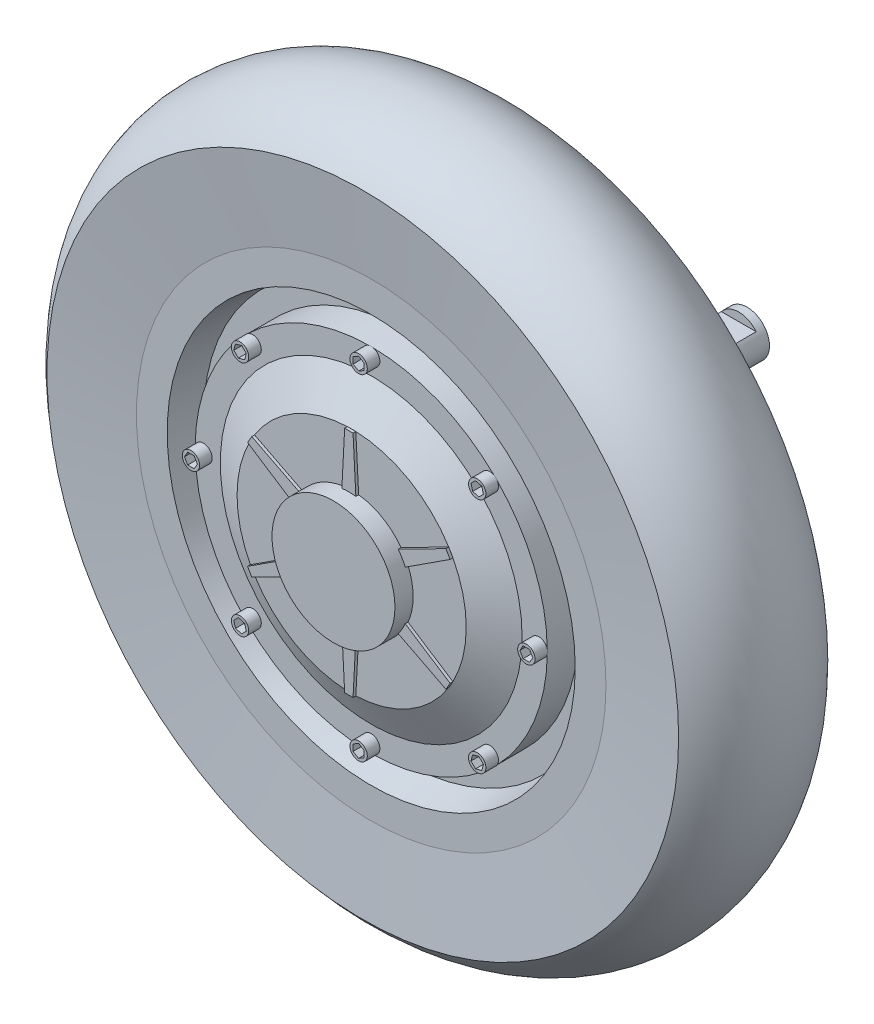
ISO-10303-21;
HEADER;
FILE_DESCRIPTION(('STEP AP214'),'2;1');
FILE_NAME('part.step','',(''),(''),'','','');
FILE_SCHEMA(('AUTOMOTIVE_DESIGN { 1 0 10303 214 1 1 1 1 }'));
ENDSEC;
DATA;
#1=APPLICATION_CONTEXT('core data for automotive mechanical design processes');
#2=APPLICATION_PROTOCOL_DEFINITION('international standard','automotive_design',2000,#1);
#3=PRODUCT_CONTEXT('',#1,'mechanical');
#4=PRODUCT('Part','Part','',(#3));
#5=PRODUCT_RELATED_PRODUCT_CATEGORY('part','',(#4));
#6=PRODUCT_DEFINITION_FORMATION('','',#4);
#7=PRODUCT_DEFINITION_CONTEXT('part definition',#1,'design');
#8=PRODUCT_DEFINITION('design','',#6,#7);
#9=PRODUCT_DEFINITION_SHAPE('','',#8);
#10=(LENGTH_UNIT() NAMED_UNIT(*) SI_UNIT(.MILLI.,.METRE.));
#11=(NAMED_UNIT(*) PLANE_ANGLE_UNIT() SI_UNIT($,.RADIAN.));
#12=(NAMED_UNIT(*) SI_UNIT($,.STERADIAN.) SOLID_ANGLE_UNIT());
#13=UNCERTAINTY_MEASURE_WITH_UNIT(LENGTH_MEASURE(1.E-05),#10,'distance_accuracy_value','');
#14=(GEOMETRIC_REPRESENTATION_CONTEXT(3) GLOBAL_UNCERTAINTY_ASSIGNED_CONTEXT((#13)) GLOBAL_UNIT_ASSIGNED_CONTEXT((#10,
#11,#12)) REPRESENTATION_CONTEXT('',''));
#15=CARTESIAN_POINT('',(0.,0.,0.));
#16=DIRECTION('',(0.,0.,1.));
#17=DIRECTION('',(1.,0.,0.));
#18=AXIS2_PLACEMENT_3D('',#15,#16,#17);
#19=CARTESIAN_POINT('',(0.,41.,-7.00000000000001));
#20=DIRECTION('',(0.,0.,1.));
#21=DIRECTION('',(1.,0.,0.));
#22=AXIS2_PLACEMENT_3D('',#19,#20,#21);
#23=PLANE('',#22);
#24=CARTESIAN_POINT('',(0.,0.,-7.00000000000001));
#25=DIRECTION('',(0.,0.,1.));
#26=DIRECTION('',(1.,0.,0.));
#27=AXIS2_PLACEMENT_3D('',#24,#25,#26);
#28=CIRCLE('',#27,41.);
#29=CARTESIAN_POINT('',(34.733270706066,21.7853139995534,-7.00000000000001));
#30=VERTEX_POINT('',#29);
#31=CARTESIAN_POINT('',(1.5,40.9725517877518,-7.00000000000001));
#32=VERTEX_POINT('',#31);
#33=EDGE_CURVE('E1462',#30,#32,#28,.T.);
#34=ORIENTED_EDGE('',*,*,#33,.F.);
#35=DIRECTION('',(-0.89096441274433,-0.454073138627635,0.));
#36=VECTOR('',#35,1.);
#37=CARTESIAN_POINT('',(34.8275131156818,21.8333439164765,-7.00000000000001));
#38=LINE('',#37,#36);
#39=CARTESIAN_POINT('',(17.6791441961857,13.0938100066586,-7.00000000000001));
#40=VERTEX_POINT('',#39);
#41=EDGE_CURVE('E1126',#30,#40,#38,.T.);
#42=ORIENTED_EDGE('',*,*,#41,.T.);
#43=CARTESIAN_POINT('',(0.,0.,-7.00000000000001));
#44=DIRECTION('',(0.,0.,1.));
#45=DIRECTION('',(1.,0.,0.));
#46=AXIS2_PLACEMENT_3D('',#43,#44,#45);
#47=CIRCLE('',#46,22.);
#48=CARTESIAN_POINT('',(2.50000000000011,21.8574929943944,-7.00000000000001));
#49=VERTEX_POINT('',#48);
#50=EDGE_CURVE('E1458',#40,#49,#47,.T.);
#51=ORIENTED_EDGE('',*,*,#50,.T.);
#52=DIRECTION('',(-0.0522433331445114,0.998634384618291,0.));
#53=VECTOR('',#52,1.);
#54=CARTESIAN_POINT('',(1.49447392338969,41.0781830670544,-7.00000000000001));
#55=LINE('',#54,#53);
#56=EDGE_CURVE('E1409',#49,#32,#55,.T.);
#57=ORIENTED_EDGE('',*,*,#56,.T.);
#58=EDGE_LOOP('',(#34,#42,#51,#57));
#59=FACE_BOUND('',#58,.T.);
#60=ADVANCED_FACE('F36',(#59),#23,.F.);
#61=CARTESIAN_POINT('',(20.1791441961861,-8.7636829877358,-7.00000000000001));
#62=VERTEX_POINT('',#61);
#63=CARTESIAN_POINT('',(20.1791441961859,8.76368298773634,-7.00000000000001));
#64=VERTEX_POINT('',#63);
#65=EDGE_CURVE('E1623',#62,#64,#47,.T.);
#66=ORIENTED_EDGE('',*,*,#65,.T.);
#67=DIRECTION('',(0.838721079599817,0.544561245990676,0.));
#68=VECTOR('',#67,1.);
#69=CARTESIAN_POINT('',(36.3219870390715,19.2448391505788,-7.00000000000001));
#70=LINE('',#69,#68);
#71=CARTESIAN_POINT('',(36.2332707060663,19.1872377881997,-7.00000000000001));
#72=VERTEX_POINT('',#71);
#73=EDGE_CURVE('E1112',#64,#72,#70,.T.);
#74=ORIENTED_EDGE('',*,*,#73,.T.);
#75=CARTESIAN_POINT('',(36.233270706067,-19.1872377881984,-7.00000000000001));
#76=VERTEX_POINT('',#75);
#77=EDGE_CURVE('E1612',#76,#72,#28,.T.);
#78=ORIENTED_EDGE('',*,*,#77,.F.);
#79=DIRECTION('',(-0.838721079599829,0.544561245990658,0.));
#80=VECTOR('',#79,1.);
#81=CARTESIAN_POINT('',(36.3219870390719,-19.244839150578,-7.00000000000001));
#82=LINE('',#81,#80);
#83=EDGE_CURVE('E1156',#76,#62,#82,.T.);
#84=ORIENTED_EDGE('',*,*,#83,.T.);
#85=EDGE_LOOP('',(#66,#74,#78,#84));
#86=FACE_BOUND('',#85,.T.);
#87=ADVANCED_FACE('F1662',(#86),#23,.F.);
#88=EDGE_CURVE('E1615',#72,#30,#28,.T.);
#89=ORIENTED_EDGE('',*,*,#88,.F.);
#90=DIRECTION('',(-0.50000000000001,0.866025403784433,0.));
#91=VECTOR('',#90,1.);
#92=CARTESIAN_POINT('',(35.4832707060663,20.4862758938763,-7.00000000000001));
#93=LINE('',#92,#91);
#94=EDGE_CURVE('E1098',#72,#30,#93,.T.);
#95=ORIENTED_EDGE('',*,*,#94,.T.);
#96=EDGE_LOOP('',(#89,#95));
#97=FACE_BOUND('',#96,.T.);
#98=ADVANCED_FACE('F1619',(#97),#23,.F.);
#99=CARTESIAN_POINT('',(2.50000000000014,-21.8574929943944,-7.00000000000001));
#100=VERTEX_POINT('',#99);
#101=CARTESIAN_POINT('',(17.6791441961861,-13.0938100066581,-7.00000000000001));
#102=VERTEX_POINT('',#101);
#103=EDGE_CURVE('E1625',#100,#102,#47,.T.);
#104=ORIENTED_EDGE('',*,*,#103,.T.);
#105=DIRECTION('',(0.890964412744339,-0.454073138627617,0.));
#106=VECTOR('',#105,1.);
#107=CARTESIAN_POINT('',(34.8275131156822,-21.8333439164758,-7.00000000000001));
#108=LINE('',#107,#106);
#109=CARTESIAN_POINT('',(34.7332707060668,-21.7853139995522,-7.00000000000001));
#110=VERTEX_POINT('',#109);
#111=EDGE_CURVE('E1142',#102,#110,#108,.T.);
#112=ORIENTED_EDGE('',*,*,#111,.T.);
#113=CARTESIAN_POINT('',(1.50000000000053,-40.9725517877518,-7.00000000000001));
#114=VERTEX_POINT('',#113);
#115=EDGE_CURVE('E1606',#114,#110,#28,.T.);
#116=ORIENTED_EDGE('',*,*,#115,.F.);
#117=DIRECTION('',(0.0522433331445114,0.998634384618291,0.));
#118=VECTOR('',#117,1.);
#119=CARTESIAN_POINT('',(1.49447392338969,-41.0781830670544,-7.00000000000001));
#120=LINE('',#119,#118);
#121=EDGE_CURVE('E1186',#114,#100,#120,.T.);
#122=ORIENTED_EDGE('',*,*,#121,.T.);
#123=EDGE_LOOP('',(#104,#112,#116,#122));
#124=FACE_BOUND('',#123,.T.);
#125=ADVANCED_FACE('F1656',(#124),#23,.F.);
#126=EDGE_CURVE('E1609',#110,#76,#28,.T.);
#127=ORIENTED_EDGE('',*,*,#126,.F.);
#128=DIRECTION('',(0.499999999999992,0.866025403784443,0.));
#129=VECTOR('',#128,1.);
#130=CARTESIAN_POINT('',(35.4832707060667,-20.4862758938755,-7.00000000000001));
#131=LINE('',#130,#129);
#132=EDGE_CURVE('E1131',#110,#76,#131,.T.);
#133=ORIENTED_EDGE('',*,*,#132,.T.);
#134=EDGE_LOOP('',(#127,#133));
#135=FACE_BOUND('',#134,.T.);
#136=ADVANCED_FACE('F1660',(#135),#23,.F.);
#137=CARTESIAN_POINT('',(-17.6791441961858,-13.0938100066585,-7.00000000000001));
#138=VERTEX_POINT('',#137);
#139=CARTESIAN_POINT('',(-2.5,-21.8574929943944,-7.00000000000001));
#140=VERTEX_POINT('',#139);
#141=EDGE_CURVE('E1629',#138,#140,#47,.T.);
#142=ORIENTED_EDGE('',*,*,#141,.T.);
#143=DIRECTION('',(0.0522433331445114,-0.998634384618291,0.));
#144=VECTOR('',#143,1.);
#145=CARTESIAN_POINT('',(-1.49447392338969,-41.0781830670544,-7.00000000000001));
#146=LINE('',#145,#144);
#147=CARTESIAN_POINT('',(-1.5,-40.9725517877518,-7.00000000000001));
#148=VERTEX_POINT('',#147);
#149=EDGE_CURVE('E1172',#140,#148,#146,.T.);
#150=ORIENTED_EDGE('',*,*,#149,.T.);
#151=CARTESIAN_POINT('',(-34.7332707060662,-21.7853139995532,-7.00000000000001));
#152=VERTEX_POINT('',#151);
#153=EDGE_CURVE('E1601',#152,#148,#28,.T.);
#154=ORIENTED_EDGE('',*,*,#153,.F.);
#155=DIRECTION('',(0.890964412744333,0.454073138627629,0.));
#156=VECTOR('',#155,1.);
#157=CARTESIAN_POINT('',(-34.8275131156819,-21.8333439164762,-7.00000000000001));
#158=LINE('',#157,#156);
#159=EDGE_CURVE('E1216',#152,#138,#158,.T.);
#160=ORIENTED_EDGE('',*,*,#159,.T.);
#161=EDGE_LOOP('',(#142,#150,#154,#160));
#162=FACE_BOUND('',#161,.T.);
#163=ADVANCED_FACE('F1651',(#162),#23,.F.);
#164=EDGE_CURVE('E1603',#148,#114,#28,.T.);
#165=ORIENTED_EDGE('',*,*,#164,.F.);
#166=DIRECTION('',(1.,0.,0.));
#167=VECTOR('',#166,1.);
#168=CARTESIAN_POINT('',(0.,-40.9725517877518,-7.00000000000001));
#169=LINE('',#168,#167);
#170=EDGE_CURVE('E1161',#148,#114,#169,.T.);
#171=ORIENTED_EDGE('',*,*,#170,.T.);
#172=EDGE_LOOP('',(#165,#171));
#173=FACE_BOUND('',#172,.T.);
#174=ADVANCED_FACE('F1654',(#173),#23,.F.);
#175=CARTESIAN_POINT('',(-20.179144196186,8.76368298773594,-7.00000000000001));
#176=VERTEX_POINT('',#175);
#177=CARTESIAN_POINT('',(-20.1791441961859,-8.7636829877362,-7.00000000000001));
#178=VERTEX_POINT('',#177);
#179=EDGE_CURVE('E1463',#176,#178,#47,.T.);
#180=ORIENTED_EDGE('',*,*,#179,.T.);
#181=DIRECTION('',(-0.838721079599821,-0.54456124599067,0.));
#182=VECTOR('',#181,1.);
#183=CARTESIAN_POINT('',(-36.3219870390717,-19.2448391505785,-7.00000000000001));
#184=LINE('',#183,#182);
#185=CARTESIAN_POINT('',(-36.2332707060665,-19.1872377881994,-7.00000000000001));
#186=VERTEX_POINT('',#185);
#187=EDGE_CURVE('E1202',#178,#186,#184,.T.);
#188=ORIENTED_EDGE('',*,*,#187,.T.);
#189=CARTESIAN_POINT('',(-36.2332707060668,19.1872377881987,-7.00000000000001));
#190=VERTEX_POINT('',#189);
#191=EDGE_CURVE('E1596',#190,#186,#28,.T.);
#192=ORIENTED_EDGE('',*,*,#191,.F.);
#193=DIRECTION('',(0.838721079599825,-0.544561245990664,0.));
#194=VECTOR('',#193,1.);
#195=CARTESIAN_POINT('',(-36.3219870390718,19.2448391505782,-7.00000000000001));
#196=LINE('',#195,#194);
#197=EDGE_CURVE('E1246',#190,#176,#196,.T.);
#198=ORIENTED_EDGE('',*,*,#197,.T.);
#199=EDGE_LOOP('',(#180,#188,#192,#198));
#200=FACE_BOUND('',#199,.T.);
#201=ADVANCED_FACE('F1597',(#200),#23,.F.);
#202=EDGE_CURVE('E1600',#186,#152,#28,.T.);
#203=ORIENTED_EDGE('',*,*,#202,.F.);
#204=DIRECTION('',(0.500000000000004,-0.866025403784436,0.));
#205=VECTOR('',#204,1.);
#206=CARTESIAN_POINT('',(-35.4832707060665,-20.486275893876,-7.00000000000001));
#207=LINE('',#206,#205);
#208=EDGE_CURVE('E1191',#186,#152,#207,.T.);
#209=ORIENTED_EDGE('',*,*,#208,.T.);
#210=EDGE_LOOP('',(#203,#209));
#211=FACE_BOUND('',#210,.T.);
#212=ADVANCED_FACE('F1650',(#211),#23,.F.);
#213=CARTESIAN_POINT('',(-2.50000000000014,21.8574929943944,-7.00000000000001));
#214=VERTEX_POINT('',#213);
#215=CARTESIAN_POINT('',(-17.679144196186,13.0938100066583,-7.00000000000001));
#216=VERTEX_POINT('',#215);
#217=EDGE_CURVE('E1459',#214,#216,#47,.T.);
#218=ORIENTED_EDGE('',*,*,#217,.T.);
#219=DIRECTION('',(-0.890964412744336,0.454073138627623,0.));
#220=VECTOR('',#219,1.);
#221=CARTESIAN_POINT('',(-34.8275131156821,21.833343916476,-7.00000000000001));
#222=LINE('',#221,#220);
#223=CARTESIAN_POINT('',(-34.7332707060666,21.7853139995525,-7.00000000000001));
#224=VERTEX_POINT('',#223);
#225=EDGE_CURVE('E1232',#216,#224,#222,.T.);
#226=ORIENTED_EDGE('',*,*,#225,.T.);
#227=CARTESIAN_POINT('',(-1.50000000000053,40.9725517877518,-7.00000000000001));
#228=VERTEX_POINT('',#227);
#229=EDGE_CURVE('E1468',#228,#224,#28,.T.);
#230=ORIENTED_EDGE('',*,*,#229,.F.);
#231=DIRECTION('',(-0.0522433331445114,-0.998634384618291,0.));
#232=VECTOR('',#231,1.);
#233=CARTESIAN_POINT('',(-1.49447392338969,41.0781830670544,-7.00000000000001));
#234=LINE('',#233,#232);
#235=EDGE_CURVE('E1429',#228,#214,#234,.T.);
#236=ORIENTED_EDGE('',*,*,#235,.T.);
#237=EDGE_LOOP('',(#218,#226,#230,#236));
#238=FACE_BOUND('',#237,.T.);
#239=ADVANCED_FACE('F1547',(#238),#23,.F.);
#240=CARTESIAN_POINT('',(0.,41.,54.));
#241=DIRECTION('',(0.,0.,-1.));
#242=DIRECTION('',(-1.,0.,0.));
#243=AXIS2_PLACEMENT_3D('',#240,#241,#242);
#244=PLANE('',#243);
#245=CARTESIAN_POINT('',(0.,0.,54.));
#246=DIRECTION('',(0.,0.,1.));
#247=DIRECTION('',(1.,0.,0.));
#248=AXIS2_PLACEMENT_3D('',#245,#246,#247);
#249=CIRCLE('',#248,22.);
#250=CARTESIAN_POINT('',(17.6791441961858,13.0938100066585,54.));
#251=VERTEX_POINT('',#250);
#252=CARTESIAN_POINT('',(2.49999999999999,21.8574929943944,54.));
#253=VERTEX_POINT('',#252);
#254=EDGE_CURVE('E1516',#251,#253,#249,.T.);
#255=ORIENTED_EDGE('',*,*,#254,.F.);
#256=DIRECTION('',(0.89096441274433,0.454073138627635,0.));
#257=VECTOR('',#256,1.);
#258=CARTESIAN_POINT('',(34.8275131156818,21.8333439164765,54.));
#259=LINE('',#258,#257);
#260=CARTESIAN_POINT('',(34.7332707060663,21.7853139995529,54.));
#261=VERTEX_POINT('',#260);
#262=EDGE_CURVE('E1274',#251,#261,#259,.T.);
#263=ORIENTED_EDGE('',*,*,#262,.T.);
#264=CARTESIAN_POINT('',(0.,0.,54.));
#265=DIRECTION('',(0.,0.,1.));
#266=DIRECTION('',(1.,0.,0.));
#267=AXIS2_PLACEMENT_3D('',#264,#265,#266);
#268=CIRCLE('',#267,41.);
#269=CARTESIAN_POINT('',(1.5,40.9725517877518,54.));
#270=VERTEX_POINT('',#269);
#271=EDGE_CURVE('E1512',#261,#270,#268,.T.);
#272=ORIENTED_EDGE('',*,*,#271,.T.);
#273=DIRECTION('',(0.0522433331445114,-0.998634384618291,0.));
#274=VECTOR('',#273,1.);
#275=CARTESIAN_POINT('',(1.49447392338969,41.0781830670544,54.));
#276=LINE('',#275,#274);
#277=EDGE_CURVE('E1426',#270,#253,#276,.T.);
#278=ORIENTED_EDGE('',*,*,#277,.T.);
#279=EDGE_LOOP('',(#255,#263,#272,#278));
#280=FACE_BOUND('',#279,.T.);
#281=ADVANCED_FACE('F1716',(#280),#244,.F.);
#282=CARTESIAN_POINT('',(36.2332707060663,19.1872377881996,54.));
#283=VERTEX_POINT('',#282);
#284=EDGE_CURVE('E3584',#283,#261,#268,.T.);
#285=ORIENTED_EDGE('',*,*,#284,.T.);
#286=DIRECTION('',(0.50000000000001,-0.866025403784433,0.));
#287=VECTOR('',#286,1.);
#288=CARTESIAN_POINT('',(35.4832707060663,20.4862758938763,54.));
#289=LINE('',#288,#287);
#290=EDGE_CURVE('E1269',#261,#283,#289,.T.);
#291=ORIENTED_EDGE('',*,*,#290,.T.);
#292=EDGE_LOOP('',(#285,#291));
#293=FACE_BOUND('',#292,.T.);
#294=ADVANCED_FACE('F1721',(#293),#244,.F.);
#295=CARTESIAN_POINT('',(36.2332707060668,-19.1872377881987,54.));
#296=VERTEX_POINT('',#295);
#297=EDGE_CURVE('E3578',#296,#283,#268,.T.);
#298=ORIENTED_EDGE('',*,*,#297,.T.);
#299=DIRECTION('',(-0.838721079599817,-0.544561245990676,0.));
#300=VECTOR('',#299,1.);
#301=CARTESIAN_POINT('',(36.3219870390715,19.2448391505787,54.));
#302=LINE('',#301,#300);
#303=CARTESIAN_POINT('',(20.1791441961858,8.76368298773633,54.));
#304=VERTEX_POINT('',#303);
#305=EDGE_CURVE('E1262',#283,#304,#302,.T.);
#306=ORIENTED_EDGE('',*,*,#305,.T.);
#307=CARTESIAN_POINT('',(20.179144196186,-8.76368298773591,54.));
#308=VERTEX_POINT('',#307);
#309=EDGE_CURVE('E3525',#308,#304,#249,.T.);
#310=ORIENTED_EDGE('',*,*,#309,.F.);
#311=DIRECTION('',(0.838721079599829,-0.544561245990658,0.));
#312=VECTOR('',#311,1.);
#313=CARTESIAN_POINT('',(36.3219870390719,-19.244839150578,54.));
#314=LINE('',#313,#312);
#315=EDGE_CURVE('E1302',#308,#296,#314,.T.);
#316=ORIENTED_EDGE('',*,*,#315,.T.);
#317=EDGE_LOOP('',(#298,#306,#310,#316));
#318=FACE_BOUND('',#317,.T.);
#319=ADVANCED_FACE('F3575',(#318),#244,.F.);
#320=CARTESIAN_POINT('',(34.7332707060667,-21.7853139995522,54.));
#321=VERTEX_POINT('',#320);
#322=EDGE_CURVE('E3588',#321,#296,#268,.T.);
#323=ORIENTED_EDGE('',*,*,#322,.T.);
#324=DIRECTION('',(-0.499999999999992,-0.866025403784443,0.));
#325=VECTOR('',#324,1.);
#326=CARTESIAN_POINT('',(35.4832707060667,-20.4862758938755,54.));
#327=LINE('',#326,#325);
#328=EDGE_CURVE('E1297',#296,#321,#327,.T.);
#329=ORIENTED_EDGE('',*,*,#328,.T.);
#330=EDGE_LOOP('',(#323,#329));
#331=FACE_BOUND('',#330,.T.);
#332=ADVANCED_FACE('F3613',(#331),#244,.F.);
#333=CARTESIAN_POINT('',(1.49999999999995,-40.9725517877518,54.));
#334=VERTEX_POINT('',#333);
#335=EDGE_CURVE('E3566',#334,#321,#268,.T.);
#336=ORIENTED_EDGE('',*,*,#335,.T.);
#337=DIRECTION('',(-0.890964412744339,0.454073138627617,0.));
#338=VECTOR('',#337,1.);
#339=CARTESIAN_POINT('',(34.8275131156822,-21.8333439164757,54.));
#340=LINE('',#339,#338);
#341=CARTESIAN_POINT('',(17.6791441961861,-13.0938100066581,54.));
#342=VERTEX_POINT('',#341);
#343=EDGE_CURVE('E1290',#321,#342,#340,.T.);
#344=ORIENTED_EDGE('',*,*,#343,.T.);
#345=CARTESIAN_POINT('',(2.5,-21.8574929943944,54.));
#346=VERTEX_POINT('',#345);
#347=EDGE_CURVE('E3527',#346,#342,#249,.T.);
#348=ORIENTED_EDGE('',*,*,#347,.F.);
#349=DIRECTION('',(-0.0522433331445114,-0.998634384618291,0.));
#350=VECTOR('',#349,1.);
#351=CARTESIAN_POINT('',(1.49447392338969,-41.0781830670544,54.));
#352=LINE('',#351,#350);
#353=EDGE_CURVE('E1330',#346,#334,#352,.T.);
#354=ORIENTED_EDGE('',*,*,#353,.T.);
#355=EDGE_LOOP('',(#336,#344,#348,#354));
#356=FACE_BOUND('',#355,.T.);
#357=ADVANCED_FACE('F3563',(#356),#244,.F.);
#358=CARTESIAN_POINT('',(-1.5,-40.9725517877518,54.));
#359=VERTEX_POINT('',#358);
#360=EDGE_CURVE('E3608',#359,#334,#268,.T.);
#361=ORIENTED_EDGE('',*,*,#360,.T.);
#362=DIRECTION('',(-1.,0.,0.));
#363=VECTOR('',#362,1.);
#364=CARTESIAN_POINT('',(0.,-40.9725517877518,54.));
#365=LINE('',#364,#363);
#366=EDGE_CURVE('E1325',#334,#359,#365,.T.);
#367=ORIENTED_EDGE('',*,*,#366,.T.);
#368=EDGE_LOOP('',(#361,#367));
#369=FACE_BOUND('',#368,.T.);
#370=ADVANCED_FACE('F3619',(#369),#244,.F.);
#371=CARTESIAN_POINT('',(-34.7332707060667,-21.7853139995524,54.));
#372=VERTEX_POINT('',#371);
#373=EDGE_CURVE('E3554',#372,#359,#268,.T.);
#374=ORIENTED_EDGE('',*,*,#373,.T.);
#375=DIRECTION('',(-0.0522433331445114,0.998634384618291,0.));
#376=VECTOR('',#375,1.);
#377=CARTESIAN_POINT('',(-1.49447392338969,-41.0781830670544,54.));
#378=LINE('',#377,#376);
#379=CARTESIAN_POINT('',(-2.5,-21.8574929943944,54.));
#380=VERTEX_POINT('',#379);
#381=EDGE_CURVE('E1318',#359,#380,#378,.T.);
#382=ORIENTED_EDGE('',*,*,#381,.T.);
#383=CARTESIAN_POINT('',(-17.6791441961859,-13.0938100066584,54.));
#384=VERTEX_POINT('',#383);
#385=EDGE_CURVE('E3531',#384,#380,#249,.T.);
#386=ORIENTED_EDGE('',*,*,#385,.F.);
#387=DIRECTION('',(-0.890964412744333,-0.454073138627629,0.));
#388=VECTOR('',#387,1.);
#389=CARTESIAN_POINT('',(-34.8275131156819,-21.8333439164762,54.));
#390=LINE('',#389,#388);
#391=EDGE_CURVE('E1358',#384,#372,#390,.T.);
#392=ORIENTED_EDGE('',*,*,#391,.T.);
#393=EDGE_LOOP('',(#374,#382,#386,#392));
#394=FACE_BOUND('',#393,.T.);
#395=ADVANCED_FACE('F3551',(#394),#244,.F.);
#396=CARTESIAN_POINT('',(-36.2332707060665,-19.1872377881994,54.));
#397=VERTEX_POINT('',#396);
#398=EDGE_CURVE('E3604',#397,#372,#268,.T.);
#399=ORIENTED_EDGE('',*,*,#398,.T.);
#400=DIRECTION('',(-0.500000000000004,0.866025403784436,0.));
#401=VECTOR('',#400,1.);
#402=CARTESIAN_POINT('',(-35.4832707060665,-20.486275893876,54.));
#403=LINE('',#402,#401);
#404=EDGE_CURVE('E1353',#372,#397,#403,.T.);
#405=ORIENTED_EDGE('',*,*,#404,.T.);
#406=EDGE_LOOP('',(#399,#405));
#407=FACE_BOUND('',#406,.T.);
#408=ADVANCED_FACE('F3662',(#407),#244,.F.);
#409=CARTESIAN_POINT('',(-36.2332707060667,19.187237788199,54.));
#410=VERTEX_POINT('',#409);
#411=EDGE_CURVE('E3600',#410,#397,#268,.T.);
#412=ORIENTED_EDGE('',*,*,#411,.T.);
#413=DIRECTION('',(0.838721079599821,0.54456124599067,0.));
#414=VECTOR('',#413,1.);
#415=CARTESIAN_POINT('',(-36.3219870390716,-19.2448391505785,54.));
#416=LINE('',#415,#414);
#417=CARTESIAN_POINT('',(-20.1791441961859,-8.76368298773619,54.));
#418=VERTEX_POINT('',#417);
#419=EDGE_CURVE('E1346',#397,#418,#416,.T.);
#420=ORIENTED_EDGE('',*,*,#419,.T.);
#421=CARTESIAN_POINT('',(-20.179144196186,8.76368298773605,54.));
#422=VERTEX_POINT('',#421);
#423=EDGE_CURVE('E1522',#422,#418,#249,.T.);
#424=ORIENTED_EDGE('',*,*,#423,.F.);
#425=DIRECTION('',(-0.838721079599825,0.544561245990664,0.));
#426=VECTOR('',#425,1.);
#427=CARTESIAN_POINT('',(-36.3219870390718,19.2448391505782,54.));
#428=LINE('',#427,#426);
#429=EDGE_CURVE('E1386',#422,#410,#428,.T.);
#430=ORIENTED_EDGE('',*,*,#429,.T.);
#431=EDGE_LOOP('',(#412,#420,#424,#430));
#432=FACE_BOUND('',#431,.T.);
#433=ADVANCED_FACE('F3670',(#432),#244,.F.);
#434=CARTESIAN_POINT('',(-34.7332707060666,21.7853139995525,54.));
#435=VERTEX_POINT('',#434);
#436=EDGE_CURVE('E3598',#435,#410,#268,.T.);
#437=ORIENTED_EDGE('',*,*,#436,.T.);
#438=DIRECTION('',(0.499999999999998,0.86602540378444,0.));
#439=VECTOR('',#438,1.);
#440=CARTESIAN_POINT('',(-35.4832707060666,20.4862758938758,54.));
#441=LINE('',#440,#439);
#442=EDGE_CURVE('E1381',#410,#435,#441,.T.);
#443=ORIENTED_EDGE('',*,*,#442,.T.);
#444=EDGE_LOOP('',(#437,#443));
#445=FACE_BOUND('',#444,.T.);
#446=ADVANCED_FACE('F1711',(#445),#244,.F.);
#447=CARTESIAN_POINT('',(-1.5,40.9725517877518,54.));
#448=VERTEX_POINT('',#447);
#449=EDGE_CURVE('E1517',#448,#435,#268,.T.);
#450=ORIENTED_EDGE('',*,*,#449,.T.);
#451=DIRECTION('',(0.890964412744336,-0.454073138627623,0.));
#452=VECTOR('',#451,1.);
#453=CARTESIAN_POINT('',(-34.8275131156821,21.833343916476,54.));
#454=LINE('',#453,#452);
#455=CARTESIAN_POINT('',(-17.679144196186,13.0938100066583,54.));
#456=VERTEX_POINT('',#455);
#457=EDGE_CURVE('E1374',#435,#456,#454,.T.);
#458=ORIENTED_EDGE('',*,*,#457,.T.);
#459=CARTESIAN_POINT('',(-2.5,21.8574929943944,54.));
#460=VERTEX_POINT('',#459);
#461=EDGE_CURVE('E1518',#460,#456,#249,.T.);
#462=ORIENTED_EDGE('',*,*,#461,.F.);
#463=DIRECTION('',(0.0522433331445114,0.998634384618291,0.));
#464=VECTOR('',#463,1.);
#465=CARTESIAN_POINT('',(-1.49447392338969,41.0781830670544,54.));
#466=LINE('',#465,#464);
#467=EDGE_CURVE('E1431',#460,#448,#466,.T.);
#468=ORIENTED_EDGE('',*,*,#467,.T.);
#469=EDGE_LOOP('',(#450,#458,#462,#468));
#470=FACE_BOUND('',#469,.T.);
#471=ADVANCED_FACE('F1704',(#470),#244,.F.);
#472=EDGE_CURVE('E1553',#224,#190,#28,.T.);
#473=ORIENTED_EDGE('',*,*,#472,.F.);
#474=DIRECTION('',(-0.499999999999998,-0.86602540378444,0.));
#475=VECTOR('',#474,1.);
#476=CARTESIAN_POINT('',(-35.4832707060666,20.4862758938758,-7.00000000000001));
#477=LINE('',#476,#475);
#478=EDGE_CURVE('E1221',#224,#190,#477,.T.);
#479=ORIENTED_EDGE('',*,*,#478,.T.);
#480=EDGE_LOOP('',(#473,#479));
#481=FACE_BOUND('',#480,.T.);
#482=ADVANCED_FACE('F1594',(#481),#23,.F.);
#483=CARTESIAN_POINT('',(0.,22.,60.5));
#484=DIRECTION('',(0.,0.,-1.));
#485=DIRECTION('',(-1.,0.,0.));
#486=AXIS2_PLACEMENT_3D('',#483,#484,#485);
#487=PLANE('',#486);
#488=CARTESIAN_POINT('',(0.,0.,60.5));
#489=DIRECTION('',(0.,0.,1.));
#490=DIRECTION('',(1.,0.,0.));
#491=AXIS2_PLACEMENT_3D('',#488,#489,#490);
#492=CIRCLE('',#491,22.);
#493=CARTESIAN_POINT('',(22.,0.,60.5));
#494=VERTEX_POINT('',#493);
#495=EDGE_CURVE('E1521',#494,#494,#492,.T.);
#496=ORIENTED_EDGE('',*,*,#495,.T.);
#497=EDGE_LOOP('',(#496));
#498=FACE_BOUND('',#497,.T.);
#499=ADVANCED_FACE('F1703',(#498),#487,.F.);
#500=CARTESIAN_POINT('',(0.,0.,0.));
#501=DIRECTION('',(0.,0.,1.));
#502=DIRECTION('',(1.,0.,0.));
#503=AXIS2_PLACEMENT_3D('',#500,#501,#502);
#504=CYLINDRICAL_SURFACE('',#503,22.);
#505=CARTESIAN_POINT('',(0.,0.,55.));
#506=DIRECTION('',(0.,0.,-1.));
#507=DIRECTION('',(-0.50000000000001,0.866025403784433,0.));
#508=AXIS2_PLACEMENT_3D('',#505,#506,#507);
#509=CIRCLE('',#508,22.);
#510=CARTESIAN_POINT('',(17.6791441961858,13.0938100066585,55.));
#511=VERTEX_POINT('',#510);
#512=CARTESIAN_POINT('',(20.1791441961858,8.76368298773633,55.));
#513=VERTEX_POINT('',#512);
#514=EDGE_CURVE('E1251',#511,#513,#509,.T.);
#515=ORIENTED_EDGE('',*,*,#514,.F.);
#516=DIRECTION('',(0.,0.,1.));
#517=VECTOR('',#516,1.);
#518=CARTESIAN_POINT('',(17.6791441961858,13.0938100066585,-28.7581748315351));
#519=LINE('',#518,#517);
#520=EDGE_CURVE('E1276',#251,#511,#519,.T.);
#521=ORIENTED_EDGE('',*,*,#520,.F.);
#522=ORIENTED_EDGE('',*,*,#254,.T.);
#523=DIRECTION('',(0.,0.,1.));
#524=VECTOR('',#523,1.);
#525=CARTESIAN_POINT('',(2.5,21.8574929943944,-28.7581748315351));
#526=LINE('',#525,#524);
#527=CARTESIAN_POINT('',(2.5,21.8574929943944,55.));
#528=VERTEX_POINT('',#527);
#529=EDGE_CURVE('E1420',#253,#528,#526,.T.);
#530=ORIENTED_EDGE('',*,*,#529,.T.);
#531=CARTESIAN_POINT('',(0.,0.,55.));
#532=DIRECTION('',(0.,0.,-1.));
#533=DIRECTION('',(-1.,0.,0.));
#534=AXIS2_PLACEMENT_3D('',#531,#532,#533);
#535=CIRCLE('',#534,22.);
#536=CARTESIAN_POINT('',(-2.5,21.8574929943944,55.));
#537=VERTEX_POINT('',#536);
#538=EDGE_CURVE('E12',#537,#528,#535,.T.);
#539=ORIENTED_EDGE('',*,*,#538,.F.);
#540=DIRECTION('',(0.,0.,1.));
#541=VECTOR('',#540,1.);
#542=CARTESIAN_POINT('',(-2.5,21.8574929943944,-28.7581748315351));
#543=LINE('',#542,#541);
#544=EDGE_CURVE('E1400',#460,#537,#543,.T.);
#545=ORIENTED_EDGE('',*,*,#544,.F.);
#546=ORIENTED_EDGE('',*,*,#461,.T.);
#547=DIRECTION('',(0.,0.,1.));
#548=VECTOR('',#547,1.);
#549=CARTESIAN_POINT('',(-17.679144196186,13.0938100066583,-28.7581748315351));
#550=LINE('',#549,#548);
#551=CARTESIAN_POINT('',(-17.679144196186,13.0938100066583,55.));
#552=VERTEX_POINT('',#551);
#553=EDGE_CURVE('E1379',#456,#552,#550,.T.);
#554=ORIENTED_EDGE('',*,*,#553,.T.);
#555=CARTESIAN_POINT('',(0.,0.,55.));
#556=DIRECTION('',(0.,0.,-1.));
#557=DIRECTION('',(-0.499999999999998,-0.86602540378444,0.));
#558=AXIS2_PLACEMENT_3D('',#555,#556,#557);
#559=CIRCLE('',#558,22.);
#560=CARTESIAN_POINT('',(-20.179144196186,8.76368298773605,55.));
#561=VERTEX_POINT('',#560);
#562=EDGE_CURVE('E1363',#561,#552,#559,.T.);
#563=ORIENTED_EDGE('',*,*,#562,.F.);
#564=DIRECTION('',(0.,0.,1.));
#565=VECTOR('',#564,1.);
#566=CARTESIAN_POINT('',(-20.179144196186,8.76368298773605,-28.7581748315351));
#567=LINE('',#566,#565);
#568=EDGE_CURVE('E1388',#422,#561,#567,.T.);
#569=ORIENTED_EDGE('',*,*,#568,.F.);
#570=ORIENTED_EDGE('',*,*,#423,.T.);
#571=DIRECTION('',(0.,0.,1.));
#572=VECTOR('',#571,1.);
#573=CARTESIAN_POINT('',(-20.1791441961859,-8.7636829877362,-28.7581748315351));
#574=LINE('',#573,#572);
#575=CARTESIAN_POINT('',(-20.1791441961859,-8.7636829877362,55.));
#576=VERTEX_POINT('',#575);
#577=EDGE_CURVE('E1351',#418,#576,#574,.T.);
#578=ORIENTED_EDGE('',*,*,#577,.T.);
#579=CARTESIAN_POINT('',(0.,0.,55.));
#580=DIRECTION('',(0.,0.,-1.));
#581=DIRECTION('',(0.500000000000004,-0.866025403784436,0.));
#582=AXIS2_PLACEMENT_3D('',#579,#580,#581);
#583=CIRCLE('',#582,22.);
#584=CARTESIAN_POINT('',(-17.6791441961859,-13.0938100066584,55.));
#585=VERTEX_POINT('',#584);
#586=EDGE_CURVE('E1335',#585,#576,#583,.T.);
#587=ORIENTED_EDGE('',*,*,#586,.F.);
#588=DIRECTION('',(0.,0.,1.));
#589=VECTOR('',#588,1.);
#590=CARTESIAN_POINT('',(-17.6791441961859,-13.0938100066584,-28.7581748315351));
#591=LINE('',#590,#589);
#592=EDGE_CURVE('E1360',#384,#585,#591,.T.);
#593=ORIENTED_EDGE('',*,*,#592,.F.);
#594=ORIENTED_EDGE('',*,*,#385,.T.);
#595=DIRECTION('',(0.,0.,1.));
#596=VECTOR('',#595,1.);
#597=CARTESIAN_POINT('',(-2.5,-21.8574929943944,-28.7581748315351));
#598=LINE('',#597,#596);
#599=CARTESIAN_POINT('',(-2.5,-21.8574929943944,55.));
#600=VERTEX_POINT('',#599);
#601=EDGE_CURVE('E1323',#380,#600,#598,.T.);
#602=ORIENTED_EDGE('',*,*,#601,.T.);
#603=CARTESIAN_POINT('',(0.,0.,55.));
#604=DIRECTION('',(0.,0.,-1.));
#605=DIRECTION('',(1.,0.,0.));
#606=AXIS2_PLACEMENT_3D('',#603,#604,#605);
#607=CIRCLE('',#606,22.);
#608=CARTESIAN_POINT('',(2.5,-21.8574929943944,55.));
#609=VERTEX_POINT('',#608);
#610=EDGE_CURVE('E1307',#609,#600,#607,.T.);
#611=ORIENTED_EDGE('',*,*,#610,.F.);
#612=DIRECTION('',(0.,0.,1.));
#613=VECTOR('',#612,1.);
#614=CARTESIAN_POINT('',(2.5,-21.8574929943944,-28.7581748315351));
#615=LINE('',#614,#613);
#616=EDGE_CURVE('E1332',#346,#609,#615,.T.);
#617=ORIENTED_EDGE('',*,*,#616,.F.);
#618=ORIENTED_EDGE('',*,*,#347,.T.);
#619=DIRECTION('',(0.,0.,1.));
#620=VECTOR('',#619,1.);
#621=CARTESIAN_POINT('',(17.6791441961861,-13.0938100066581,-28.7581748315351));
#622=LINE('',#621,#620);
#623=CARTESIAN_POINT('',(17.6791441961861,-13.0938100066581,55.));
#624=VERTEX_POINT('',#623);
#625=EDGE_CURVE('E1295',#342,#624,#622,.T.);
#626=ORIENTED_EDGE('',*,*,#625,.T.);
#627=CARTESIAN_POINT('',(0.,0.,55.));
#628=DIRECTION('',(0.,0.,-1.));
#629=DIRECTION('',(0.499999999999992,0.866025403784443,0.));
#630=AXIS2_PLACEMENT_3D('',#627,#628,#629);
#631=CIRCLE('',#630,22.);
#632=CARTESIAN_POINT('',(20.179144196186,-8.76368298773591,55.));
#633=VERTEX_POINT('',#632);
#634=EDGE_CURVE('E1279',#633,#624,#631,.T.);
#635=ORIENTED_EDGE('',*,*,#634,.F.);
#636=DIRECTION('',(0.,0.,1.));
#637=VECTOR('',#636,1.);
#638=CARTESIAN_POINT('',(20.179144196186,-8.76368298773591,-28.7581748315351));
#639=LINE('',#638,#637);
#640=EDGE_CURVE('E1304',#308,#633,#639,.T.);
#641=ORIENTED_EDGE('',*,*,#640,.F.);
#642=ORIENTED_EDGE('',*,*,#309,.T.);
#643=DIRECTION('',(0.,0.,1.));
#644=VECTOR('',#643,1.);
#645=CARTESIAN_POINT('',(20.1791441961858,8.76368298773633,-28.7581748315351));
#646=LINE('',#645,#644);
#647=EDGE_CURVE('E1267',#304,#513,#646,.T.);
#648=ORIENTED_EDGE('',*,*,#647,.T.);
#649=EDGE_LOOP('',(#515,#521,#522,#530,#539,#545,#546,#554,#563,#569,#570,#578,#587,#593,#594,
#602,#611,#617,#618,#626,#635,#641,#642,#648));
#650=FACE_BOUND('',#649,.T.);
#651=ORIENTED_EDGE('',*,*,#495,.F.);
#652=EDGE_LOOP('',(#651));
#653=FACE_BOUND('',#652,.T.);
#654=ADVANCED_FACE('F1709',(#650,#653),#504,.T.);
#655=EDGE_CURVE('E1513',#270,#448,#268,.T.);
#656=ORIENTED_EDGE('',*,*,#655,.T.);
#657=DIRECTION('',(1.,0.,0.));
#658=VECTOR('',#657,1.);
#659=CARTESIAN_POINT('',(0.,40.9725517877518,54.));
#660=LINE('',#659,#658);
#661=EDGE_CURVE('E1434',#448,#270,#660,.T.);
#662=ORIENTED_EDGE('',*,*,#661,.T.);
#663=EDGE_LOOP('',(#656,#662));
#664=FACE_BOUND('',#663,.T.);
#665=ADVANCED_FACE('F1714',(#664),#244,.F.);
#666=CARTESIAN_POINT('',(0.,0.,47.));
#667=DIRECTION('',(0.,0.,-1.));
#668=DIRECTION('',(-1.,0.,0.));
#669=AXIS2_PLACEMENT_3D('',#666,#667,#668);
#670=CONICAL_SURFACE('',#669,54.,1.07685495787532);
#671=ORIENTED_EDGE('',*,*,#655,.F.);
#672=ORIENTED_EDGE('',*,*,#271,.F.);
#673=ORIENTED_EDGE('',*,*,#284,.F.);
#674=ORIENTED_EDGE('',*,*,#297,.F.);
#675=ORIENTED_EDGE('',*,*,#322,.F.);
#676=ORIENTED_EDGE('',*,*,#335,.F.);
#677=ORIENTED_EDGE('',*,*,#360,.F.);
#678=ORIENTED_EDGE('',*,*,#373,.F.);
#679=ORIENTED_EDGE('',*,*,#398,.F.);
#680=ORIENTED_EDGE('',*,*,#411,.F.);
#681=ORIENTED_EDGE('',*,*,#436,.F.);
#682=ORIENTED_EDGE('',*,*,#449,.F.);
#683=EDGE_LOOP('',(#671,#672,#673,#674,#675,#676,#677,#678,#679,#680,#681,#682));
#684=FACE_BOUND('',#683,.T.);
#685=CARTESIAN_POINT('',(0.,0.,47.));
#686=DIRECTION('',(0.,0.,1.));
#687=DIRECTION('',(1.,0.,0.));
#688=AXIS2_PLACEMENT_3D('',#685,#686,#687);
#689=CIRCLE('',#688,54.);
#690=CARTESIAN_POINT('',(54.,0.,47.));
#691=VERTEX_POINT('',#690);
#692=EDGE_CURVE('E1508',#691,#691,#689,.T.);
#693=ORIENTED_EDGE('',*,*,#692,.T.);
#694=EDGE_LOOP('',(#693));
#695=FACE_BOUND('',#694,.T.);
#696=ADVANCED_FACE('F1864',(#684,#695),#670,.T.);
#697=CARTESIAN_POINT('',(0.,63.,47.));
#698=DIRECTION('',(0.,0.,-1.));
#699=DIRECTION('',(-1.,0.,0.));
#700=AXIS2_PLACEMENT_3D('',#697,#698,#699);
#701=PLANE('',#700);
#702=CARTESIAN_POINT('',(42.4264068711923,42.4264068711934,47.));
#703=DIRECTION('',(0.,0.,1.));
#704=DIRECTION('',(0.707106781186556,-0.707106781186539,0.));
#705=AXIS2_PLACEMENT_3D('',#702,#703,#704);
#706=CIRCLE('',#705,3.1);
#707=CARTESIAN_POINT('',(43.9782378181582,45.1100276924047,47.));
#708=VERTEX_POINT('',#707);
#709=CARTESIAN_POINT('',(45.1100276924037,43.9782378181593,47.));
#710=VERTEX_POINT('',#709);
#711=EDGE_CURVE('E3301',#708,#710,#706,.T.);
#712=ORIENTED_EDGE('',*,*,#711,.F.);
#713=CARTESIAN_POINT('',(0.,0.,47.));
#714=DIRECTION('',(0.,0.,1.));
#715=DIRECTION('',(1.,0.,0.));
#716=AXIS2_PLACEMENT_3D('',#713,#714,#715);
#717=CIRCLE('',#716,63.);
#718=CARTESIAN_POINT('',(0.80029629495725,62.9949166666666,47.));
#719=VERTEX_POINT('',#718);
#720=EDGE_CURVE('E1504',#708,#719,#717,.T.);
#721=ORIENTED_EDGE('',*,*,#720,.T.);
#722=CARTESIAN_POINT('',(0.,60.,47.));
#723=DIRECTION('',(0.,0.,1.));
#724=DIRECTION('',(1.,0.,0.));
#725=AXIS2_PLACEMENT_3D('',#722,#723,#724);
#726=CIRCLE('',#725,3.1);
#727=CARTESIAN_POINT('',(-0.80029629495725,62.9949166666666,47.));
#728=VERTEX_POINT('',#727);
#729=EDGE_CURVE('E1084',#728,#719,#726,.T.);
#730=ORIENTED_EDGE('',*,*,#729,.F.);
#731=CARTESIAN_POINT('',(-43.9782378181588,45.1100276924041,47.));
#732=VERTEX_POINT('',#731);
#733=EDGE_CURVE('E1509',#728,#732,#717,.T.);
#734=ORIENTED_EDGE('',*,*,#733,.T.);
#735=CARTESIAN_POINT('',(-42.4264068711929,42.4264068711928,47.));
#736=DIRECTION('',(0.,0.,1.));
#737=DIRECTION('',(0.707106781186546,0.707106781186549,0.));
#738=AXIS2_PLACEMENT_3D('',#735,#736,#737);
#739=CIRCLE('',#738,3.1);
#740=CARTESIAN_POINT('',(-45.1100276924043,43.9782378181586,47.));
#741=VERTEX_POINT('',#740);
#742=EDGE_CURVE('E995',#741,#732,#739,.T.);
#743=ORIENTED_EDGE('',*,*,#742,.F.);
#744=CARTESIAN_POINT('',(-62.9949166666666,0.800296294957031,47.));
#745=VERTEX_POINT('',#744);
#746=EDGE_CURVE('E3319',#741,#745,#717,.T.);
#747=ORIENTED_EDGE('',*,*,#746,.T.);
#748=CARTESIAN_POINT('',(-60.,-2.09488880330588E-13,47.));
#749=DIRECTION('',(0.,0.,1.));
#750=DIRECTION('',(0.,1.,0.));
#751=AXIS2_PLACEMENT_3D('',#748,#749,#750);
#752=CIRCLE('',#751,3.1);
#753=CARTESIAN_POINT('',(-62.9949166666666,-0.800296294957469,47.));
#754=VERTEX_POINT('',#753);
#755=EDGE_CURVE('E944',#754,#745,#752,.T.);
#756=ORIENTED_EDGE('',*,*,#755,.F.);
#757=CARTESIAN_POINT('',(-45.110027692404,-43.9782378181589,47.));
#758=VERTEX_POINT('',#757);
#759=EDGE_CURVE('E3326',#754,#758,#717,.T.);
#760=ORIENTED_EDGE('',*,*,#759,.T.);
#761=CARTESIAN_POINT('',(-42.4264068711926,-42.4264068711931,47.));
#762=DIRECTION('',(0.,0.,1.));
#763=DIRECTION('',(-0.707106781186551,0.707106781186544,0.));
#764=AXIS2_PLACEMENT_3D('',#761,#762,#763);
#765=CIRCLE('',#764,3.1);
#766=CARTESIAN_POINT('',(-43.9782378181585,-45.1100276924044,47.));
#767=VERTEX_POINT('',#766);
#768=EDGE_CURVE('E893',#767,#758,#765,.T.);
#769=ORIENTED_EDGE('',*,*,#768,.F.);
#770=CARTESIAN_POINT('',(-0.80029629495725,-62.9949166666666,47.));
#771=VERTEX_POINT('',#770);
#772=EDGE_CURVE('E3333',#767,#771,#717,.T.);
#773=ORIENTED_EDGE('',*,*,#772,.T.);
#774=CARTESIAN_POINT('',(0.,-60.,47.));
#775=DIRECTION('',(0.,0.,1.));
#776=DIRECTION('',(-1.,0.,0.));
#777=AXIS2_PLACEMENT_3D('',#774,#775,#776);
#778=CIRCLE('',#777,3.1);
#779=CARTESIAN_POINT('',(0.80029629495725,-62.9949166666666,47.));
#780=VERTEX_POINT('',#779);
#781=EDGE_CURVE('E842',#780,#771,#778,.T.);
#782=ORIENTED_EDGE('',*,*,#781,.F.);
#783=CARTESIAN_POINT('',(43.9782378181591,-45.1100276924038,47.));
#784=VERTEX_POINT('',#783);
#785=EDGE_CURVE('E3340',#780,#784,#717,.T.);
#786=ORIENTED_EDGE('',*,*,#785,.T.);
#787=CARTESIAN_POINT('',(42.4264068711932,-42.4264068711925,47.));
#788=DIRECTION('',(0.,0.,1.));
#789=DIRECTION('',(-0.707106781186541,-0.707106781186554,0.));
#790=AXIS2_PLACEMENT_3D('',#787,#788,#789);
#791=CIRCLE('',#790,3.1);
#792=CARTESIAN_POINT('',(45.1100276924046,-43.9782378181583,47.));
#793=VERTEX_POINT('',#792);
#794=EDGE_CURVE('E791',#793,#784,#791,.T.);
#795=ORIENTED_EDGE('',*,*,#794,.F.);
#796=CARTESIAN_POINT('',(62.9949166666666,-0.800296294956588,47.));
#797=VERTEX_POINT('',#796);
#798=EDGE_CURVE('E3347',#793,#797,#717,.T.);
#799=ORIENTED_EDGE('',*,*,#798,.T.);
#800=CARTESIAN_POINT('',(60.,6.28466640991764E-13,47.));
#801=DIRECTION('',(0.,0.,1.));
#802=DIRECTION('',(0.,-1.,0.));
#803=AXIS2_PLACEMENT_3D('',#800,#801,#802);
#804=CIRCLE('',#803,3.1);
#805=CARTESIAN_POINT('',(62.9949166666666,0.800296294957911,47.));
#806=VERTEX_POINT('',#805);
#807=EDGE_CURVE('E740',#806,#797,#804,.T.);
#808=ORIENTED_EDGE('',*,*,#807,.F.);
#809=EDGE_CURVE('E3306',#806,#710,#717,.T.);
#810=ORIENTED_EDGE('',*,*,#809,.T.);
#811=EDGE_LOOP('',(#712,#721,#730,#734,#743,#747,#756,#760,#769,#773,#782,#786,#795,#799,#808,#810));
#812=FACE_BOUND('',#811,.T.);
#813=ORIENTED_EDGE('',*,*,#692,.F.);
#814=EDGE_LOOP('',(#813));
#815=FACE_BOUND('',#814,.T.);
#816=ADVANCED_FACE('F2101',(#812,#815),#701,.F.);
#817=CARTESIAN_POINT('',(0.,0.,0.));
#818=DIRECTION('',(0.,0.,1.));
#819=DIRECTION('',(1.,0.,0.));
#820=AXIS2_PLACEMENT_3D('',#817,#818,#819);
#821=CYLINDRICAL_SURFACE('',#820,63.);
#822=EDGE_CURVE('E1505',#719,#728,#717,.T.);
#823=ORIENTED_EDGE('',*,*,#822,.F.);
#824=ORIENTED_EDGE('',*,*,#720,.F.);
#825=EDGE_CURVE('E51',#710,#708,#717,.T.);
#826=ORIENTED_EDGE('',*,*,#825,.F.);
#827=ORIENTED_EDGE('',*,*,#809,.F.);
#828=EDGE_CURVE('E57',#797,#806,#717,.T.);
#829=ORIENTED_EDGE('',*,*,#828,.F.);
#830=ORIENTED_EDGE('',*,*,#798,.F.);
#831=EDGE_CURVE('E3343',#784,#793,#717,.T.);
#832=ORIENTED_EDGE('',*,*,#831,.F.);
#833=ORIENTED_EDGE('',*,*,#785,.F.);
#834=EDGE_CURVE('E3336',#771,#780,#717,.T.);
#835=ORIENTED_EDGE('',*,*,#834,.F.);
#836=ORIENTED_EDGE('',*,*,#772,.F.);
#837=EDGE_CURVE('E3329',#758,#767,#717,.T.);
#838=ORIENTED_EDGE('',*,*,#837,.F.);
#839=ORIENTED_EDGE('',*,*,#759,.F.);
#840=EDGE_CURVE('E3322',#745,#754,#717,.T.);
#841=ORIENTED_EDGE('',*,*,#840,.F.);
#842=ORIENTED_EDGE('',*,*,#746,.F.);
#843=EDGE_CURVE('E3316',#732,#741,#717,.T.);
#844=ORIENTED_EDGE('',*,*,#843,.F.);
#845=ORIENTED_EDGE('',*,*,#733,.F.);
#846=EDGE_LOOP('',(#823,#824,#826,#827,#829,#830,#832,#833,#835,#836,#838,#839,#841,#842,#844,#845));
#847=FACE_BOUND('',#846,.T.);
#848=CARTESIAN_POINT('',(0.,0.,36.));
#849=DIRECTION('',(0.,0.,1.));
#850=DIRECTION('',(1.,0.,0.));
#851=AXIS2_PLACEMENT_3D('',#848,#849,#850);
#852=CIRCLE('',#851,63.);
#853=CARTESIAN_POINT('',(63.,0.,36.));
#854=VERTEX_POINT('',#853);
#855=EDGE_CURVE('E1501',#854,#854,#852,.T.);
#856=ORIENTED_EDGE('',*,*,#855,.T.);
#857=EDGE_LOOP('',(#856));
#858=FACE_BOUND('',#857,.T.);
#859=ADVANCED_FACE('F2054',(#847,#858),#821,.T.);
#860=CARTESIAN_POINT('',(0.,63.,36.));
#861=DIRECTION('',(0.,0.,-1.));
#862=DIRECTION('',(-1.,0.,0.));
#863=AXIS2_PLACEMENT_3D('',#860,#861,#862);
#864=PLANE('',#863);
#865=ORIENTED_EDGE('',*,*,#855,.F.);
#866=EDGE_LOOP('',(#865));
#867=FACE_BOUND('',#866,.T.);
#868=CARTESIAN_POINT('',(0.,0.,36.));
#869=DIRECTION('',(0.,0.,1.));
#870=DIRECTION('',(1.,0.,0.));
#871=AXIS2_PLACEMENT_3D('',#868,#869,#870);
#872=CIRCLE('',#871,71.);
#873=CARTESIAN_POINT('',(71.,0.,36.));
#874=VERTEX_POINT('',#873);
#875=EDGE_CURVE('E1498',#874,#874,#872,.T.);
#876=ORIENTED_EDGE('',*,*,#875,.T.);
#877=EDGE_LOOP('',(#876));
#878=FACE_BOUND('',#877,.T.);
#879=ADVANCED_FACE('F2044',(#867,#878),#864,.F.);
#880=CARTESIAN_POINT('',(0.,0.,47.));
#881=DIRECTION('',(0.,0.,1.));
#882=DIRECTION('',(1.,0.,0.));
#883=AXIS2_PLACEMENT_3D('',#880,#881,#882);
#884=CONICAL_SURFACE('',#883,73.,0.179853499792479);
#885=ORIENTED_EDGE('',*,*,#875,.F.);
#886=EDGE_LOOP('',(#885));
#887=FACE_BOUND('',#886,.T.);
#888=CARTESIAN_POINT('',(0.,0.,47.));
#889=DIRECTION('',(0.,0.,1.));
#890=DIRECTION('',(1.,0.,0.));
#891=AXIS2_PLACEMENT_3D('',#888,#889,#890);
#892=CIRCLE('',#891,73.);
#893=CARTESIAN_POINT('',(73.,0.,47.));
#894=VERTEX_POINT('',#893);
#895=EDGE_CURVE('E1495',#894,#894,#892,.T.);
#896=ORIENTED_EDGE('',*,*,#895,.T.);
#897=EDGE_LOOP('',(#896));
#898=FACE_BOUND('',#897,.T.);
#899=ADVANCED_FACE('F2034',(#887,#898),#884,.F.);
#900=CARTESIAN_POINT('',(0.,84.,47.));
#901=DIRECTION('',(0.,0.,-1.));
#902=DIRECTION('',(-1.,0.,0.));
#903=AXIS2_PLACEMENT_3D('',#900,#901,#902);
#904=PLANE('',#903);
#905=ORIENTED_EDGE('',*,*,#895,.F.);
#906=EDGE_LOOP('',(#905));
#907=FACE_BOUND('',#906,.T.);
#908=CARTESIAN_POINT('',(0.,0.,47.));
#909=DIRECTION('',(0.,0.,1.));
#910=DIRECTION('',(1.,0.,0.));
#911=AXIS2_PLACEMENT_3D('',#908,#909,#910);
#912=CIRCLE('',#911,84.);
#913=CARTESIAN_POINT('',(84.,0.,47.));
#914=VERTEX_POINT('',#913);
#915=EDGE_CURVE('E1492',#914,#914,#912,.T.);
#916=ORIENTED_EDGE('',*,*,#915,.T.);
#917=EDGE_LOOP('',(#916));
#918=FACE_BOUND('',#917,.T.);
#919=ADVANCED_FACE('F2023',(#907,#918),#904,.F.);
#920=CARTESIAN_POINT('',(0.,0.,50.));
#921=DIRECTION('',(0.,0.,1.));
#922=DIRECTION('',(1.,0.,0.));
#923=AXIS2_PLACEMENT_3D('',#920,#921,#922);
#924=CONICAL_SURFACE('',#923,113.,1.4677147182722);
#925=ORIENTED_EDGE('',*,*,#915,.F.);
#926=EDGE_LOOP('',(#925));
#927=FACE_BOUND('',#926,.T.);
#928=CARTESIAN_POINT('',(0.,0.,50.));
#929=DIRECTION('',(0.,0.,1.));
#930=DIRECTION('',(1.,0.,0.));
#931=AXIS2_PLACEMENT_3D('',#928,#929,#930);
#932=CIRCLE('',#931,113.);
#933=CARTESIAN_POINT('',(113.,0.,50.));
#934=VERTEX_POINT('',#933);
#935=EDGE_CURVE('E1489',#934,#934,#932,.T.);
#936=ORIENTED_EDGE('',*,*,#935,.T.);
#937=EDGE_LOOP('',(#936));
#938=FACE_BOUND('',#937,.T.);
#939=ADVANCED_FACE('F2013',(#927,#938),#924,.F.);
#940=CARTESIAN_POINT('',(0.,0.,23.5));
#941=DIRECTION('',(0.,0.,1.));
#942=DIRECTION('',(1.,0.,0.));
#943=AXIS2_PLACEMENT_3D('',#940,#941,#942);
#944=TOROIDAL_SURFACE('',#943,92.4903846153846,33.5096153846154);
#945=ORIENTED_EDGE('',*,*,#935,.F.);
#946=EDGE_LOOP('',(#945));
#947=FACE_BOUND('',#946,.T.);
#948=CARTESIAN_POINT('',(0.,0.,-2.99999999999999));
#949=DIRECTION('',(0.,0.,1.));
#950=DIRECTION('',(1.,0.,0.));
#951=AXIS2_PLACEMENT_3D('',#948,#949,#950);
#952=CIRCLE('',#951,113.);
#953=CARTESIAN_POINT('',(113.,0.,-2.99999999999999));
#954=VERTEX_POINT('',#953);
#955=EDGE_CURVE('E1486',#954,#954,#952,.T.);
#956=ORIENTED_EDGE('',*,*,#955,.T.);
#957=EDGE_LOOP('',(#956));
#958=FACE_BOUND('',#957,.T.);
#959=ADVANCED_FACE('F2002',(#947,#958),#944,.T.);
#960=CARTESIAN_POINT('',(0.,0.,0.));
#961=DIRECTION('',(0.,0.,-1.));
#962=DIRECTION('',(-1.,0.,0.));
#963=AXIS2_PLACEMENT_3D('',#960,#961,#962);
#964=CONICAL_SURFACE('',#963,84.,1.4677147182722);
#965=ORIENTED_EDGE('',*,*,#955,.F.);
#966=EDGE_LOOP('',(#965));
#967=FACE_BOUND('',#966,.T.);
#968=CARTESIAN_POINT('',(0.,0.,0.));
#969=DIRECTION('',(0.,0.,1.));
#970=DIRECTION('',(1.,0.,0.));
#971=AXIS2_PLACEMENT_3D('',#968,#969,#970);
#972=CIRCLE('',#971,84.);
#973=CARTESIAN_POINT('',(84.,0.,0.));
#974=VERTEX_POINT('',#973);
#975=EDGE_CURVE('E1483',#974,#974,#972,.T.);
#976=ORIENTED_EDGE('',*,*,#975,.T.);
#977=EDGE_LOOP('',(#976));
#978=FACE_BOUND('',#977,.T.);
#979=ADVANCED_FACE('F1992',(#967,#978),#964,.F.);
#980=CARTESIAN_POINT('',(0.,73.,0.));
#981=DIRECTION('',(0.,0.,1.));
#982=DIRECTION('',(1.,0.,0.));
#983=AXIS2_PLACEMENT_3D('',#980,#981,#982);
#984=PLANE('',#983);
#985=ORIENTED_EDGE('',*,*,#975,.F.);
#986=EDGE_LOOP('',(#985));
#987=FACE_BOUND('',#986,.T.);
#988=CARTESIAN_POINT('',(0.,0.,0.));
#989=DIRECTION('',(0.,0.,1.));
#990=DIRECTION('',(1.,0.,0.));
#991=AXIS2_PLACEMENT_3D('',#988,#989,#990);
#992=CIRCLE('',#991,73.);
#993=CARTESIAN_POINT('',(73.,0.,0.));
#994=VERTEX_POINT('',#993);
#995=EDGE_CURVE('E1480',#994,#994,#992,.T.);
#996=ORIENTED_EDGE('',*,*,#995,.T.);
#997=EDGE_LOOP('',(#996));
#998=FACE_BOUND('',#997,.T.);
#999=ADVANCED_FACE('F1982',(#987,#998),#984,.F.);
#1000=CARTESIAN_POINT('',(0.,0.,11.));
#1001=DIRECTION('',(0.,0.,-1.));
#1002=DIRECTION('',(-1.,0.,0.));
#1003=AXIS2_PLACEMENT_3D('',#1000,#1001,#1002);
#1004=CONICAL_SURFACE('',#1003,71.,0.179853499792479);
#1005=ORIENTED_EDGE('',*,*,#995,.F.);
#1006=EDGE_LOOP('',(#1005));
#1007=FACE_BOUND('',#1006,.T.);
#1008=CARTESIAN_POINT('',(0.,0.,11.));
#1009=DIRECTION('',(0.,0.,1.));
#1010=DIRECTION('',(1.,0.,0.));
#1011=AXIS2_PLACEMENT_3D('',#1008,#1009,#1010);
#1012=CIRCLE('',#1011,71.);
#1013=CARTESIAN_POINT('',(71.,0.,11.));
#1014=VERTEX_POINT('',#1013);
#1015=EDGE_CURVE('E1477',#1014,#1014,#1012,.T.);
#1016=ORIENTED_EDGE('',*,*,#1015,.T.);
#1017=EDGE_LOOP('',(#1016));
#1018=FACE_BOUND('',#1017,.T.);
#1019=ADVANCED_FACE('F1972',(#1007,#1018),#1004,.F.);
#1020=CARTESIAN_POINT('',(0.,63.,11.));
#1021=DIRECTION('',(0.,0.,1.));
#1022=DIRECTION('',(1.,0.,0.));
#1023=AXIS2_PLACEMENT_3D('',#1020,#1021,#1022);
#1024=PLANE('',#1023);
#1025=ORIENTED_EDGE('',*,*,#1015,.F.);
#1026=EDGE_LOOP('',(#1025));
#1027=FACE_BOUND('',#1026,.T.);
#1028=CARTESIAN_POINT('',(0.,0.,11.));
#1029=DIRECTION('',(0.,0.,1.));
#1030=DIRECTION('',(1.,0.,0.));
#1031=AXIS2_PLACEMENT_3D('',#1028,#1029,#1030);
#1032=CIRCLE('',#1031,63.);
#1033=CARTESIAN_POINT('',(63.,0.,11.));
#1034=VERTEX_POINT('',#1033);
#1035=EDGE_CURVE('E1474',#1034,#1034,#1032,.T.);
#1036=ORIENTED_EDGE('',*,*,#1035,.T.);
#1037=EDGE_LOOP('',(#1036));
#1038=FACE_BOUND('',#1037,.T.);
#1039=ADVANCED_FACE('F1962',(#1027,#1038),#1024,.F.);
#1040=CARTESIAN_POINT('',(0.,0.,0.));
#1041=DIRECTION('',(0.,0.,1.));
#1042=DIRECTION('',(1.,0.,0.));
#1043=AXIS2_PLACEMENT_3D('',#1040,#1041,#1042);
#1044=CYLINDRICAL_SURFACE('',#1043,63.);
#1045=ORIENTED_EDGE('',*,*,#1035,.F.);
#1046=EDGE_LOOP('',(#1045));
#1047=FACE_BOUND('',#1046,.T.);
#1048=CARTESIAN_POINT('',(0.,0.,0.));
#1049=DIRECTION('',(0.,0.,1.));
#1050=DIRECTION('',(1.,0.,0.));
#1051=AXIS2_PLACEMENT_3D('',#1048,#1049,#1050);
#1052=CIRCLE('',#1051,63.);
#1053=CARTESIAN_POINT('',(63.,0.,0.));
#1054=VERTEX_POINT('',#1053);
#1055=EDGE_CURVE('E1471',#1054,#1054,#1052,.T.);
#1056=ORIENTED_EDGE('',*,*,#1055,.T.);
#1057=EDGE_LOOP('',(#1056));
#1058=FACE_BOUND('',#1057,.T.);
#1059=ADVANCED_FACE('F1952',(#1047,#1058),#1044,.T.);
#1060=CARTESIAN_POINT('',(0.,63.,0.));
#1061=DIRECTION('',(0.,0.,1.));
#1062=DIRECTION('',(1.,0.,0.));
#1063=AXIS2_PLACEMENT_3D('',#1060,#1061,#1062);
#1064=PLANE('',#1063);
#1065=ORIENTED_EDGE('',*,*,#1055,.F.);
#1066=EDGE_LOOP('',(#1065));
#1067=FACE_BOUND('',#1066,.T.);
#1068=CARTESIAN_POINT('',(0.,0.,0.));
#1069=DIRECTION('',(0.,0.,1.));
#1070=DIRECTION('',(1.,0.,0.));
#1071=AXIS2_PLACEMENT_3D('',#1068,#1069,#1070);
#1072=CIRCLE('',#1071,54.);
#1073=CARTESIAN_POINT('',(54.,0.,0.));
#1074=VERTEX_POINT('',#1073);
#1075=EDGE_CURVE('E1467',#1074,#1074,#1072,.T.);
#1076=ORIENTED_EDGE('',*,*,#1075,.T.);
#1077=EDGE_LOOP('',(#1076));
#1078=FACE_BOUND('',#1077,.T.);
#1079=ADVANCED_FACE('F1700',(#1067,#1078),#1064,.F.);
#1080=CARTESIAN_POINT('',(0.,0.,-7.00000000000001));
#1081=DIRECTION('',(0.,0.,1.));
#1082=DIRECTION('',(1.,0.,0.));
#1083=AXIS2_PLACEMENT_3D('',#1080,#1081,#1082);
#1084=CONICAL_SURFACE('',#1083,41.,1.07685495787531);
#1085=ORIENTED_EDGE('',*,*,#1075,.F.);
#1086=EDGE_LOOP('',(#1085));
#1087=FACE_BOUND('',#1086,.T.);
#1088=EDGE_CURVE('E1464',#32,#228,#28,.T.);
#1089=ORIENTED_EDGE('',*,*,#1088,.T.);
#1090=ORIENTED_EDGE('',*,*,#229,.T.);
#1091=ORIENTED_EDGE('',*,*,#472,.T.);
#1092=ORIENTED_EDGE('',*,*,#191,.T.);
#1093=ORIENTED_EDGE('',*,*,#202,.T.);
#1094=ORIENTED_EDGE('',*,*,#153,.T.);
#1095=ORIENTED_EDGE('',*,*,#164,.T.);
#1096=ORIENTED_EDGE('',*,*,#115,.T.);
#1097=ORIENTED_EDGE('',*,*,#126,.T.);
#1098=ORIENTED_EDGE('',*,*,#77,.T.);
#1099=ORIENTED_EDGE('',*,*,#88,.T.);
#1100=ORIENTED_EDGE('',*,*,#33,.T.);
#1101=EDGE_LOOP('',(#1089,#1090,#1091,#1092,#1093,#1094,#1095,#1096,#1097,#1098,#1099,#1100));
#1102=FACE_BOUND('',#1101,.T.);
#1103=ADVANCED_FACE('F1554',(#1087,#1102),#1084,.T.);
#1104=ORIENTED_EDGE('',*,*,#1088,.F.);
#1105=DIRECTION('',(-1.,0.,0.));
#1106=VECTOR('',#1105,1.);
#1107=CARTESIAN_POINT('',(0.,40.9725517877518,-7.00000000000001));
#1108=LINE('',#1107,#1106);
#1109=EDGE_CURVE('E44',#32,#228,#1108,.T.);
#1110=ORIENTED_EDGE('',*,*,#1109,.T.);
#1111=EDGE_LOOP('',(#1104,#1110));
#1112=FACE_BOUND('',#1111,.T.);
#1113=ADVANCED_FACE('F1542',(#1112),#23,.F.);
#1114=CARTESIAN_POINT('',(0.,0.,0.));
#1115=DIRECTION('',(0.,0.,1.));
#1116=DIRECTION('',(1.,0.,0.));
#1117=AXIS2_PLACEMENT_3D('',#1114,#1115,#1116);
#1118=CYLINDRICAL_SURFACE('',#1117,22.);
#1119=ORIENTED_EDGE('',*,*,#50,.F.);
#1120=DIRECTION('',(0.,0.,1.));
#1121=VECTOR('',#1120,1.);
#1122=CARTESIAN_POINT('',(17.6791441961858,13.0938100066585,-28.7581748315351));
#1123=LINE('',#1122,#1121);
#1124=CARTESIAN_POINT('',(17.6791441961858,13.0938100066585,-8.00000000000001));
#1125=VERTEX_POINT('',#1124);
#1126=EDGE_CURVE('E1129',#1125,#40,#1123,.T.);
#1127=ORIENTED_EDGE('',*,*,#1126,.F.);
#1128=CARTESIAN_POINT('',(0.,0.,-8.00000000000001));
#1129=DIRECTION('',(0.,0.,1.));
#1130=DIRECTION('',(0.50000000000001,-0.866025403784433,0.));
#1131=AXIS2_PLACEMENT_3D('',#1128,#1129,#1130);
#1132=CIRCLE('',#1131,22.);
#1133=CARTESIAN_POINT('',(20.1791441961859,8.76368298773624,-8.00000000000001));
#1134=VERTEX_POINT('',#1133);
#1135=EDGE_CURVE('E1121',#1134,#1125,#1132,.T.);
#1136=ORIENTED_EDGE('',*,*,#1135,.F.);
#1137=DIRECTION('',(0.,0.,1.));
#1138=VECTOR('',#1137,1.);
#1139=CARTESIAN_POINT('',(20.1791441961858,8.76368298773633,-28.7581748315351));
#1140=LINE('',#1139,#1138);
#1141=EDGE_CURVE('E1115',#1134,#64,#1140,.T.);
#1142=ORIENTED_EDGE('',*,*,#1141,.T.);
#1143=ORIENTED_EDGE('',*,*,#65,.F.);
#1144=DIRECTION('',(0.,0.,1.));
#1145=VECTOR('',#1144,1.);
#1146=CARTESIAN_POINT('',(20.179144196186,-8.76368298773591,-28.7581748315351));
#1147=LINE('',#1146,#1145);
#1148=CARTESIAN_POINT('',(20.179144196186,-8.76368298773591,-8.00000000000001));
#1149=VERTEX_POINT('',#1148);
#1150=EDGE_CURVE('E1159',#1149,#62,#1147,.T.);
#1151=ORIENTED_EDGE('',*,*,#1150,.F.);
#1152=CARTESIAN_POINT('',(0.,0.,-8.00000000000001));
#1153=DIRECTION('',(0.,0.,1.));
#1154=DIRECTION('',(-0.499999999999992,-0.866025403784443,0.));
#1155=AXIS2_PLACEMENT_3D('',#1152,#1153,#1154);
#1156=CIRCLE('',#1155,22.);
#1157=CARTESIAN_POINT('',(17.679144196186,-13.0938100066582,-8.00000000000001));
#1158=VERTEX_POINT('',#1157);
#1159=EDGE_CURVE('E1151',#1158,#1149,#1156,.T.);
#1160=ORIENTED_EDGE('',*,*,#1159,.F.);
#1161=DIRECTION('',(0.,0.,1.));
#1162=VECTOR('',#1161,1.);
#1163=CARTESIAN_POINT('',(17.6791441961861,-13.0938100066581,-28.7581748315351));
#1164=LINE('',#1163,#1162);
#1165=EDGE_CURVE('E1145',#1158,#102,#1164,.T.);
#1166=ORIENTED_EDGE('',*,*,#1165,.T.);
#1167=ORIENTED_EDGE('',*,*,#103,.F.);
#1168=DIRECTION('',(0.,0.,1.));
#1169=VECTOR('',#1168,1.);
#1170=CARTESIAN_POINT('',(2.5,-21.8574929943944,-28.7581748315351));
#1171=LINE('',#1170,#1169);
#1172=CARTESIAN_POINT('',(2.5,-21.8574929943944,-8.00000000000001));
#1173=VERTEX_POINT('',#1172);
#1174=EDGE_CURVE('E1189',#1173,#100,#1171,.T.);
#1175=ORIENTED_EDGE('',*,*,#1174,.F.);
#1176=CARTESIAN_POINT('',(0.,0.,-8.00000000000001));
#1177=DIRECTION('',(0.,0.,1.));
#1178=DIRECTION('',(-1.,0.,0.));
#1179=AXIS2_PLACEMENT_3D('',#1176,#1177,#1178);
#1180=CIRCLE('',#1179,22.);
#1181=CARTESIAN_POINT('',(-2.50000000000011,-21.8574929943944,-8.00000000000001));
#1182=VERTEX_POINT('',#1181);
#1183=EDGE_CURVE('E1181',#1182,#1173,#1180,.T.);
#1184=ORIENTED_EDGE('',*,*,#1183,.F.);
#1185=DIRECTION('',(0.,0.,1.));
#1186=VECTOR('',#1185,1.);
#1187=CARTESIAN_POINT('',(-2.5,-21.8574929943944,-28.7581748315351));
#1188=LINE('',#1187,#1186);
#1189=EDGE_CURVE('E1175',#1182,#140,#1188,.T.);
#1190=ORIENTED_EDGE('',*,*,#1189,.T.);
#1191=ORIENTED_EDGE('',*,*,#141,.F.);
#1192=DIRECTION('',(0.,0.,1.));
#1193=VECTOR('',#1192,1.);
#1194=CARTESIAN_POINT('',(-17.6791441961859,-13.0938100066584,-28.7581748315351));
#1195=LINE('',#1194,#1193);
#1196=CARTESIAN_POINT('',(-17.6791441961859,-13.0938100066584,-8.00000000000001));
#1197=VERTEX_POINT('',#1196);
#1198=EDGE_CURVE('E1219',#1197,#138,#1195,.T.);
#1199=ORIENTED_EDGE('',*,*,#1198,.F.);
#1200=CARTESIAN_POINT('',(0.,0.,-8.00000000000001));
#1201=DIRECTION('',(0.,0.,1.));
#1202=DIRECTION('',(-0.500000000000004,0.866025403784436,0.));
#1203=AXIS2_PLACEMENT_3D('',#1200,#1201,#1202);
#1204=CIRCLE('',#1203,22.);
#1205=CARTESIAN_POINT('',(-20.179144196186,-8.7636829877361,-8.00000000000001));
#1206=VERTEX_POINT('',#1205);
#1207=EDGE_CURVE('E1211',#1206,#1197,#1204,.T.);
#1208=ORIENTED_EDGE('',*,*,#1207,.F.);
#1209=DIRECTION('',(0.,0.,1.));
#1210=VECTOR('',#1209,1.);
#1211=CARTESIAN_POINT('',(-20.1791441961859,-8.7636829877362,-28.7581748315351));
#1212=LINE('',#1211,#1210);
#1213=EDGE_CURVE('E1205',#1206,#178,#1212,.T.);
#1214=ORIENTED_EDGE('',*,*,#1213,.T.);
#1215=ORIENTED_EDGE('',*,*,#179,.F.);
#1216=DIRECTION('',(0.,0.,1.));
#1217=VECTOR('',#1216,1.);
#1218=CARTESIAN_POINT('',(-20.179144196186,8.76368298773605,-28.7581748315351));
#1219=LINE('',#1218,#1217);
#1220=CARTESIAN_POINT('',(-20.179144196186,8.76368298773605,-8.00000000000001));
#1221=VERTEX_POINT('',#1220);
#1222=EDGE_CURVE('E1249',#1221,#176,#1219,.T.);
#1223=ORIENTED_EDGE('',*,*,#1222,.F.);
#1224=CARTESIAN_POINT('',(0.,0.,-8.00000000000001));
#1225=DIRECTION('',(0.,0.,1.));
#1226=DIRECTION('',(0.499999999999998,0.86602540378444,0.));
#1227=AXIS2_PLACEMENT_3D('',#1224,#1225,#1226);
#1228=CIRCLE('',#1227,22.);
#1229=CARTESIAN_POINT('',(-17.6791441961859,13.0938100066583,-8.00000000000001));
#1230=VERTEX_POINT('',#1229);
#1231=EDGE_CURVE('E1241',#1230,#1221,#1228,.T.);
#1232=ORIENTED_EDGE('',*,*,#1231,.F.);
#1233=DIRECTION('',(0.,0.,1.));
#1234=VECTOR('',#1233,1.);
#1235=CARTESIAN_POINT('',(-17.679144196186,13.0938100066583,-28.7581748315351));
#1236=LINE('',#1235,#1234);
#1237=EDGE_CURVE('E1235',#1230,#216,#1236,.T.);
#1238=ORIENTED_EDGE('',*,*,#1237,.T.);
#1239=ORIENTED_EDGE('',*,*,#217,.F.);
#1240=CARTESIAN_POINT('',(-2.5,21.8574929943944,-8.00000000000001));
#1241=VERTEX_POINT('',#1240);
#1242=EDGE_CURVE('E1421',#1241,#214,#543,.T.);
#1243=ORIENTED_EDGE('',*,*,#1242,.F.);
#1244=CARTESIAN_POINT('',(0.,0.,-8.00000000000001));
#1245=DIRECTION('',(0.,0.,1.));
#1246=DIRECTION('',(1.,0.,0.));
#1247=AXIS2_PLACEMENT_3D('',#1244,#1245,#1246);
#1248=CIRCLE('',#1247,22.);
#1249=CARTESIAN_POINT('',(2.50000000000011,21.8574929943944,-8.00000000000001));
#1250=VERTEX_POINT('',#1249);
#1251=EDGE_CURVE('E1536',#1250,#1241,#1248,.T.);
#1252=ORIENTED_EDGE('',*,*,#1251,.F.);
#1253=EDGE_CURVE('E1417',#1250,#49,#526,.T.);
#1254=ORIENTED_EDGE('',*,*,#1253,.T.);
#1255=EDGE_LOOP('',(#1119,#1127,#1136,#1142,#1143,#1151,#1160,#1166,#1167,#1175,#1184,#1190,
#1191,#1199,#1208,#1214,#1215,#1223,#1232,#1238,#1239,#1243,#1252,#1254));
#1256=FACE_BOUND('',#1255,.T.);
#1257=CARTESIAN_POINT('',(0.,0.,-13.5));
#1258=DIRECTION('',(0.,0.,1.));
#1259=DIRECTION('',(1.,0.,0.));
#1260=AXIS2_PLACEMENT_3D('',#1257,#1258,#1259);
#1261=CIRCLE('',#1260,22.);
#1262=CARTESIAN_POINT('',(22.,0.,-13.5));
#1263=VERTEX_POINT('',#1262);
#1264=EDGE_CURVE('E1455',#1263,#1263,#1261,.T.);
#1265=ORIENTED_EDGE('',*,*,#1264,.T.);
#1266=EDGE_LOOP('',(#1265));
#1267=FACE_BOUND('',#1266,.T.);
#1268=ADVANCED_FACE('F1572',(#1256,#1267),#1118,.T.);
#1269=CARTESIAN_POINT('',(0.,22.,-13.5));
#1270=DIRECTION('',(0.,0.,1.));
#1271=DIRECTION('',(1.,0.,0.));
#1272=AXIS2_PLACEMENT_3D('',#1269,#1270,#1271);
#1273=PLANE('',#1272);
#1274=CARTESIAN_POINT('',(0.,0.,-13.5));
#1275=DIRECTION('',(0.,0.,1.));
#1276=DIRECTION('',(1.,0.,0.));
#1277=AXIS2_PLACEMENT_3D('',#1274,#1275,#1276);
#1278=CIRCLE('',#1277,8.5);
#1279=CARTESIAN_POINT('',(8.5,0.,-13.5));
#1280=VERTEX_POINT('',#1279);
#1281=EDGE_CURVE('E1533',#1280,#1280,#1278,.F.);
#1282=ORIENTED_EDGE('',*,*,#1281,.F.);
#1283=EDGE_LOOP('',(#1282));
#1284=FACE_BOUND('',#1283,.T.);
#1285=ORIENTED_EDGE('',*,*,#1264,.F.);
#1286=EDGE_LOOP('',(#1285));
#1287=FACE_BOUND('',#1286,.T.);
#1288=ADVANCED_FACE('F1699',(#1284,#1287),#1273,.F.);
#1289=CARTESIAN_POINT('',(0.,0.,0.));
#1290=DIRECTION('',(0.,0.,1.));
#1291=DIRECTION('',(1.,0.,0.));
#1292=AXIS2_PLACEMENT_3D('',#1289,#1290,#1291);
#1293=CYLINDRICAL_SURFACE('',#1292,8.5);
#1294=ORIENTED_EDGE('',*,*,#1281,.T.);
#1295=EDGE_LOOP('',(#1294));
#1296=FACE_BOUND('',#1295,.T.);
#1297=CARTESIAN_POINT('',(0.,0.,-34.5));
#1298=DIRECTION('',(0.,0.,1.));
#1299=DIRECTION('',(1.,0.,0.));
#1300=AXIS2_PLACEMENT_3D('',#1297,#1298,#1299);
#1301=CIRCLE('',#1300,8.5);
#1302=CARTESIAN_POINT('',(8.5,0.,-34.5));
#1303=VERTEX_POINT('',#1302);
#1304=EDGE_CURVE('E1437',#1303,#1303,#1301,.T.);
#1305=ORIENTED_EDGE('',*,*,#1304,.T.);
#1306=EDGE_LOOP('',(#1305));
#1307=FACE_BOUND('',#1306,.T.);
#1308=ADVANCED_FACE('F1892',(#1296,#1307),#1293,.T.);
#1309=CARTESIAN_POINT('',(0.,0.,-34.5));
#1310=DIRECTION('',(0.,0.,1.));
#1311=DIRECTION('',(1.,0.,0.));
#1312=AXIS2_PLACEMENT_3D('',#1309,#1310,#1311);
#1313=PLANE('',#1312);
#1314=CARTESIAN_POINT('',(0.,0.,-34.5));
#1315=DIRECTION('',(0.,0.,1.));
#1316=DIRECTION('',(1.,0.,0.));
#1317=AXIS2_PLACEMENT_3D('',#1314,#1315,#1316);
#1318=CIRCLE('',#1317,8.);
#1319=CARTESIAN_POINT('',(8.,0.,-34.5));
#1320=VERTEX_POINT('',#1319);
#1321=EDGE_CURVE('E1530',#1320,#1320,#1318,.T.);
#1322=ORIENTED_EDGE('',*,*,#1321,.T.);
#1323=EDGE_LOOP('',(#1322));
#1324=FACE_BOUND('',#1323,.T.);
#1325=ORIENTED_EDGE('',*,*,#1304,.F.);
#1326=EDGE_LOOP('',(#1325));
#1327=FACE_BOUND('',#1326,.T.);
#1328=ADVANCED_FACE('F1886',(#1324,#1327),#1313,.F.);
#1329=CARTESIAN_POINT('',(0.,0.,-84.5));
#1330=DIRECTION('',(0.,0.,1.));
#1331=DIRECTION('',(1.,0.,0.));
#1332=AXIS2_PLACEMENT_3D('',#1329,#1330,#1331);
#1333=PLANE('',#1332);
#1334=DIRECTION('',(-1.,0.,0.));
#1335=VECTOR('',#1334,1.);
#1336=CARTESIAN_POINT('',(6.2449979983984,5.,-84.5));
#1337=LINE('',#1336,#1335);
#1338=CARTESIAN_POINT('',(6.2449979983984,5.,-84.5));
#1339=VERTEX_POINT('',#1338);
#1340=CARTESIAN_POINT('',(-6.2449979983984,5.,-84.5));
#1341=VERTEX_POINT('',#1340);
#1342=EDGE_CURVE('E1440',#1339,#1341,#1337,.T.);
#1343=ORIENTED_EDGE('',*,*,#1342,.F.);
#1344=CARTESIAN_POINT('',(0.,0.,-84.5));
#1345=DIRECTION('',(0.,0.,1.));
#1346=DIRECTION('',(1.,0.,0.));
#1347=AXIS2_PLACEMENT_3D('',#1344,#1345,#1346);
#1348=CIRCLE('',#1347,8.);
#1349=EDGE_CURVE('E1525',#1339,#1341,#1348,.T.);
#1350=ORIENTED_EDGE('',*,*,#1349,.T.);
#1351=EDGE_LOOP('',(#1343,#1350));
#1352=FACE_BOUND('',#1351,.T.);
#1353=ADVANCED_FACE('F1891',(#1352),#1333,.T.);
#1354=CARTESIAN_POINT('',(0.,0.,-40.5));
#1355=DIRECTION('',(0.,0.,1.));
#1356=DIRECTION('',(1.,0.,0.));
#1357=AXIS2_PLACEMENT_3D('',#1354,#1355,#1356);
#1358=PLANE('',#1357);
#1359=DIRECTION('',(-1.,0.,0.));
#1360=VECTOR('',#1359,1.);
#1361=CARTESIAN_POINT('',(6.2449979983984,5.,-40.5));
#1362=LINE('',#1361,#1360);
#1363=CARTESIAN_POINT('',(6.2449979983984,5.,-40.5));
#1364=VERTEX_POINT('',#1363);
#1365=CARTESIAN_POINT('',(-6.2449979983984,5.,-40.5));
#1366=VERTEX_POINT('',#1365);
#1367=EDGE_CURVE('E1441',#1364,#1366,#1362,.T.);
#1368=ORIENTED_EDGE('',*,*,#1367,.T.);
#1369=CARTESIAN_POINT('',(0.,0.,-40.5));
#1370=DIRECTION('',(0.,0.,1.));
#1371=DIRECTION('',(1.,0.,0.));
#1372=AXIS2_PLACEMENT_3D('',#1369,#1370,#1371);
#1373=CIRCLE('',#1372,8.);
#1374=EDGE_CURVE('E1527',#1364,#1366,#1373,.T.);
#1375=ORIENTED_EDGE('',*,*,#1374,.F.);
#1376=EDGE_LOOP('',(#1368,#1375));
#1377=FACE_BOUND('',#1376,.T.);
#1378=ADVANCED_FACE('F1924',(#1377),#1358,.F.);
#1379=CARTESIAN_POINT('',(6.2449979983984,5.,-40.5));
#1380=DIRECTION('',(0.,-1.,0.));
#1381=DIRECTION('',(0.,0.,-1.));
#1382=AXIS2_PLACEMENT_3D('',#1379,#1380,#1381);
#1383=PLANE('',#1382);
#1384=ORIENTED_EDGE('',*,*,#1342,.T.);
#1385=DIRECTION('',(0.,0.,-1.));
#1386=VECTOR('',#1385,1.);
#1387=CARTESIAN_POINT('',(-6.2449979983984,5.,-40.5));
#1388=LINE('',#1387,#1386);
#1389=EDGE_CURVE('E1447',#1366,#1341,#1388,.T.);
#1390=ORIENTED_EDGE('',*,*,#1389,.F.);
#1391=ORIENTED_EDGE('',*,*,#1367,.F.);
#1392=DIRECTION('',(0.,0.,-1.));
#1393=VECTOR('',#1392,1.);
#1394=CARTESIAN_POINT('',(6.2449979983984,5.,-40.5));
#1395=LINE('',#1394,#1393);
#1396=EDGE_CURVE('E1444',#1364,#1339,#1395,.T.);
#1397=ORIENTED_EDGE('',*,*,#1396,.T.);
#1398=EDGE_LOOP('',(#1384,#1390,#1391,#1397));
#1399=FACE_BOUND('',#1398,.T.);
#1400=ADVANCED_FACE('F1919',(#1399),#1383,.F.);
#1401=CARTESIAN_POINT('',(0.,8.,-87.5));
#1402=DIRECTION('',(0.,0.,1.));
#1403=DIRECTION('',(1.,0.,0.));
#1404=AXIS2_PLACEMENT_3D('',#1401,#1402,#1403);
#1405=PLANE('',#1404);
#1406=CARTESIAN_POINT('',(0.,0.,-87.5));
#1407=DIRECTION('',(0.,0.,1.));
#1408=DIRECTION('',(1.,0.,0.));
#1409=AXIS2_PLACEMENT_3D('',#1406,#1407,#1408);
#1410=CIRCLE('',#1409,8.);
#1411=CARTESIAN_POINT('',(8.,0.,-87.5));
#1412=VERTEX_POINT('',#1411);
#1413=EDGE_CURVE('E1450',#1412,#1412,#1410,.T.);
#1414=ORIENTED_EDGE('',*,*,#1413,.F.);
#1415=EDGE_LOOP('',(#1414));
#1416=FACE_BOUND('',#1415,.T.);
#1417=ADVANCED_FACE('F38',(#1416),#1405,.F.);
#1418=CARTESIAN_POINT('',(0.,0.,0.));
#1419=DIRECTION('',(0.,0.,1.));
#1420=DIRECTION('',(1.,0.,0.));
#1421=AXIS2_PLACEMENT_3D('',#1418,#1419,#1420);
#1422=CYLINDRICAL_SURFACE('',#1421,8.);
#1423=ORIENTED_EDGE('',*,*,#1413,.T.);
#1424=EDGE_LOOP('',(#1423));
#1425=FACE_BOUND('',#1424,.T.);
#1426=ORIENTED_EDGE('',*,*,#1396,.F.);
#1427=ORIENTED_EDGE('',*,*,#1374,.T.);
#1428=ORIENTED_EDGE('',*,*,#1389,.T.);
#1429=ORIENTED_EDGE('',*,*,#1349,.F.);
#1430=EDGE_LOOP('',(#1426,#1427,#1428,#1429));
#1431=FACE_BOUND('',#1430,.T.);
#1432=ORIENTED_EDGE('',*,*,#1321,.F.);
#1433=EDGE_LOOP('',(#1432));
#1434=FACE_BOUND('',#1433,.T.);
#1435=ADVANCED_FACE('F1846',(#1425,#1431,#1434),#1422,.T.);
#1436=CARTESIAN_POINT('',(0.,41.,-8.00000000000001));
#1437=DIRECTION('',(0.,0.,1.));
#1438=DIRECTION('',(1.,0.,0.));
#1439=AXIS2_PLACEMENT_3D('',#1436,#1437,#1438);
#1440=PLANE('',#1439);
#1441=DIRECTION('',(0.0522433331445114,-0.998634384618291,0.));
#1442=VECTOR('',#1441,1.);
#1443=CARTESIAN_POINT('',(1.5,40.9725517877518,-8.00000000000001));
#1444=LINE('',#1443,#1442);
#1445=CARTESIAN_POINT('',(1.5,40.9725517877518,-8.00000000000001));
#1446=VERTEX_POINT('',#1445);
#1447=EDGE_CURVE('E1401',#1446,#1250,#1444,.T.);
#1448=ORIENTED_EDGE('',*,*,#1447,.T.);
#1449=ORIENTED_EDGE('',*,*,#1251,.T.);
#1450=DIRECTION('',(0.0522433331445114,0.998634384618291,0.));
#1451=VECTOR('',#1450,1.);
#1452=CARTESIAN_POINT('',(-2.5,21.8574929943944,-8.00000000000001));
#1453=LINE('',#1452,#1451);
#1454=CARTESIAN_POINT('',(-1.5,40.9725517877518,-8.00000000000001));
#1455=VERTEX_POINT('',#1454);
#1456=EDGE_CURVE('E1407',#1241,#1455,#1453,.T.);
#1457=ORIENTED_EDGE('',*,*,#1456,.T.);
#1458=DIRECTION('',(1.,0.,0.));
#1459=VECTOR('',#1458,1.);
#1460=CARTESIAN_POINT('',(-1.5,40.9725517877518,-8.00000000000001));
#1461=LINE('',#1460,#1459);
#1462=EDGE_CURVE('E1404',#1455,#1446,#1461,.T.);
#1463=ORIENTED_EDGE('',*,*,#1462,.T.);
#1464=EDGE_LOOP('',(#1448,#1449,#1457,#1463));
#1465=FACE_BOUND('',#1464,.T.);
#1466=ADVANCED_FACE('F1565',(#1465),#1440,.F.);
#1467=CARTESIAN_POINT('',(-2.5,21.8574929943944,-28.7581748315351));
#1468=DIRECTION('',(-0.99863438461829,0.0522433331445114,0.));
#1469=DIRECTION('',(-0.0522433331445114,-0.998634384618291,0.));
#1470=AXIS2_PLACEMENT_3D('',#1467,#1468,#1469);
#1471=PLANE('',#1470);
#1472=ORIENTED_EDGE('',*,*,#235,.F.);
#1473=DIRECTION('',(0.,0.,1.));
#1474=VECTOR('',#1473,1.);
#1475=CARTESIAN_POINT('',(-1.5,40.9725517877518,-28.7581748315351));
#1476=LINE('',#1475,#1474);
#1477=EDGE_CURVE('E1405',#1455,#228,#1476,.T.);
#1478=ORIENTED_EDGE('',*,*,#1477,.F.);
#1479=ORIENTED_EDGE('',*,*,#1456,.F.);
#1480=ORIENTED_EDGE('',*,*,#1242,.T.);
#1481=EDGE_LOOP('',(#1472,#1478,#1479,#1480));
#1482=FACE_BOUND('',#1481,.T.);
#1483=ADVANCED_FACE('F1559',(#1482),#1471,.T.);
#1484=CARTESIAN_POINT('',(1.5,40.9725517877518,-28.7581748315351));
#1485=DIRECTION('',(0.99863438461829,0.0522433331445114,0.));
#1486=DIRECTION('',(-0.0522433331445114,0.998634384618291,0.));
#1487=AXIS2_PLACEMENT_3D('',#1484,#1485,#1486);
#1488=PLANE('',#1487);
#1489=ORIENTED_EDGE('',*,*,#56,.F.);
#1490=ORIENTED_EDGE('',*,*,#1253,.F.);
#1491=ORIENTED_EDGE('',*,*,#1447,.F.);
#1492=DIRECTION('',(0.,0.,1.));
#1493=VECTOR('',#1492,1.);
#1494=CARTESIAN_POINT('',(1.5,40.9725517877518,-28.7581748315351));
#1495=LINE('',#1494,#1493);
#1496=EDGE_CURVE('E1413',#1446,#32,#1495,.T.);
#1497=ORIENTED_EDGE('',*,*,#1496,.T.);
#1498=EDGE_LOOP('',(#1489,#1490,#1491,#1497));
#1499=FACE_BOUND('',#1498,.T.);
#1500=ADVANCED_FACE('F1569',(#1499),#1488,.T.);
#1501=CARTESIAN_POINT('',(-1.5,40.9725517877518,-28.7581748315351));
#1502=DIRECTION('',(0.,1.,0.));
#1503=DIRECTION('',(0.,0.,1.));
#1504=AXIS2_PLACEMENT_3D('',#1501,#1502,#1503);
#1505=PLANE('',#1504);
#1506=ORIENTED_EDGE('',*,*,#1109,.F.);
#1507=ORIENTED_EDGE('',*,*,#1496,.F.);
#1508=ORIENTED_EDGE('',*,*,#1462,.F.);
#1509=ORIENTED_EDGE('',*,*,#1477,.T.);
#1510=EDGE_LOOP('',(#1506,#1507,#1508,#1509));
#1511=FACE_BOUND('',#1510,.T.);
#1512=ADVANCED_FACE('F1562',(#1511),#1505,.T.);
#1513=ORIENTED_EDGE('',*,*,#661,.F.);
#1514=CARTESIAN_POINT('',(-1.5,40.9725517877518,55.));
#1515=VERTEX_POINT('',#1514);
#1516=EDGE_CURVE('E1412',#448,#1515,#1476,.T.);
#1517=ORIENTED_EDGE('',*,*,#1516,.T.);
#1518=DIRECTION('',(-1.,0.,0.));
#1519=VECTOR('',#1518,1.);
#1520=CARTESIAN_POINT('',(-1.5,40.9725517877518,55.));
#1521=LINE('',#1520,#1519);
#1522=CARTESIAN_POINT('',(1.5,40.9725517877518,55.));
#1523=VERTEX_POINT('',#1522);
#1524=EDGE_CURVE('E1397',#1523,#1515,#1521,.T.);
#1525=ORIENTED_EDGE('',*,*,#1524,.F.);
#1526=EDGE_CURVE('E1416',#270,#1523,#1495,.T.);
#1527=ORIENTED_EDGE('',*,*,#1526,.F.);
#1528=EDGE_LOOP('',(#1513,#1517,#1525,#1527));
#1529=FACE_BOUND('',#1528,.T.);
#1530=ADVANCED_FACE('F1807',(#1529),#1505,.T.);
#1531=ORIENTED_EDGE('',*,*,#467,.F.);
#1532=ORIENTED_EDGE('',*,*,#544,.T.);
#1533=DIRECTION('',(-0.0522433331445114,-0.99863438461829,0.));
#1534=VECTOR('',#1533,1.);
#1535=CARTESIAN_POINT('',(-2.5,21.8574929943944,55.));
#1536=LINE('',#1535,#1534);
#1537=EDGE_CURVE('E1391',#1515,#537,#1536,.T.);
#1538=ORIENTED_EDGE('',*,*,#1537,.F.);
#1539=ORIENTED_EDGE('',*,*,#1516,.F.);
#1540=EDGE_LOOP('',(#1531,#1532,#1538,#1539));
#1541=FACE_BOUND('',#1540,.T.);
#1542=ADVANCED_FACE('F1797',(#1541),#1471,.T.);
#1543=ORIENTED_EDGE('',*,*,#277,.F.);
#1544=ORIENTED_EDGE('',*,*,#1526,.T.);
#1545=DIRECTION('',(-0.0522433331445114,0.99863438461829,0.));
#1546=VECTOR('',#1545,1.);
#1547=CARTESIAN_POINT('',(1.5,40.9725517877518,55.));
#1548=LINE('',#1547,#1546);
#1549=EDGE_CURVE('E1394',#528,#1523,#1548,.T.);
#1550=ORIENTED_EDGE('',*,*,#1549,.F.);
#1551=ORIENTED_EDGE('',*,*,#529,.F.);
#1552=EDGE_LOOP('',(#1543,#1544,#1550,#1551));
#1553=FACE_BOUND('',#1552,.T.);
#1554=ADVANCED_FACE('F1785',(#1553),#1488,.T.);
#1555=CARTESIAN_POINT('',(0.,0.,55.));
#1556=DIRECTION('',(0.,0.,-1.));
#1557=DIRECTION('',(-1.,0.,0.));
#1558=AXIS2_PLACEMENT_3D('',#1555,#1556,#1557);
#1559=PLANE('',#1558);
#1560=ORIENTED_EDGE('',*,*,#1537,.T.);
#1561=ORIENTED_EDGE('',*,*,#538,.T.);
#1562=ORIENTED_EDGE('',*,*,#1549,.T.);
#1563=ORIENTED_EDGE('',*,*,#1524,.T.);
#1564=EDGE_LOOP('',(#1560,#1561,#1562,#1563));
#1565=FACE_BOUND('',#1564,.T.);
#1566=ADVANCED_FACE('F1779',(#1565),#1559,.F.);
#1567=CARTESIAN_POINT('',(-20.179144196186,8.76368298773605,-28.7581748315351));
#1568=DIRECTION('',(-0.544561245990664,-0.838721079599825,0.));
#1569=DIRECTION('',(0.838721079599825,-0.544561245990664,0.));
#1570=AXIS2_PLACEMENT_3D('',#1567,#1568,#1569);
#1571=PLANE('',#1570);
#1572=ORIENTED_EDGE('',*,*,#429,.F.);
#1573=ORIENTED_EDGE('',*,*,#568,.T.);
#1574=DIRECTION('',(0.838721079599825,-0.544561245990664,0.));
#1575=VECTOR('',#1574,1.);
#1576=CARTESIAN_POINT('',(-20.179144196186,8.76368298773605,55.));
#1577=LINE('',#1576,#1575);
#1578=CARTESIAN_POINT('',(-36.2332707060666,19.1872377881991,55.));
#1579=VERTEX_POINT('',#1578);
#1580=EDGE_CURVE('E1366',#1579,#561,#1577,.T.);
#1581=ORIENTED_EDGE('',*,*,#1580,.F.);
#1582=DIRECTION('',(0.,0.,1.));
#1583=VECTOR('',#1582,1.);
#1584=CARTESIAN_POINT('',(-36.2332707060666,19.1872377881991,-28.7581748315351));
#1585=LINE('',#1584,#1583);
#1586=EDGE_CURVE('E1383',#410,#1579,#1585,.T.);
#1587=ORIENTED_EDGE('',*,*,#1586,.F.);
#1588=EDGE_LOOP('',(#1572,#1573,#1581,#1587));
#1589=FACE_BOUND('',#1588,.T.);
#1590=ADVANCED_FACE('F1784',(#1589),#1571,.T.);
#1591=CARTESIAN_POINT('',(-36.2332707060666,19.1872377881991,-28.7581748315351));
#1592=DIRECTION('',(-0.86602540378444,0.499999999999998,0.));
#1593=DIRECTION('',(0.,0.,1.));
#1594=AXIS2_PLACEMENT_3D('',#1591,#1592,#1593);
#1595=PLANE('',#1594);
#1596=ORIENTED_EDGE('',*,*,#442,.F.);
#1597=ORIENTED_EDGE('',*,*,#1586,.T.);
#1598=DIRECTION('',(-0.499999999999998,-0.86602540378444,0.));
#1599=VECTOR('',#1598,1.);
#1600=CARTESIAN_POINT('',(-36.2332707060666,19.1872377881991,55.));
#1601=LINE('',#1600,#1599);
#1602=CARTESIAN_POINT('',(-34.7332707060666,21.7853139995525,55.));
#1603=VERTEX_POINT('',#1602);
#1604=EDGE_CURVE('E1371',#1603,#1579,#1601,.T.);
#1605=ORIENTED_EDGE('',*,*,#1604,.F.);
#1606=DIRECTION('',(0.,0.,1.));
#1607=VECTOR('',#1606,1.);
#1608=CARTESIAN_POINT('',(-34.7332707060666,21.7853139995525,-28.7581748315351));
#1609=LINE('',#1608,#1607);
#1610=EDGE_CURVE('E1376',#435,#1603,#1609,.T.);
#1611=ORIENTED_EDGE('',*,*,#1610,.F.);
#1612=EDGE_LOOP('',(#1596,#1597,#1605,#1611));
#1613=FACE_BOUND('',#1612,.T.);
#1614=ADVANCED_FACE('F2121',(#1613),#1595,.T.);
#1615=CARTESIAN_POINT('',(-34.7332707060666,21.7853139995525,-28.7581748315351));
#1616=DIRECTION('',(0.454073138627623,0.890964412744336,0.));
#1617=DIRECTION('',(-0.890964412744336,0.454073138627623,0.));
#1618=AXIS2_PLACEMENT_3D('',#1615,#1616,#1617);
#1619=PLANE('',#1618);
#1620=ORIENTED_EDGE('',*,*,#457,.F.);
#1621=ORIENTED_EDGE('',*,*,#1610,.T.);
#1622=DIRECTION('',(-0.890964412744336,0.454073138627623,0.));
#1623=VECTOR('',#1622,1.);
#1624=CARTESIAN_POINT('',(-34.7332707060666,21.7853139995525,55.));
#1625=LINE('',#1624,#1623);
#1626=EDGE_CURVE('E1369',#552,#1603,#1625,.T.);
#1627=ORIENTED_EDGE('',*,*,#1626,.F.);
#1628=ORIENTED_EDGE('',*,*,#553,.F.);
#1629=EDGE_LOOP('',(#1620,#1621,#1627,#1628));
#1630=FACE_BOUND('',#1629,.T.);
#1631=ADVANCED_FACE('F2131',(#1630),#1619,.T.);
#1632=CARTESIAN_POINT('',(0.,0.,55.));
#1633=DIRECTION('',(0.,0.,-1.));
#1634=DIRECTION('',(-0.499999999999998,-0.86602540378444,0.));
#1635=AXIS2_PLACEMENT_3D('',#1632,#1633,#1634);
#1636=PLANE('',#1635);
#1637=ORIENTED_EDGE('',*,*,#1580,.T.);
#1638=ORIENTED_EDGE('',*,*,#562,.T.);
#1639=ORIENTED_EDGE('',*,*,#1626,.T.);
#1640=ORIENTED_EDGE('',*,*,#1604,.T.);
#1641=EDGE_LOOP('',(#1637,#1638,#1639,#1640));
#1642=FACE_BOUND('',#1641,.T.);
#1643=ADVANCED_FACE('F2141',(#1642),#1636,.F.);
#1644=CARTESIAN_POINT('',(-17.6791441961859,-13.0938100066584,-28.7581748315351));
#1645=DIRECTION('',(0.454073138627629,-0.890964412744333,0.));
#1646=DIRECTION('',(0.890964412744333,0.454073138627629,0.));
#1647=AXIS2_PLACEMENT_3D('',#1644,#1645,#1646);
#1648=PLANE('',#1647);
#1649=ORIENTED_EDGE('',*,*,#391,.F.);
#1650=ORIENTED_EDGE('',*,*,#592,.T.);
#1651=DIRECTION('',(0.890964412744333,0.454073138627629,0.));
#1652=VECTOR('',#1651,1.);
#1653=CARTESIAN_POINT('',(-17.6791441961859,-13.0938100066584,55.));
#1654=LINE('',#1653,#1652);
#1655=CARTESIAN_POINT('',(-34.7332707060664,-21.7853139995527,55.));
#1656=VERTEX_POINT('',#1655);
#1657=EDGE_CURVE('E1338',#1656,#585,#1654,.T.);
#1658=ORIENTED_EDGE('',*,*,#1657,.F.);
#1659=DIRECTION('',(0.,0.,1.));
#1660=VECTOR('',#1659,1.);
#1661=CARTESIAN_POINT('',(-34.7332707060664,-21.7853139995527,-28.7581748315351));
#1662=LINE('',#1661,#1660);
#1663=EDGE_CURVE('E1355',#372,#1656,#1662,.T.);
#1664=ORIENTED_EDGE('',*,*,#1663,.F.);
#1665=EDGE_LOOP('',(#1649,#1650,#1658,#1664));
#1666=FACE_BOUND('',#1665,.T.);
#1667=ADVANCED_FACE('F2151',(#1666),#1648,.T.);
#1668=CARTESIAN_POINT('',(-34.7332707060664,-21.7853139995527,-28.7581748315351));
#1669=DIRECTION('',(-0.866025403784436,-0.500000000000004,0.));
#1670=DIRECTION('',(0.,0.,1.));
#1671=AXIS2_PLACEMENT_3D('',#1668,#1669,#1670);
#1672=PLANE('',#1671);
#1673=ORIENTED_EDGE('',*,*,#404,.F.);
#1674=ORIENTED_EDGE('',*,*,#1663,.T.);
#1675=DIRECTION('',(0.500000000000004,-0.866025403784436,0.));
#1676=VECTOR('',#1675,1.);
#1677=CARTESIAN_POINT('',(-34.7332707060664,-21.7853139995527,55.));
#1678=LINE('',#1677,#1676);
#1679=CARTESIAN_POINT('',(-36.2332707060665,-19.1872377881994,55.));
#1680=VERTEX_POINT('',#1679);
#1681=EDGE_CURVE('E1343',#1680,#1656,#1678,.T.);
#1682=ORIENTED_EDGE('',*,*,#1681,.F.);
#1683=DIRECTION('',(0.,0.,1.));
#1684=VECTOR('',#1683,1.);
#1685=CARTESIAN_POINT('',(-36.2332707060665,-19.1872377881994,-28.7581748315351));
#1686=LINE('',#1685,#1684);
#1687=EDGE_CURVE('E1348',#397,#1680,#1686,.T.);
#1688=ORIENTED_EDGE('',*,*,#1687,.F.);
#1689=EDGE_LOOP('',(#1673,#1674,#1682,#1688));
#1690=FACE_BOUND('',#1689,.T.);
#1691=ADVANCED_FACE('F2161',(#1690),#1672,.T.);
#1692=CARTESIAN_POINT('',(-36.2332707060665,-19.1872377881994,-28.7581748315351));
#1693=DIRECTION('',(-0.54456124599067,0.838721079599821,0.));
#1694=DIRECTION('',(-0.838721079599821,-0.54456124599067,0.));
#1695=AXIS2_PLACEMENT_3D('',#1692,#1693,#1694);
#1696=PLANE('',#1695);
#1697=ORIENTED_EDGE('',*,*,#419,.F.);
#1698=ORIENTED_EDGE('',*,*,#1687,.T.);
#1699=DIRECTION('',(-0.838721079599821,-0.54456124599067,0.));
#1700=VECTOR('',#1699,1.);
#1701=CARTESIAN_POINT('',(-36.2332707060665,-19.1872377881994,55.));
#1702=LINE('',#1701,#1700);
#1703=EDGE_CURVE('E1341',#576,#1680,#1702,.T.);
#1704=ORIENTED_EDGE('',*,*,#1703,.F.);
#1705=ORIENTED_EDGE('',*,*,#577,.F.);
#1706=EDGE_LOOP('',(#1697,#1698,#1704,#1705));
#1707=FACE_BOUND('',#1706,.T.);
#1708=ADVANCED_FACE('F2171',(#1707),#1696,.T.);
#1709=CARTESIAN_POINT('',(0.,0.,55.));
#1710=DIRECTION('',(0.,0.,-1.));
#1711=DIRECTION('',(0.500000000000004,-0.866025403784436,0.));
#1712=AXIS2_PLACEMENT_3D('',#1709,#1710,#1711);
#1713=PLANE('',#1712);
#1714=ORIENTED_EDGE('',*,*,#1657,.T.);
#1715=ORIENTED_EDGE('',*,*,#586,.T.);
#1716=ORIENTED_EDGE('',*,*,#1703,.T.);
#1717=ORIENTED_EDGE('',*,*,#1681,.T.);
#1718=EDGE_LOOP('',(#1714,#1715,#1716,#1717));
#1719=FACE_BOUND('',#1718,.T.);
#1720=ADVANCED_FACE('F2181',(#1719),#1713,.F.);
#1721=CARTESIAN_POINT('',(2.5,-21.8574929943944,-28.7581748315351));
#1722=DIRECTION('',(0.99863438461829,-0.0522433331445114,0.));
#1723=DIRECTION('',(0.0522433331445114,0.998634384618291,0.));
#1724=AXIS2_PLACEMENT_3D('',#1721,#1722,#1723);
#1725=PLANE('',#1724);
#1726=ORIENTED_EDGE('',*,*,#353,.F.);
#1727=ORIENTED_EDGE('',*,*,#616,.T.);
#1728=DIRECTION('',(0.0522433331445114,0.99863438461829,0.));
#1729=VECTOR('',#1728,1.);
#1730=CARTESIAN_POINT('',(2.5,-21.8574929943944,55.));
#1731=LINE('',#1730,#1729);
#1732=CARTESIAN_POINT('',(1.5,-40.9725517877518,55.));
#1733=VERTEX_POINT('',#1732);
#1734=EDGE_CURVE('E1310',#1733,#609,#1731,.T.);
#1735=ORIENTED_EDGE('',*,*,#1734,.F.);
#1736=DIRECTION('',(0.,0.,1.));
#1737=VECTOR('',#1736,1.);
#1738=CARTESIAN_POINT('',(1.5,-40.9725517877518,-28.7581748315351));
#1739=LINE('',#1738,#1737);
#1740=EDGE_CURVE('E1327',#334,#1733,#1739,.T.);
#1741=ORIENTED_EDGE('',*,*,#1740,.F.);
#1742=EDGE_LOOP('',(#1726,#1727,#1735,#1741));
#1743=FACE_BOUND('',#1742,.T.);
#1744=ADVANCED_FACE('F2191',(#1743),#1725,.T.);
#1745=CARTESIAN_POINT('',(1.5,-40.9725517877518,-28.7581748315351));
#1746=DIRECTION('',(0.,-1.,0.));
#1747=DIRECTION('',(0.,0.,1.));
#1748=AXIS2_PLACEMENT_3D('',#1745,#1746,#1747);
#1749=PLANE('',#1748);
#1750=ORIENTED_EDGE('',*,*,#366,.F.);
#1751=ORIENTED_EDGE('',*,*,#1740,.T.);
#1752=DIRECTION('',(1.,0.,0.));
#1753=VECTOR('',#1752,1.);
#1754=CARTESIAN_POINT('',(1.5,-40.9725517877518,55.));
#1755=LINE('',#1754,#1753);
#1756=CARTESIAN_POINT('',(-1.5,-40.9725517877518,55.));
#1757=VERTEX_POINT('',#1756);
#1758=EDGE_CURVE('E1315',#1757,#1733,#1755,.T.);
#1759=ORIENTED_EDGE('',*,*,#1758,.F.);
#1760=DIRECTION('',(0.,0.,1.));
#1761=VECTOR('',#1760,1.);
#1762=CARTESIAN_POINT('',(-1.5,-40.9725517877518,-28.7581748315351));
#1763=LINE('',#1762,#1761);
#1764=EDGE_CURVE('E1320',#359,#1757,#1763,.T.);
#1765=ORIENTED_EDGE('',*,*,#1764,.F.);
#1766=EDGE_LOOP('',(#1750,#1751,#1759,#1765));
#1767=FACE_BOUND('',#1766,.T.);
#1768=ADVANCED_FACE('F2201',(#1767),#1749,.T.);
#1769=CARTESIAN_POINT('',(-1.5,-40.9725517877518,-28.7581748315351));
#1770=DIRECTION('',(-0.99863438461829,-0.0522433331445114,0.));
#1771=DIRECTION('',(0.0522433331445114,-0.998634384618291,0.));
#1772=AXIS2_PLACEMENT_3D('',#1769,#1770,#1771);
#1773=PLANE('',#1772);
#1774=ORIENTED_EDGE('',*,*,#381,.F.);
#1775=ORIENTED_EDGE('',*,*,#1764,.T.);
#1776=DIRECTION('',(0.0522433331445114,-0.99863438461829,0.));
#1777=VECTOR('',#1776,1.);
#1778=CARTESIAN_POINT('',(-1.5,-40.9725517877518,55.));
#1779=LINE('',#1778,#1777);
#1780=EDGE_CURVE('E1313',#600,#1757,#1779,.T.);
#1781=ORIENTED_EDGE('',*,*,#1780,.F.);
#1782=ORIENTED_EDGE('',*,*,#601,.F.);
#1783=EDGE_LOOP('',(#1774,#1775,#1781,#1782));
#1784=FACE_BOUND('',#1783,.T.);
#1785=ADVANCED_FACE('F2211',(#1784),#1773,.T.);
#1786=CARTESIAN_POINT('',(0.,0.,55.));
#1787=DIRECTION('',(0.,0.,-1.));
#1788=DIRECTION('',(1.,0.,0.));
#1789=AXIS2_PLACEMENT_3D('',#1786,#1787,#1788);
#1790=PLANE('',#1789);
#1791=ORIENTED_EDGE('',*,*,#1734,.T.);
#1792=ORIENTED_EDGE('',*,*,#610,.T.);
#1793=ORIENTED_EDGE('',*,*,#1780,.T.);
#1794=ORIENTED_EDGE('',*,*,#1758,.T.);
#1795=EDGE_LOOP('',(#1791,#1792,#1793,#1794));
#1796=FACE_BOUND('',#1795,.T.);
#1797=ADVANCED_FACE('F2221',(#1796),#1790,.F.);
#1798=CARTESIAN_POINT('',(20.179144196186,-8.76368298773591,-28.7581748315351));
#1799=DIRECTION('',(0.544561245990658,0.838721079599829,0.));
#1800=DIRECTION('',(-0.838721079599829,0.544561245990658,0.));
#1801=AXIS2_PLACEMENT_3D('',#1798,#1799,#1800);
#1802=PLANE('',#1801);
#1803=ORIENTED_EDGE('',*,*,#315,.F.);
#1804=ORIENTED_EDGE('',*,*,#640,.T.);
#1805=DIRECTION('',(-0.838721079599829,0.544561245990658,0.));
#1806=VECTOR('',#1805,1.);
#1807=CARTESIAN_POINT('',(20.179144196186,-8.76368298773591,55.));
#1808=LINE('',#1807,#1806);
#1809=CARTESIAN_POINT('',(36.2332707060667,-19.1872377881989,55.));
#1810=VERTEX_POINT('',#1809);
#1811=EDGE_CURVE('E1282',#1810,#633,#1808,.T.);
#1812=ORIENTED_EDGE('',*,*,#1811,.F.);
#1813=DIRECTION('',(0.,0.,1.));
#1814=VECTOR('',#1813,1.);
#1815=CARTESIAN_POINT('',(36.2332707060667,-19.1872377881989,-28.7581748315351));
#1816=LINE('',#1815,#1814);
#1817=EDGE_CURVE('E1299',#296,#1810,#1816,.T.);
#1818=ORIENTED_EDGE('',*,*,#1817,.F.);
#1819=EDGE_LOOP('',(#1803,#1804,#1812,#1818));
#1820=FACE_BOUND('',#1819,.T.);
#1821=ADVANCED_FACE('F2231',(#1820),#1802,.T.);
#1822=CARTESIAN_POINT('',(36.2332707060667,-19.1872377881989,-28.7581748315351));
#1823=DIRECTION('',(0.866025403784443,-0.499999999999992,0.));
#1824=DIRECTION('',(0.,0.,1.));
#1825=AXIS2_PLACEMENT_3D('',#1822,#1823,#1824);
#1826=PLANE('',#1825);
#1827=ORIENTED_EDGE('',*,*,#328,.F.);
#1828=ORIENTED_EDGE('',*,*,#1817,.T.);
#1829=DIRECTION('',(0.499999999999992,0.866025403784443,0.));
#1830=VECTOR('',#1829,1.);
#1831=CARTESIAN_POINT('',(36.2332707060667,-19.1872377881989,55.));
#1832=LINE('',#1831,#1830);
#1833=CARTESIAN_POINT('',(34.7332707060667,-21.7853139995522,55.));
#1834=VERTEX_POINT('',#1833);
#1835=EDGE_CURVE('E1287',#1834,#1810,#1832,.T.);
#1836=ORIENTED_EDGE('',*,*,#1835,.F.);
#1837=DIRECTION('',(0.,0.,1.));
#1838=VECTOR('',#1837,1.);
#1839=CARTESIAN_POINT('',(34.7332707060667,-21.7853139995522,-28.7581748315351));
#1840=LINE('',#1839,#1838);
#1841=EDGE_CURVE('E1292',#321,#1834,#1840,.T.);
#1842=ORIENTED_EDGE('',*,*,#1841,.F.);
#1843=EDGE_LOOP('',(#1827,#1828,#1836,#1842));
#1844=FACE_BOUND('',#1843,.T.);
#1845=ADVANCED_FACE('F2241',(#1844),#1826,.T.);
#1846=CARTESIAN_POINT('',(34.7332707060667,-21.7853139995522,-28.7581748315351));
#1847=DIRECTION('',(-0.454073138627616,-0.890964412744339,0.));
#1848=DIRECTION('',(0.890964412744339,-0.454073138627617,0.));
#1849=AXIS2_PLACEMENT_3D('',#1846,#1847,#1848);
#1850=PLANE('',#1849);
#1851=ORIENTED_EDGE('',*,*,#343,.F.);
#1852=ORIENTED_EDGE('',*,*,#1841,.T.);
#1853=DIRECTION('',(0.890964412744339,-0.454073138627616,0.));
#1854=VECTOR('',#1853,1.);
#1855=CARTESIAN_POINT('',(34.7332707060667,-21.7853139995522,55.));
#1856=LINE('',#1855,#1854);
#1857=EDGE_CURVE('E1285',#624,#1834,#1856,.T.);
#1858=ORIENTED_EDGE('',*,*,#1857,.F.);
#1859=ORIENTED_EDGE('',*,*,#625,.F.);
#1860=EDGE_LOOP('',(#1851,#1852,#1858,#1859));
#1861=FACE_BOUND('',#1860,.T.);
#1862=ADVANCED_FACE('F2251',(#1861),#1850,.T.);
#1863=CARTESIAN_POINT('',(0.,0.,55.));
#1864=DIRECTION('',(0.,0.,-1.));
#1865=DIRECTION('',(0.499999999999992,0.866025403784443,0.));
#1866=AXIS2_PLACEMENT_3D('',#1863,#1864,#1865);
#1867=PLANE('',#1866);
#1868=ORIENTED_EDGE('',*,*,#1811,.T.);
#1869=ORIENTED_EDGE('',*,*,#634,.T.);
#1870=ORIENTED_EDGE('',*,*,#1857,.T.);
#1871=ORIENTED_EDGE('',*,*,#1835,.T.);
#1872=EDGE_LOOP('',(#1868,#1869,#1870,#1871));
#1873=FACE_BOUND('',#1872,.T.);
#1874=ADVANCED_FACE('F2261',(#1873),#1867,.F.);
#1875=CARTESIAN_POINT('',(17.6791441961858,13.0938100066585,-28.7581748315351));
#1876=DIRECTION('',(-0.454073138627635,0.89096441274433,0.));
#1877=DIRECTION('',(-0.89096441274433,-0.454073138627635,0.));
#1878=AXIS2_PLACEMENT_3D('',#1875,#1876,#1877);
#1879=PLANE('',#1878);
#1880=ORIENTED_EDGE('',*,*,#262,.F.);
#1881=ORIENTED_EDGE('',*,*,#520,.T.);
#1882=DIRECTION('',(-0.89096441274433,-0.454073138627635,0.));
#1883=VECTOR('',#1882,1.);
#1884=CARTESIAN_POINT('',(17.6791441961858,13.0938100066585,55.));
#1885=LINE('',#1884,#1883);
#1886=CARTESIAN_POINT('',(34.7332707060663,21.7853139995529,55.));
#1887=VERTEX_POINT('',#1886);
#1888=EDGE_CURVE('E1254',#1887,#511,#1885,.T.);
#1889=ORIENTED_EDGE('',*,*,#1888,.F.);
#1890=DIRECTION('',(0.,0.,1.));
#1891=VECTOR('',#1890,1.);
#1892=CARTESIAN_POINT('',(34.7332707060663,21.7853139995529,-28.7581748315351));
#1893=LINE('',#1892,#1891);
#1894=EDGE_CURVE('E1271',#261,#1887,#1893,.T.);
#1895=ORIENTED_EDGE('',*,*,#1894,.F.);
#1896=EDGE_LOOP('',(#1880,#1881,#1889,#1895));
#1897=FACE_BOUND('',#1896,.T.);
#1898=ADVANCED_FACE('F2271',(#1897),#1879,.T.);
#1899=CARTESIAN_POINT('',(34.7332707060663,21.7853139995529,-28.7581748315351));
#1900=DIRECTION('',(0.866025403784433,0.50000000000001,0.));
#1901=DIRECTION('',(0.,0.,1.));
#1902=AXIS2_PLACEMENT_3D('',#1899,#1900,#1901);
#1903=PLANE('',#1902);
#1904=ORIENTED_EDGE('',*,*,#290,.F.);
#1905=ORIENTED_EDGE('',*,*,#1894,.T.);
#1906=DIRECTION('',(-0.50000000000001,0.866025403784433,0.));
#1907=VECTOR('',#1906,1.);
#1908=CARTESIAN_POINT('',(34.7332707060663,21.7853139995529,55.));
#1909=LINE('',#1908,#1907);
#1910=CARTESIAN_POINT('',(36.2332707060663,19.1872377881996,55.));
#1911=VERTEX_POINT('',#1910);
#1912=EDGE_CURVE('E1259',#1911,#1887,#1909,.T.);
#1913=ORIENTED_EDGE('',*,*,#1912,.F.);
#1914=DIRECTION('',(0.,0.,1.));
#1915=VECTOR('',#1914,1.);
#1916=CARTESIAN_POINT('',(36.2332707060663,19.1872377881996,-28.7581748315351));
#1917=LINE('',#1916,#1915);
#1918=EDGE_CURVE('E1264',#283,#1911,#1917,.T.);
#1919=ORIENTED_EDGE('',*,*,#1918,.F.);
#1920=EDGE_LOOP('',(#1904,#1905,#1913,#1919));
#1921=FACE_BOUND('',#1920,.T.);
#1922=ADVANCED_FACE('F2281',(#1921),#1903,.T.);
#1923=CARTESIAN_POINT('',(36.2332707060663,19.1872377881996,-28.7581748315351));
#1924=DIRECTION('',(0.544561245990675,-0.838721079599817,0.));
#1925=DIRECTION('',(0.838721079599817,0.544561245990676,0.));
#1926=AXIS2_PLACEMENT_3D('',#1923,#1924,#1925);
#1927=PLANE('',#1926);
#1928=ORIENTED_EDGE('',*,*,#305,.F.);
#1929=ORIENTED_EDGE('',*,*,#1918,.T.);
#1930=DIRECTION('',(0.838721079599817,0.544561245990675,0.));
#1931=VECTOR('',#1930,1.);
#1932=CARTESIAN_POINT('',(36.2332707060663,19.1872377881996,55.));
#1933=LINE('',#1932,#1931);
#1934=EDGE_CURVE('E1257',#513,#1911,#1933,.T.);
#1935=ORIENTED_EDGE('',*,*,#1934,.F.);
#1936=ORIENTED_EDGE('',*,*,#647,.F.);
#1937=EDGE_LOOP('',(#1928,#1929,#1935,#1936));
#1938=FACE_BOUND('',#1937,.T.);
#1939=ADVANCED_FACE('F2291',(#1938),#1927,.T.);
#1940=CARTESIAN_POINT('',(0.,0.,55.));
#1941=DIRECTION('',(0.,0.,-1.));
#1942=DIRECTION('',(-0.50000000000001,0.866025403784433,0.));
#1943=AXIS2_PLACEMENT_3D('',#1940,#1941,#1942);
#1944=PLANE('',#1943);
#1945=ORIENTED_EDGE('',*,*,#1888,.T.);
#1946=ORIENTED_EDGE('',*,*,#514,.T.);
#1947=ORIENTED_EDGE('',*,*,#1934,.T.);
#1948=ORIENTED_EDGE('',*,*,#1912,.T.);
#1949=EDGE_LOOP('',(#1945,#1946,#1947,#1948));
#1950=FACE_BOUND('',#1949,.T.);
#1951=ADVANCED_FACE('F2301',(#1950),#1944,.F.);
#1952=CARTESIAN_POINT('',(-20.179144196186,8.76368298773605,-28.7581748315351));
#1953=DIRECTION('',(-0.544561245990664,-0.838721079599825,0.));
#1954=DIRECTION('',(0.838721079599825,-0.544561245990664,0.));
#1955=AXIS2_PLACEMENT_3D('',#1952,#1953,#1954);
#1956=PLANE('',#1955);
#1957=ORIENTED_EDGE('',*,*,#197,.F.);
#1958=DIRECTION('',(0.,0.,1.));
#1959=VECTOR('',#1958,1.);
#1960=CARTESIAN_POINT('',(-36.2332707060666,19.1872377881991,-28.7581748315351));
#1961=LINE('',#1960,#1959);
#1962=CARTESIAN_POINT('',(-36.2332707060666,19.1872377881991,-8.00000000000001));
#1963=VERTEX_POINT('',#1962);
#1964=EDGE_CURVE('E1230',#1963,#190,#1961,.T.);
#1965=ORIENTED_EDGE('',*,*,#1964,.F.);
#1966=DIRECTION('',(-0.838721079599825,0.544561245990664,0.));
#1967=VECTOR('',#1966,1.);
#1968=CARTESIAN_POINT('',(-20.179144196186,8.76368298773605,-8.00000000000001));
#1969=LINE('',#1968,#1967);
#1970=EDGE_CURVE('E1243',#1221,#1963,#1969,.T.);
#1971=ORIENTED_EDGE('',*,*,#1970,.F.);
#1972=ORIENTED_EDGE('',*,*,#1222,.T.);
#1973=EDGE_LOOP('',(#1957,#1965,#1971,#1972));
#1974=FACE_BOUND('',#1973,.T.);
#1975=ADVANCED_FACE('F1588',(#1974),#1956,.T.);
#1976=CARTESIAN_POINT('',(-35.507041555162,20.4999999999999,-8.00000000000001));
#1977=DIRECTION('',(0.,0.,1.));
#1978=DIRECTION('',(0.499999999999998,0.86602540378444,0.));
#1979=AXIS2_PLACEMENT_3D('',#1976,#1977,#1978);
#1980=PLANE('',#1979);
#1981=DIRECTION('',(0.890964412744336,-0.454073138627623,0.));
#1982=VECTOR('',#1981,1.);
#1983=CARTESIAN_POINT('',(-34.7332707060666,21.7853139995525,-8.00000000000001));
#1984=LINE('',#1983,#1982);
#1985=CARTESIAN_POINT('',(-34.7332707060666,21.7853139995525,-8.00000000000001));
#1986=VERTEX_POINT('',#1985);
#1987=EDGE_CURVE('E1238',#1986,#1230,#1984,.T.);
#1988=ORIENTED_EDGE('',*,*,#1987,.T.);
#1989=ORIENTED_EDGE('',*,*,#1231,.T.);
#1990=ORIENTED_EDGE('',*,*,#1970,.T.);
#1991=DIRECTION('',(0.499999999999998,0.86602540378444,0.));
#1992=VECTOR('',#1991,1.);
#1993=CARTESIAN_POINT('',(-36.2332707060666,19.1872377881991,-8.00000000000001));
#1994=LINE('',#1993,#1992);
#1995=EDGE_CURVE('E1227',#1963,#1986,#1994,.T.);
#1996=ORIENTED_EDGE('',*,*,#1995,.T.);
#1997=EDGE_LOOP('',(#1988,#1989,#1990,#1996));
#1998=FACE_BOUND('',#1997,.T.);
#1999=ADVANCED_FACE('F1581',(#1998),#1980,.F.);
#2000=CARTESIAN_POINT('',(-34.7332707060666,21.7853139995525,-28.7581748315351));
#2001=DIRECTION('',(0.454073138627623,0.890964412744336,0.));
#2002=DIRECTION('',(-0.890964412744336,0.454073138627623,0.));
#2003=AXIS2_PLACEMENT_3D('',#2000,#2001,#2002);
#2004=PLANE('',#2003);
#2005=ORIENTED_EDGE('',*,*,#225,.F.);
#2006=ORIENTED_EDGE('',*,*,#1237,.F.);
#2007=ORIENTED_EDGE('',*,*,#1987,.F.);
#2008=DIRECTION('',(0.,0.,1.));
#2009=VECTOR('',#2008,1.);
#2010=CARTESIAN_POINT('',(-34.7332707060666,21.7853139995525,-28.7581748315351));
#2011=LINE('',#2010,#2009);
#2012=EDGE_CURVE('E1224',#1986,#224,#2011,.T.);
#2013=ORIENTED_EDGE('',*,*,#2012,.T.);
#2014=EDGE_LOOP('',(#2005,#2006,#2007,#2013));
#2015=FACE_BOUND('',#2014,.T.);
#2016=ADVANCED_FACE('F1579',(#2015),#2004,.T.);
#2017=CARTESIAN_POINT('',(-36.2332707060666,19.1872377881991,-28.7581748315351));
#2018=DIRECTION('',(-0.86602540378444,0.499999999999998,0.));
#2019=DIRECTION('',(0.,0.,1.));
#2020=AXIS2_PLACEMENT_3D('',#2017,#2018,#2019);
#2021=PLANE('',#2020);
#2022=ORIENTED_EDGE('',*,*,#478,.F.);
#2023=ORIENTED_EDGE('',*,*,#2012,.F.);
#2024=ORIENTED_EDGE('',*,*,#1995,.F.);
#2025=ORIENTED_EDGE('',*,*,#1964,.T.);
#2026=EDGE_LOOP('',(#2022,#2023,#2024,#2025));
#2027=FACE_BOUND('',#2026,.T.);
#2028=ADVANCED_FACE('F1585',(#2027),#2021,.T.);
#2029=CARTESIAN_POINT('',(-17.6791441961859,-13.0938100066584,-28.7581748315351));
#2030=DIRECTION('',(0.454073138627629,-0.890964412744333,0.));
#2031=DIRECTION('',(0.890964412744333,0.454073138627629,0.));
#2032=AXIS2_PLACEMENT_3D('',#2029,#2030,#2031);
#2033=PLANE('',#2032);
#2034=ORIENTED_EDGE('',*,*,#159,.F.);
#2035=DIRECTION('',(0.,0.,1.));
#2036=VECTOR('',#2035,1.);
#2037=CARTESIAN_POINT('',(-34.7332707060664,-21.7853139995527,-28.7581748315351));
#2038=LINE('',#2037,#2036);
#2039=CARTESIAN_POINT('',(-34.7332707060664,-21.7853139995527,-8.00000000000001));
#2040=VERTEX_POINT('',#2039);
#2041=EDGE_CURVE('E1200',#2040,#152,#2038,.T.);
#2042=ORIENTED_EDGE('',*,*,#2041,.F.);
#2043=DIRECTION('',(-0.890964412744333,-0.454073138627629,0.));
#2044=VECTOR('',#2043,1.);
#2045=CARTESIAN_POINT('',(-17.6791441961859,-13.0938100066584,-8.00000000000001));
#2046=LINE('',#2045,#2044);
#2047=EDGE_CURVE('E1213',#1197,#2040,#2046,.T.);
#2048=ORIENTED_EDGE('',*,*,#2047,.F.);
#2049=ORIENTED_EDGE('',*,*,#1198,.T.);
#2050=EDGE_LOOP('',(#2034,#2042,#2048,#2049));
#2051=FACE_BOUND('',#2050,.T.);
#2052=ADVANCED_FACE('F1648',(#2051),#2033,.T.);
#2053=CARTESIAN_POINT('',(-35.5070415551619,-20.5000000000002,-8.00000000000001));
#2054=DIRECTION('',(0.,0.,1.));
#2055=DIRECTION('',(-0.500000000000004,0.866025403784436,0.));
#2056=AXIS2_PLACEMENT_3D('',#2053,#2054,#2055);
#2057=PLANE('',#2056);
#2058=DIRECTION('',(0.838721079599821,0.54456124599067,0.));
#2059=VECTOR('',#2058,1.);
#2060=CARTESIAN_POINT('',(-36.2332707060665,-19.1872377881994,-8.00000000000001));
#2061=LINE('',#2060,#2059);
#2062=CARTESIAN_POINT('',(-36.2332707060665,-19.1872377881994,-8.00000000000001));
#2063=VERTEX_POINT('',#2062);
#2064=EDGE_CURVE('E1208',#2063,#1206,#2061,.T.);
#2065=ORIENTED_EDGE('',*,*,#2064,.T.);
#2066=ORIENTED_EDGE('',*,*,#1207,.T.);
#2067=ORIENTED_EDGE('',*,*,#2047,.T.);
#2068=DIRECTION('',(-0.500000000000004,0.866025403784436,0.));
#2069=VECTOR('',#2068,1.);
#2070=CARTESIAN_POINT('',(-34.7332707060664,-21.7853139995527,-8.00000000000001));
#2071=LINE('',#2070,#2069);
#2072=EDGE_CURVE('E1197',#2040,#2063,#2071,.T.);
#2073=ORIENTED_EDGE('',*,*,#2072,.T.);
#2074=EDGE_LOOP('',(#2065,#2066,#2067,#2073));
#2075=FACE_BOUND('',#2074,.T.);
#2076=ADVANCED_FACE('F1641',(#2075),#2057,.F.);
#2077=CARTESIAN_POINT('',(-36.2332707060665,-19.1872377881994,-28.7581748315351));
#2078=DIRECTION('',(-0.54456124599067,0.838721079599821,0.));
#2079=DIRECTION('',(-0.838721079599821,-0.54456124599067,0.));
#2080=AXIS2_PLACEMENT_3D('',#2077,#2078,#2079);
#2081=PLANE('',#2080);
#2082=ORIENTED_EDGE('',*,*,#187,.F.);
#2083=ORIENTED_EDGE('',*,*,#1213,.F.);
#2084=ORIENTED_EDGE('',*,*,#2064,.F.);
#2085=DIRECTION('',(0.,0.,1.));
#2086=VECTOR('',#2085,1.);
#2087=CARTESIAN_POINT('',(-36.2332707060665,-19.1872377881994,-28.7581748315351));
#2088=LINE('',#2087,#2086);
#2089=EDGE_CURVE('E1194',#2063,#186,#2088,.T.);
#2090=ORIENTED_EDGE('',*,*,#2089,.T.);
#2091=EDGE_LOOP('',(#2082,#2083,#2084,#2090));
#2092=FACE_BOUND('',#2091,.T.);
#2093=ADVANCED_FACE('F1639',(#2092),#2081,.T.);
#2094=CARTESIAN_POINT('',(-34.7332707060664,-21.7853139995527,-28.7581748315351));
#2095=DIRECTION('',(-0.866025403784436,-0.500000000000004,0.));
#2096=DIRECTION('',(0.,0.,1.));
#2097=AXIS2_PLACEMENT_3D('',#2094,#2095,#2096);
#2098=PLANE('',#2097);
#2099=ORIENTED_EDGE('',*,*,#208,.F.);
#2100=ORIENTED_EDGE('',*,*,#2089,.F.);
#2101=ORIENTED_EDGE('',*,*,#2072,.F.);
#2102=ORIENTED_EDGE('',*,*,#2041,.T.);
#2103=EDGE_LOOP('',(#2099,#2100,#2101,#2102));
#2104=FACE_BOUND('',#2103,.T.);
#2105=ADVANCED_FACE('F1645',(#2104),#2098,.T.);
#2106=CARTESIAN_POINT('',(2.5,-21.8574929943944,-28.7581748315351));
#2107=DIRECTION('',(0.99863438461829,-0.0522433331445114,0.));
#2108=DIRECTION('',(0.0522433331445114,0.998634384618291,0.));
#2109=AXIS2_PLACEMENT_3D('',#2106,#2107,#2108);
#2110=PLANE('',#2109);
#2111=ORIENTED_EDGE('',*,*,#121,.F.);
#2112=DIRECTION('',(0.,0.,1.));
#2113=VECTOR('',#2112,1.);
#2114=CARTESIAN_POINT('',(1.5,-40.9725517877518,-28.7581748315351));
#2115=LINE('',#2114,#2113);
#2116=CARTESIAN_POINT('',(1.5,-40.9725517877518,-8.00000000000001));
#2117=VERTEX_POINT('',#2116);
#2118=EDGE_CURVE('E1170',#2117,#114,#2115,.T.);
#2119=ORIENTED_EDGE('',*,*,#2118,.F.);
#2120=DIRECTION('',(-0.0522433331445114,-0.998634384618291,0.));
#2121=VECTOR('',#2120,1.);
#2122=CARTESIAN_POINT('',(2.5,-21.8574929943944,-8.00000000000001));
#2123=LINE('',#2122,#2121);
#2124=EDGE_CURVE('E1183',#1173,#2117,#2123,.T.);
#2125=ORIENTED_EDGE('',*,*,#2124,.F.);
#2126=ORIENTED_EDGE('',*,*,#1174,.T.);
#2127=EDGE_LOOP('',(#2111,#2119,#2125,#2126));
#2128=FACE_BOUND('',#2127,.T.);
#2129=ADVANCED_FACE('F2376',(#2128),#2110,.T.);
#2130=CARTESIAN_POINT('',(0.,-41.,-8.00000000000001));
#2131=DIRECTION('',(0.,0.,1.));
#2132=DIRECTION('',(-1.,0.,0.));
#2133=AXIS2_PLACEMENT_3D('',#2130,#2131,#2132);
#2134=PLANE('',#2133);
#2135=DIRECTION('',(-0.0522433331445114,0.998634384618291,0.));
#2136=VECTOR('',#2135,1.);
#2137=CARTESIAN_POINT('',(-1.5,-40.9725517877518,-8.00000000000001));
#2138=LINE('',#2137,#2136);
#2139=CARTESIAN_POINT('',(-1.5,-40.9725517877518,-8.00000000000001));
#2140=VERTEX_POINT('',#2139);
#2141=EDGE_CURVE('E1178',#2140,#1182,#2138,.T.);
#2142=ORIENTED_EDGE('',*,*,#2141,.T.);
#2143=ORIENTED_EDGE('',*,*,#1183,.T.);
#2144=ORIENTED_EDGE('',*,*,#2124,.T.);
#2145=DIRECTION('',(-1.,0.,0.));
#2146=VECTOR('',#2145,1.);
#2147=CARTESIAN_POINT('',(1.5,-40.9725517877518,-8.00000000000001));
#2148=LINE('',#2147,#2146);
#2149=EDGE_CURVE('E1167',#2117,#2140,#2148,.T.);
#2150=ORIENTED_EDGE('',*,*,#2149,.T.);
#2151=EDGE_LOOP('',(#2142,#2143,#2144,#2150));
#2152=FACE_BOUND('',#2151,.T.);
#2153=ADVANCED_FACE('F2385',(#2152),#2134,.F.);
#2154=CARTESIAN_POINT('',(-1.5,-40.9725517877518,-28.7581748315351));
#2155=DIRECTION('',(-0.99863438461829,-0.0522433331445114,0.));
#2156=DIRECTION('',(0.0522433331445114,-0.998634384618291,0.));
#2157=AXIS2_PLACEMENT_3D('',#2154,#2155,#2156);
#2158=PLANE('',#2157);
#2159=ORIENTED_EDGE('',*,*,#149,.F.);
#2160=ORIENTED_EDGE('',*,*,#1189,.F.);
#2161=ORIENTED_EDGE('',*,*,#2141,.F.);
#2162=DIRECTION('',(0.,0.,1.));
#2163=VECTOR('',#2162,1.);
#2164=CARTESIAN_POINT('',(-1.5,-40.9725517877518,-28.7581748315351));
#2165=LINE('',#2164,#2163);
#2166=EDGE_CURVE('E1164',#2140,#148,#2165,.T.);
#2167=ORIENTED_EDGE('',*,*,#2166,.T.);
#2168=EDGE_LOOP('',(#2159,#2160,#2161,#2167));
#2169=FACE_BOUND('',#2168,.T.);
#2170=ADVANCED_FACE('F2395',(#2169),#2158,.T.);
#2171=CARTESIAN_POINT('',(1.5,-40.9725517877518,-28.7581748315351));
#2172=DIRECTION('',(0.,-1.,0.));
#2173=DIRECTION('',(0.,0.,1.));
#2174=AXIS2_PLACEMENT_3D('',#2171,#2172,#2173);
#2175=PLANE('',#2174);
#2176=ORIENTED_EDGE('',*,*,#170,.F.);
#2177=ORIENTED_EDGE('',*,*,#2166,.F.);
#2178=ORIENTED_EDGE('',*,*,#2149,.F.);
#2179=ORIENTED_EDGE('',*,*,#2118,.T.);
#2180=EDGE_LOOP('',(#2176,#2177,#2178,#2179));
#2181=FACE_BOUND('',#2180,.T.);
#2182=ADVANCED_FACE('F2405',(#2181),#2175,.T.);
#2183=CARTESIAN_POINT('',(20.179144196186,-8.76368298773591,-28.7581748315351));
#2184=DIRECTION('',(0.544561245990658,0.838721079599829,0.));
#2185=DIRECTION('',(-0.838721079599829,0.544561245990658,0.));
#2186=AXIS2_PLACEMENT_3D('',#2183,#2184,#2185);
#2187=PLANE('',#2186);
#2188=ORIENTED_EDGE('',*,*,#83,.F.);
#2189=DIRECTION('',(0.,0.,1.));
#2190=VECTOR('',#2189,1.);
#2191=CARTESIAN_POINT('',(36.2332707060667,-19.1872377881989,-28.7581748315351));
#2192=LINE('',#2191,#2190);
#2193=CARTESIAN_POINT('',(36.2332707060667,-19.1872377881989,-8.00000000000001));
#2194=VERTEX_POINT('',#2193);
#2195=EDGE_CURVE('E1140',#2194,#76,#2192,.T.);
#2196=ORIENTED_EDGE('',*,*,#2195,.F.);
#2197=DIRECTION('',(0.838721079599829,-0.544561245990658,0.));
#2198=VECTOR('',#2197,1.);
#2199=CARTESIAN_POINT('',(20.179144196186,-8.76368298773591,-8.00000000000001));
#2200=LINE('',#2199,#2198);
#2201=EDGE_CURVE('E1153',#1149,#2194,#2200,.T.);
#2202=ORIENTED_EDGE('',*,*,#2201,.F.);
#2203=ORIENTED_EDGE('',*,*,#1150,.T.);
#2204=EDGE_LOOP('',(#2188,#2196,#2202,#2203));
#2205=FACE_BOUND('',#2204,.T.);
#2206=ADVANCED_FACE('F2414',(#2205),#2187,.T.);
#2207=CARTESIAN_POINT('',(35.5070415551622,-20.4999999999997,-8.00000000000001));
#2208=DIRECTION('',(0.,0.,1.));
#2209=DIRECTION('',(-0.499999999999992,-0.866025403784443,0.));
#2210=AXIS2_PLACEMENT_3D('',#2207,#2208,#2209);
#2211=PLANE('',#2210);
#2212=DIRECTION('',(-0.890964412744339,0.454073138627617,0.));
#2213=VECTOR('',#2212,1.);
#2214=CARTESIAN_POINT('',(34.7332707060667,-21.7853139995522,-8.00000000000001));
#2215=LINE('',#2214,#2213);
#2216=CARTESIAN_POINT('',(34.7332707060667,-21.7853139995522,-8.00000000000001));
#2217=VERTEX_POINT('',#2216);
#2218=EDGE_CURVE('E1148',#2217,#1158,#2215,.T.);
#2219=ORIENTED_EDGE('',*,*,#2218,.T.);
#2220=ORIENTED_EDGE('',*,*,#1159,.T.);
#2221=ORIENTED_EDGE('',*,*,#2201,.T.);
#2222=DIRECTION('',(-0.499999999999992,-0.866025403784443,0.));
#2223=VECTOR('',#2222,1.);
#2224=CARTESIAN_POINT('',(36.2332707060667,-19.1872377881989,-8.00000000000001));
#2225=LINE('',#2224,#2223);
#2226=EDGE_CURVE('E1137',#2194,#2217,#2225,.T.);
#2227=ORIENTED_EDGE('',*,*,#2226,.T.);
#2228=EDGE_LOOP('',(#2219,#2220,#2221,#2227));
#2229=FACE_BOUND('',#2228,.T.);
#2230=ADVANCED_FACE('F2423',(#2229),#2211,.F.);
#2231=CARTESIAN_POINT('',(34.7332707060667,-21.7853139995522,-28.7581748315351));
#2232=DIRECTION('',(-0.454073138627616,-0.890964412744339,0.));
#2233=DIRECTION('',(0.890964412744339,-0.454073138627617,0.));
#2234=AXIS2_PLACEMENT_3D('',#2231,#2232,#2233);
#2235=PLANE('',#2234);
#2236=ORIENTED_EDGE('',*,*,#111,.F.);
#2237=ORIENTED_EDGE('',*,*,#1165,.F.);
#2238=ORIENTED_EDGE('',*,*,#2218,.F.);
#2239=DIRECTION('',(0.,0.,1.));
#2240=VECTOR('',#2239,1.);
#2241=CARTESIAN_POINT('',(34.7332707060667,-21.7853139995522,-28.7581748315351));
#2242=LINE('',#2241,#2240);
#2243=EDGE_CURVE('E1134',#2217,#110,#2242,.T.);
#2244=ORIENTED_EDGE('',*,*,#2243,.T.);
#2245=EDGE_LOOP('',(#2236,#2237,#2238,#2244));
#2246=FACE_BOUND('',#2245,.T.);
#2247=ADVANCED_FACE('F2433',(#2246),#2235,.T.);
#2248=CARTESIAN_POINT('',(36.2332707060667,-19.1872377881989,-28.7581748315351));
#2249=DIRECTION('',(0.866025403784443,-0.499999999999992,0.));
#2250=DIRECTION('',(0.,0.,1.));
#2251=AXIS2_PLACEMENT_3D('',#2248,#2249,#2250);
#2252=PLANE('',#2251);
#2253=ORIENTED_EDGE('',*,*,#132,.F.);
#2254=ORIENTED_EDGE('',*,*,#2243,.F.);
#2255=ORIENTED_EDGE('',*,*,#2226,.F.);
#2256=ORIENTED_EDGE('',*,*,#2195,.T.);
#2257=EDGE_LOOP('',(#2253,#2254,#2255,#2256));
#2258=FACE_BOUND('',#2257,.T.);
#2259=ADVANCED_FACE('F2443',(#2258),#2252,.T.);
#2260=CARTESIAN_POINT('',(17.6791441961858,13.0938100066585,-28.7581748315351));
#2261=DIRECTION('',(-0.454073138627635,0.89096441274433,0.));
#2262=DIRECTION('',(-0.89096441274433,-0.454073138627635,0.));
#2263=AXIS2_PLACEMENT_3D('',#2260,#2261,#2262);
#2264=PLANE('',#2263);
#2265=ORIENTED_EDGE('',*,*,#41,.F.);
#2266=DIRECTION('',(0.,0.,1.));
#2267=VECTOR('',#2266,1.);
#2268=CARTESIAN_POINT('',(34.7332707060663,21.7853139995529,-28.7581748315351));
#2269=LINE('',#2268,#2267);
#2270=CARTESIAN_POINT('',(34.7332707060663,21.7853139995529,-8.00000000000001));
#2271=VERTEX_POINT('',#2270);
#2272=EDGE_CURVE('E1110',#2271,#30,#2269,.T.);
#2273=ORIENTED_EDGE('',*,*,#2272,.F.);
#2274=DIRECTION('',(0.89096441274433,0.454073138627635,0.));
#2275=VECTOR('',#2274,1.);
#2276=CARTESIAN_POINT('',(17.6791441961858,13.0938100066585,-8.00000000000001));
#2277=LINE('',#2276,#2275);
#2278=EDGE_CURVE('E1123',#1125,#2271,#2277,.T.);
#2279=ORIENTED_EDGE('',*,*,#2278,.F.);
#2280=ORIENTED_EDGE('',*,*,#1126,.T.);
#2281=EDGE_LOOP('',(#2265,#2273,#2279,#2280));
#2282=FACE_BOUND('',#2281,.T.);
#2283=ADVANCED_FACE('F1674',(#2282),#2264,.T.);
#2284=CARTESIAN_POINT('',(35.5070415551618,20.5000000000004,-8.00000000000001));
#2285=DIRECTION('',(0.,0.,1.));
#2286=DIRECTION('',(0.50000000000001,-0.866025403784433,0.));
#2287=AXIS2_PLACEMENT_3D('',#2284,#2285,#2286);
#2288=PLANE('',#2287);
#2289=DIRECTION('',(-0.838721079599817,-0.544561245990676,0.));
#2290=VECTOR('',#2289,1.);
#2291=CARTESIAN_POINT('',(36.2332707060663,19.1872377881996,-8.00000000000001));
#2292=LINE('',#2291,#2290);
#2293=CARTESIAN_POINT('',(36.2332707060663,19.1872377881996,-8.00000000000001));
#2294=VERTEX_POINT('',#2293);
#2295=EDGE_CURVE('E1118',#2294,#1134,#2292,.T.);
#2296=ORIENTED_EDGE('',*,*,#2295,.T.);
#2297=ORIENTED_EDGE('',*,*,#1135,.T.);
#2298=ORIENTED_EDGE('',*,*,#2278,.T.);
#2299=DIRECTION('',(0.50000000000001,-0.866025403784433,0.));
#2300=VECTOR('',#2299,1.);
#2301=CARTESIAN_POINT('',(34.7332707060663,21.7853139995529,-8.00000000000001));
#2302=LINE('',#2301,#2300);
#2303=EDGE_CURVE('E1107',#2271,#2294,#2302,.T.);
#2304=ORIENTED_EDGE('',*,*,#2303,.T.);
#2305=EDGE_LOOP('',(#2296,#2297,#2298,#2304));
#2306=FACE_BOUND('',#2305,.T.);
#2307=ADVANCED_FACE('F1671',(#2306),#2288,.F.);
#2308=CARTESIAN_POINT('',(36.2332707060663,19.1872377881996,-28.7581748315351));
#2309=DIRECTION('',(0.544561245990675,-0.838721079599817,0.));
#2310=DIRECTION('',(0.838721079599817,0.544561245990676,0.));
#2311=AXIS2_PLACEMENT_3D('',#2308,#2309,#2310);
#2312=PLANE('',#2311);
#2313=ORIENTED_EDGE('',*,*,#73,.F.);
#2314=ORIENTED_EDGE('',*,*,#1141,.F.);
#2315=ORIENTED_EDGE('',*,*,#2295,.F.);
#2316=DIRECTION('',(0.,0.,1.));
#2317=VECTOR('',#2316,1.);
#2318=CARTESIAN_POINT('',(36.2332707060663,19.1872377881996,-28.7581748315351));
#2319=LINE('',#2318,#2317);
#2320=EDGE_CURVE('E1104',#2294,#72,#2319,.T.);
#2321=ORIENTED_EDGE('',*,*,#2320,.T.);
#2322=EDGE_LOOP('',(#2313,#2314,#2315,#2321));
#2323=FACE_BOUND('',#2322,.T.);
#2324=ADVANCED_FACE('F1665',(#2323),#2312,.T.);
#2325=CARTESIAN_POINT('',(34.7332707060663,21.7853139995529,-28.7581748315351));
#2326=DIRECTION('',(0.866025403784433,0.50000000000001,0.));
#2327=DIRECTION('',(0.,0.,1.));
#2328=AXIS2_PLACEMENT_3D('',#2325,#2326,#2327);
#2329=PLANE('',#2328);
#2330=ORIENTED_EDGE('',*,*,#94,.F.);
#2331=ORIENTED_EDGE('',*,*,#2320,.F.);
#2332=ORIENTED_EDGE('',*,*,#2303,.F.);
#2333=ORIENTED_EDGE('',*,*,#2272,.T.);
#2334=EDGE_LOOP('',(#2330,#2331,#2332,#2333));
#2335=FACE_BOUND('',#2334,.T.);
#2336=ADVANCED_FACE('F1675',(#2335),#2329,.T.);
#2337=CARTESIAN_POINT('',(0.,60.,51.5));
#2338=DIRECTION('',(0.,0.,-1.));
#2339=DIRECTION('',(-1.,0.,0.));
#2340=AXIS2_PLACEMENT_3D('',#2337,#2338,#2339);
#2341=CYLINDRICAL_SURFACE('',#2340,3.1);
#2342=CARTESIAN_POINT('',(0.,60.,51.5));
#2343=DIRECTION('',(0.,0.,1.));
#2344=DIRECTION('',(1.,0.,0.));
#2345=AXIS2_PLACEMENT_3D('',#2342,#2343,#2344);
#2346=CIRCLE('',#2345,3.1);
#2347=CARTESIAN_POINT('',(3.1,60.,51.5));
#2348=VERTEX_POINT('',#2347);
#2349=EDGE_CURVE('E1095',#2348,#2348,#2346,.T.);
#2350=ORIENTED_EDGE('',*,*,#2349,.F.);
#2351=EDGE_LOOP('',(#2350));
#2352=FACE_BOUND('',#2351,.T.);
#2353=EDGE_CURVE('E1099',#719,#728,#726,.T.);
#2354=ORIENTED_EDGE('',*,*,#2353,.T.);
#2355=ORIENTED_EDGE('',*,*,#729,.T.);
#2356=EDGE_LOOP('',(#2354,#2355));
#2357=FACE_BOUND('',#2356,.T.);
#2358=ADVANCED_FACE('F1677',(#2352,#2357),#2341,.T.);
#2359=CARTESIAN_POINT('',(0.,60.,51.5));
#2360=DIRECTION('',(0.,0.,1.));
#2361=DIRECTION('',(1.,0.,0.));
#2362=AXIS2_PLACEMENT_3D('',#2359,#2360,#2361);
#2363=PLANE('',#2362);
#2364=DIRECTION('',(0.866025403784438,0.500000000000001,0.));
#2365=VECTOR('',#2364,1.);
#2366=CARTESIAN_POINT('',(0.,57.6905989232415,51.5));
#2367=LINE('',#2366,#2365);
#2368=CARTESIAN_POINT('',(0.,57.6905989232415,51.5));
#2369=VERTEX_POINT('',#2368);
#2370=CARTESIAN_POINT('',(2.,58.8452994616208,51.5));
#2371=VERTEX_POINT('',#2370);
#2372=EDGE_CURVE('E1046',#2369,#2371,#2367,.T.);
#2373=ORIENTED_EDGE('',*,*,#2372,.F.);
#2374=DIRECTION('',(0.866025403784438,-0.500000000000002,0.));
#2375=VECTOR('',#2374,1.);
#2376=CARTESIAN_POINT('',(-2.,58.8452994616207,51.5));
#2377=LINE('',#2376,#2375);
#2378=CARTESIAN_POINT('',(-2.,58.8452994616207,51.5));
#2379=VERTEX_POINT('',#2378);
#2380=EDGE_CURVE('E1051',#2379,#2369,#2377,.T.);
#2381=ORIENTED_EDGE('',*,*,#2380,.F.);
#2382=DIRECTION('',(0.,-1.,0.));
#2383=VECTOR('',#2382,1.);
#2384=CARTESIAN_POINT('',(-2.,61.1547005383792,51.5));
#2385=LINE('',#2384,#2383);
#2386=CARTESIAN_POINT('',(-2.,61.1547005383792,51.5));
#2387=VERTEX_POINT('',#2386);
#2388=EDGE_CURVE('E1077',#2387,#2379,#2385,.T.);
#2389=ORIENTED_EDGE('',*,*,#2388,.F.);
#2390=DIRECTION('',(-0.866025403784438,-0.500000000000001,0.));
#2391=VECTOR('',#2390,1.);
#2392=CARTESIAN_POINT('',(0.,62.3094010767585,51.5));
#2393=LINE('',#2392,#2391);
#2394=CARTESIAN_POINT('',(0.,62.3094010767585,51.5));
#2395=VERTEX_POINT('',#2394);
#2396=EDGE_CURVE('E1074',#2395,#2387,#2393,.T.);
#2397=ORIENTED_EDGE('',*,*,#2396,.F.);
#2398=DIRECTION('',(-0.866025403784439,0.5,0.));
#2399=VECTOR('',#2398,1.);
#2400=CARTESIAN_POINT('',(2.,61.1547005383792,51.5));
#2401=LINE('',#2400,#2399);
#2402=CARTESIAN_POINT('',(2.,61.1547005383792,51.5));
#2403=VERTEX_POINT('',#2402);
#2404=EDGE_CURVE('E1071',#2403,#2395,#2401,.T.);
#2405=ORIENTED_EDGE('',*,*,#2404,.F.);
#2406=DIRECTION('',(0.,1.,0.));
#2407=VECTOR('',#2406,1.);
#2408=CARTESIAN_POINT('',(2.,58.8452994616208,51.5));
#2409=LINE('',#2408,#2407);
#2410=EDGE_CURVE('E1068',#2371,#2403,#2409,.T.);
#2411=ORIENTED_EDGE('',*,*,#2410,.F.);
#2412=EDGE_LOOP('',(#2373,#2381,#2389,#2397,#2405,#2411));
#2413=FACE_BOUND('',#2412,.T.);
#2414=ORIENTED_EDGE('',*,*,#2349,.T.);
#2415=EDGE_LOOP('',(#2414));
#2416=FACE_BOUND('',#2415,.T.);
#2417=ADVANCED_FACE('F1683',(#2413,#2416),#2363,.T.);
#2418=CARTESIAN_POINT('',(0.,60.,47.));
#2419=DIRECTION('',(0.,0.,1.));
#2420=DIRECTION('',(1.,0.,0.));
#2421=AXIS2_PLACEMENT_3D('',#2418,#2419,#2420);
#2422=PLANE('',#2421);
#2423=ORIENTED_EDGE('',*,*,#2353,.F.);
#2424=ORIENTED_EDGE('',*,*,#822,.T.);
#2425=EDGE_LOOP('',(#2423,#2424));
#2426=FACE_BOUND('',#2425,.T.);
#2427=ADVANCED_FACE('F2490',(#2426),#2422,.F.);
#2428=CARTESIAN_POINT('',(0.,57.6905989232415,48.5));
#2429=DIRECTION('',(0.500000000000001,-0.866025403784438,0.));
#2430=DIRECTION('',(0.866025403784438,0.500000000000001,0.));
#2431=AXIS2_PLACEMENT_3D('',#2428,#2429,#2430);
#2432=PLANE('',#2431);
#2433=ORIENTED_EDGE('',*,*,#2372,.T.);
#2434=DIRECTION('',(0.,0.,1.));
#2435=VECTOR('',#2434,1.);
#2436=CARTESIAN_POINT('',(2.,58.8452994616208,48.5));
#2437=LINE('',#2436,#2435);
#2438=CARTESIAN_POINT('',(2.,58.8452994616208,48.5));
#2439=VERTEX_POINT('',#2438);
#2440=EDGE_CURVE('E1066',#2439,#2371,#2437,.T.);
#2441=ORIENTED_EDGE('',*,*,#2440,.F.);
#2442=DIRECTION('',(0.866025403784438,0.500000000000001,0.));
#2443=VECTOR('',#2442,1.);
#2444=CARTESIAN_POINT('',(0.,57.6905989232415,48.5));
#2445=LINE('',#2444,#2443);
#2446=CARTESIAN_POINT('',(0.,57.6905989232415,48.5));
#2447=VERTEX_POINT('',#2446);
#2448=EDGE_CURVE('E1047',#2447,#2439,#2445,.T.);
#2449=ORIENTED_EDGE('',*,*,#2448,.F.);
#2450=DIRECTION('',(0.,0.,1.));
#2451=VECTOR('',#2450,1.);
#2452=CARTESIAN_POINT('',(0.,57.6905989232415,48.5));
#2453=LINE('',#2452,#2451);
#2454=EDGE_CURVE('E1082',#2447,#2369,#2453,.T.);
#2455=ORIENTED_EDGE('',*,*,#2454,.T.);
#2456=EDGE_LOOP('',(#2433,#2441,#2449,#2455));
#2457=FACE_BOUND('',#2456,.T.);
#2458=ADVANCED_FACE('F2495',(#2457),#2432,.F.);
#2459=CARTESIAN_POINT('',(-2.,58.8452994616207,48.5));
#2460=DIRECTION('',(-0.500000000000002,-0.866025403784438,0.));
#2461=DIRECTION('',(0.866025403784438,-0.500000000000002,0.));
#2462=AXIS2_PLACEMENT_3D('',#2459,#2460,#2461);
#2463=PLANE('',#2462);
#2464=ORIENTED_EDGE('',*,*,#2380,.T.);
#2465=ORIENTED_EDGE('',*,*,#2454,.F.);
#2466=DIRECTION('',(0.866025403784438,-0.500000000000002,0.));
#2467=VECTOR('',#2466,1.);
#2468=CARTESIAN_POINT('',(-2.,58.8452994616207,48.5));
#2469=LINE('',#2468,#2467);
#2470=CARTESIAN_POINT('',(-2.,58.8452994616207,48.5));
#2471=VERTEX_POINT('',#2470);
#2472=EDGE_CURVE('E1063',#2471,#2447,#2469,.T.);
#2473=ORIENTED_EDGE('',*,*,#2472,.F.);
#2474=DIRECTION('',(0.,0.,1.));
#2475=VECTOR('',#2474,1.);
#2476=CARTESIAN_POINT('',(-2.,58.8452994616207,48.5));
#2477=LINE('',#2476,#2475);
#2478=EDGE_CURVE('E1085',#2471,#2379,#2477,.T.);
#2479=ORIENTED_EDGE('',*,*,#2478,.T.);
#2480=EDGE_LOOP('',(#2464,#2465,#2473,#2479));
#2481=FACE_BOUND('',#2480,.T.);
#2482=ADVANCED_FACE('F2512',(#2481),#2463,.F.);
#2483=CARTESIAN_POINT('',(-2.,61.1547005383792,48.5));
#2484=DIRECTION('',(-1.,0.,0.));
#2485=DIRECTION('',(0.,0.,1.));
#2486=AXIS2_PLACEMENT_3D('',#2483,#2484,#2485);
#2487=PLANE('',#2486);
#2488=ORIENTED_EDGE('',*,*,#2388,.T.);
#2489=ORIENTED_EDGE('',*,*,#2478,.F.);
#2490=DIRECTION('',(0.,-1.,0.));
#2491=VECTOR('',#2490,1.);
#2492=CARTESIAN_POINT('',(-2.,61.1547005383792,48.5));
#2493=LINE('',#2492,#2491);
#2494=CARTESIAN_POINT('',(-2.,61.1547005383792,48.5));
#2495=VERTEX_POINT('',#2494);
#2496=EDGE_CURVE('E1060',#2495,#2471,#2493,.T.);
#2497=ORIENTED_EDGE('',*,*,#2496,.F.);
#2498=DIRECTION('',(0.,0.,1.));
#2499=VECTOR('',#2498,1.);
#2500=CARTESIAN_POINT('',(-2.,61.1547005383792,48.5));
#2501=LINE('',#2500,#2499);
#2502=EDGE_CURVE('E1087',#2495,#2387,#2501,.T.);
#2503=ORIENTED_EDGE('',*,*,#2502,.T.);
#2504=EDGE_LOOP('',(#2488,#2489,#2497,#2503));
#2505=FACE_BOUND('',#2504,.T.);
#2506=ADVANCED_FACE('F2522',(#2505),#2487,.F.);
#2507=CARTESIAN_POINT('',(0.,62.3094010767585,48.5));
#2508=DIRECTION('',(-0.500000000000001,0.866025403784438,0.));
#2509=DIRECTION('',(-0.866025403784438,-0.500000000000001,0.));
#2510=AXIS2_PLACEMENT_3D('',#2507,#2508,#2509);
#2511=PLANE('',#2510);
#2512=ORIENTED_EDGE('',*,*,#2396,.T.);
#2513=ORIENTED_EDGE('',*,*,#2502,.F.);
#2514=DIRECTION('',(-0.866025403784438,-0.500000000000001,0.));
#2515=VECTOR('',#2514,1.);
#2516=CARTESIAN_POINT('',(0.,62.3094010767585,48.5));
#2517=LINE('',#2516,#2515);
#2518=CARTESIAN_POINT('',(0.,62.3094010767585,48.5));
#2519=VERTEX_POINT('',#2518);
#2520=EDGE_CURVE('E1057',#2519,#2495,#2517,.T.);
#2521=ORIENTED_EDGE('',*,*,#2520,.F.);
#2522=DIRECTION('',(0.,0.,1.));
#2523=VECTOR('',#2522,1.);
#2524=CARTESIAN_POINT('',(0.,62.3094010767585,48.5));
#2525=LINE('',#2524,#2523);
#2526=EDGE_CURVE('E1089',#2519,#2395,#2525,.T.);
#2527=ORIENTED_EDGE('',*,*,#2526,.T.);
#2528=EDGE_LOOP('',(#2512,#2513,#2521,#2527));
#2529=FACE_BOUND('',#2528,.T.);
#2530=ADVANCED_FACE('F2532',(#2529),#2511,.F.);
#2531=CARTESIAN_POINT('',(2.,61.1547005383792,48.5));
#2532=DIRECTION('',(0.5,0.866025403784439,0.));
#2533=DIRECTION('',(-0.866025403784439,0.5,0.));
#2534=AXIS2_PLACEMENT_3D('',#2531,#2532,#2533);
#2535=PLANE('',#2534);
#2536=ORIENTED_EDGE('',*,*,#2404,.T.);
#2537=ORIENTED_EDGE('',*,*,#2526,.F.);
#2538=DIRECTION('',(-0.866025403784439,0.5,0.));
#2539=VECTOR('',#2538,1.);
#2540=CARTESIAN_POINT('',(2.,61.1547005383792,48.5));
#2541=LINE('',#2540,#2539);
#2542=CARTESIAN_POINT('',(2.,61.1547005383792,48.5));
#2543=VERTEX_POINT('',#2542);
#2544=EDGE_CURVE('E1054',#2543,#2519,#2541,.T.);
#2545=ORIENTED_EDGE('',*,*,#2544,.F.);
#2546=DIRECTION('',(0.,0.,1.));
#2547=VECTOR('',#2546,1.);
#2548=CARTESIAN_POINT('',(2.,61.1547005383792,48.5));
#2549=LINE('',#2548,#2547);
#2550=EDGE_CURVE('E1091',#2543,#2403,#2549,.T.);
#2551=ORIENTED_EDGE('',*,*,#2550,.T.);
#2552=EDGE_LOOP('',(#2536,#2537,#2545,#2551));
#2553=FACE_BOUND('',#2552,.T.);
#2554=ADVANCED_FACE('F2542',(#2553),#2535,.F.);
#2555=CARTESIAN_POINT('',(2.,58.8452994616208,48.5));
#2556=DIRECTION('',(1.,0.,0.));
#2557=DIRECTION('',(0.,0.,-1.));
#2558=AXIS2_PLACEMENT_3D('',#2555,#2556,#2557);
#2559=PLANE('',#2558);
#2560=ORIENTED_EDGE('',*,*,#2410,.T.);
#2561=ORIENTED_EDGE('',*,*,#2550,.F.);
#2562=DIRECTION('',(0.,1.,0.));
#2563=VECTOR('',#2562,1.);
#2564=CARTESIAN_POINT('',(2.,58.8452994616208,48.5));
#2565=LINE('',#2564,#2563);
#2566=EDGE_CURVE('E1050',#2439,#2543,#2565,.T.);
#2567=ORIENTED_EDGE('',*,*,#2566,.F.);
#2568=ORIENTED_EDGE('',*,*,#2440,.T.);
#2569=EDGE_LOOP('',(#2560,#2561,#2567,#2568));
#2570=FACE_BOUND('',#2569,.T.);
#2571=ADVANCED_FACE('F2552',(#2570),#2559,.F.);
#2572=CARTESIAN_POINT('',(0.,0.,48.5));
#2573=DIRECTION('',(0.,0.,1.));
#2574=DIRECTION('',(1.,0.,0.));
#2575=AXIS2_PLACEMENT_3D('',#2572,#2573,#2574);
#2576=PLANE('',#2575);
#2577=ORIENTED_EDGE('',*,*,#2448,.T.);
#2578=ORIENTED_EDGE('',*,*,#2566,.T.);
#2579=ORIENTED_EDGE('',*,*,#2544,.T.);
#2580=ORIENTED_EDGE('',*,*,#2520,.T.);
#2581=ORIENTED_EDGE('',*,*,#2496,.T.);
#2582=ORIENTED_EDGE('',*,*,#2472,.T.);
#2583=EDGE_LOOP('',(#2577,#2578,#2579,#2580,#2581,#2582));
#2584=FACE_BOUND('',#2583,.T.);
#2585=ADVANCED_FACE('F2562',(#2584),#2576,.T.);
#2586=CARTESIAN_POINT('',(-42.4264068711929,42.4264068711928,47.));
#2587=DIRECTION('',(0.,0.,1.));
#2588=DIRECTION('',(0.707106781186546,0.707106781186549,0.));
#2589=AXIS2_PLACEMENT_3D('',#2586,#2587,#2588);
#2590=PLANE('',#2589);
#2591=EDGE_CURVE('E996',#732,#741,#739,.T.);
#2592=ORIENTED_EDGE('',*,*,#2591,.F.);
#2593=ORIENTED_EDGE('',*,*,#843,.T.);
#2594=EDGE_LOOP('',(#2592,#2593));
#2595=FACE_BOUND('',#2594,.T.);
#2596=ADVANCED_FACE('F2572',(#2595),#2590,.F.);
#2597=CARTESIAN_POINT('',(-42.4264068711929,42.4264068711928,51.5));
#2598=DIRECTION('',(0.,0.,-1.));
#2599=DIRECTION('',(-0.707106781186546,-0.707106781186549,0.));
#2600=AXIS2_PLACEMENT_3D('',#2597,#2598,#2599);
#2601=CYLINDRICAL_SURFACE('',#2600,3.1);
#2602=CARTESIAN_POINT('',(-42.4264068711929,42.4264068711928,51.5));
#2603=DIRECTION('',(0.,0.,1.));
#2604=DIRECTION('',(0.707106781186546,0.707106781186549,0.));
#2605=AXIS2_PLACEMENT_3D('',#2602,#2603,#2604);
#2606=CIRCLE('',#2605,3.1);
#2607=CARTESIAN_POINT('',(-40.2343758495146,44.6184378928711,51.5));
#2608=VERTEX_POINT('',#2607);
#2609=EDGE_CURVE('E1043',#2608,#2608,#2606,.T.);
#2610=ORIENTED_EDGE('',*,*,#2609,.F.);
#2611=EDGE_LOOP('',(#2610));
#2612=FACE_BOUND('',#2611,.T.);
#2613=ORIENTED_EDGE('',*,*,#2591,.T.);
#2614=ORIENTED_EDGE('',*,*,#742,.T.);
#2615=EDGE_LOOP('',(#2613,#2614));
#2616=FACE_BOUND('',#2615,.T.);
#2617=ADVANCED_FACE('F2595',(#2612,#2616),#2601,.T.);
#2618=CARTESIAN_POINT('',(-42.4264068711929,42.4264068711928,51.5));
#2619=DIRECTION('',(0.,0.,1.));
#2620=DIRECTION('',(0.707106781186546,0.707106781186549,0.));
#2621=AXIS2_PLACEMENT_3D('',#2618,#2619,#2620);
#2622=PLANE('',#2621);
#2623=DIRECTION('',(0.258819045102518,0.965925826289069,0.));
#2624=VECTOR('',#2623,1.);
#2625=CARTESIAN_POINT('',(-40.7934137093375,40.7934137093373,51.5));
#2626=LINE('',#2625,#2624);
#2627=CARTESIAN_POINT('',(-40.7934137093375,40.7934137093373,51.5));
#2628=VERTEX_POINT('',#2627);
#2629=CARTESIAN_POINT('',(-40.1956967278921,43.0241238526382,51.5));
#2630=VERTEX_POINT('',#2629);
#2631=EDGE_CURVE('E1040',#2628,#2630,#2626,.T.);
#2632=ORIENTED_EDGE('',*,*,#2631,.F.);
#2633=DIRECTION('',(0.965925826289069,0.25881904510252,0.));
#2634=VECTOR('',#2633,1.);
#2635=CARTESIAN_POINT('',(-43.0241238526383,40.195696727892,51.5));
#2636=LINE('',#2635,#2634);
#2637=CARTESIAN_POINT('',(-43.0241238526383,40.195696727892,51.5));
#2638=VERTEX_POINT('',#2637);
#2639=EDGE_CURVE('E1035',#2638,#2628,#2636,.T.);
#2640=ORIENTED_EDGE('',*,*,#2639,.F.);
#2641=DIRECTION('',(0.707106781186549,-0.707106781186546,0.));
#2642=VECTOR('',#2641,1.);
#2643=CARTESIAN_POINT('',(-44.6571170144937,41.8286898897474,51.5));
#2644=LINE('',#2643,#2642);
#2645=CARTESIAN_POINT('',(-44.6571170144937,41.8286898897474,51.5));
#2646=VERTEX_POINT('',#2645);
#2647=EDGE_CURVE('E1030',#2646,#2638,#2644,.T.);
#2648=ORIENTED_EDGE('',*,*,#2647,.F.);
#2649=DIRECTION('',(-0.258819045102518,-0.965925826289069,0.));
#2650=VECTOR('',#2649,1.);
#2651=CARTESIAN_POINT('',(-44.0594000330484,44.0594000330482,51.5));
#2652=LINE('',#2651,#2650);
#2653=CARTESIAN_POINT('',(-44.0594000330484,44.0594000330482,51.5));
#2654=VERTEX_POINT('',#2653);
#2655=EDGE_CURVE('E1025',#2654,#2646,#2652,.T.);
#2656=ORIENTED_EDGE('',*,*,#2655,.F.);
#2657=DIRECTION('',(-0.965925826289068,-0.258819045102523,0.));
#2658=VECTOR('',#2657,1.);
#2659=CARTESIAN_POINT('',(-41.8286898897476,44.6571170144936,51.5));
#2660=LINE('',#2659,#2658);
#2661=CARTESIAN_POINT('',(-41.8286898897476,44.6571170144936,51.5));
#2662=VERTEX_POINT('',#2661);
#2663=EDGE_CURVE('E1020',#2662,#2654,#2660,.T.);
#2664=ORIENTED_EDGE('',*,*,#2663,.F.);
#2665=DIRECTION('',(-0.707106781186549,0.707106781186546,0.));
#2666=VECTOR('',#2665,1.);
#2667=CARTESIAN_POINT('',(-40.1956967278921,43.0241238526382,51.5));
#2668=LINE('',#2667,#2666);
#2669=EDGE_CURVE('E1012',#2630,#2662,#2668,.T.);
#2670=ORIENTED_EDGE('',*,*,#2669,.F.);
#2671=EDGE_LOOP('',(#2632,#2640,#2648,#2656,#2664,#2670));
#2672=FACE_BOUND('',#2671,.T.);
#2673=ORIENTED_EDGE('',*,*,#2609,.T.);
#2674=EDGE_LOOP('',(#2673));
#2675=FACE_BOUND('',#2674,.T.);
#2676=ADVANCED_FACE('F2605',(#2672,#2675),#2622,.T.);
#2677=CARTESIAN_POINT('',(-40.7934137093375,40.7934137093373,48.5));
#2678=DIRECTION('',(0.965925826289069,-0.258819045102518,0.));
#2679=DIRECTION('',(0.258819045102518,0.965925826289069,0.));
#2680=AXIS2_PLACEMENT_3D('',#2677,#2678,#2679);
#2681=PLANE('',#2680);
#2682=ORIENTED_EDGE('',*,*,#2631,.T.);
#2683=DIRECTION('',(0.,0.,1.));
#2684=VECTOR('',#2683,1.);
#2685=CARTESIAN_POINT('',(-40.1956967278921,43.0241238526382,48.5));
#2686=LINE('',#2685,#2684);
#2687=CARTESIAN_POINT('',(-40.1956967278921,43.0241238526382,48.5));
#2688=VERTEX_POINT('',#2687);
#2689=EDGE_CURVE('E1017',#2688,#2630,#2686,.T.);
#2690=ORIENTED_EDGE('',*,*,#2689,.F.);
#2691=DIRECTION('',(0.258819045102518,0.965925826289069,0.));
#2692=VECTOR('',#2691,1.);
#2693=CARTESIAN_POINT('',(-40.7934137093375,40.7934137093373,48.5));
#2694=LINE('',#2693,#2692);
#2695=CARTESIAN_POINT('',(-40.7934137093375,40.7934137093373,48.5));
#2696=VERTEX_POINT('',#2695);
#2697=EDGE_CURVE('E999',#2696,#2688,#2694,.T.);
#2698=ORIENTED_EDGE('',*,*,#2697,.F.);
#2699=DIRECTION('',(0.,0.,1.));
#2700=VECTOR('',#2699,1.);
#2701=CARTESIAN_POINT('',(-40.7934137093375,40.7934137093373,48.5));
#2702=LINE('',#2701,#2700);
#2703=EDGE_CURVE('E1037',#2696,#2628,#2702,.T.);
#2704=ORIENTED_EDGE('',*,*,#2703,.T.);
#2705=EDGE_LOOP('',(#2682,#2690,#2698,#2704));
#2706=FACE_BOUND('',#2705,.T.);
#2707=ADVANCED_FACE('F2615',(#2706),#2681,.F.);
#2708=CARTESIAN_POINT('',(-43.0241238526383,40.195696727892,48.5));
#2709=DIRECTION('',(0.25881904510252,-0.965925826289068,0.));
#2710=DIRECTION('',(0.965925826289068,0.25881904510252,0.));
#2711=AXIS2_PLACEMENT_3D('',#2708,#2709,#2710);
#2712=PLANE('',#2711);
#2713=ORIENTED_EDGE('',*,*,#2639,.T.);
#2714=ORIENTED_EDGE('',*,*,#2703,.F.);
#2715=DIRECTION('',(0.965925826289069,0.25881904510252,0.));
#2716=VECTOR('',#2715,1.);
#2717=CARTESIAN_POINT('',(-43.0241238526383,40.195696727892,48.5));
#2718=LINE('',#2717,#2716);
#2719=CARTESIAN_POINT('',(-43.0241238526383,40.195696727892,48.5));
#2720=VERTEX_POINT('',#2719);
#2721=EDGE_CURVE('E1009',#2720,#2696,#2718,.T.);
#2722=ORIENTED_EDGE('',*,*,#2721,.F.);
#2723=DIRECTION('',(0.,0.,1.));
#2724=VECTOR('',#2723,1.);
#2725=CARTESIAN_POINT('',(-43.0241238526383,40.195696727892,48.5));
#2726=LINE('',#2725,#2724);
#2727=EDGE_CURVE('E1032',#2720,#2638,#2726,.T.);
#2728=ORIENTED_EDGE('',*,*,#2727,.T.);
#2729=EDGE_LOOP('',(#2713,#2714,#2722,#2728));
#2730=FACE_BOUND('',#2729,.T.);
#2731=ADVANCED_FACE('F2625',(#2730),#2712,.F.);
#2732=CARTESIAN_POINT('',(-44.6571170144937,41.8286898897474,48.5));
#2733=DIRECTION('',(-0.707106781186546,-0.707106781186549,0.));
#2734=DIRECTION('',(0.,0.,1.));
#2735=AXIS2_PLACEMENT_3D('',#2732,#2733,#2734);
#2736=PLANE('',#2735);
#2737=ORIENTED_EDGE('',*,*,#2647,.T.);
#2738=ORIENTED_EDGE('',*,*,#2727,.F.);
#2739=DIRECTION('',(0.707106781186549,-0.707106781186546,0.));
#2740=VECTOR('',#2739,1.);
#2741=CARTESIAN_POINT('',(-44.6571170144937,41.8286898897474,48.5));
#2742=LINE('',#2741,#2740);
#2743=CARTESIAN_POINT('',(-44.6571170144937,41.8286898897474,48.5));
#2744=VERTEX_POINT('',#2743);
#2745=EDGE_CURVE('E1007',#2744,#2720,#2742,.T.);
#2746=ORIENTED_EDGE('',*,*,#2745,.F.);
#2747=DIRECTION('',(0.,0.,1.));
#2748=VECTOR('',#2747,1.);
#2749=CARTESIAN_POINT('',(-44.6571170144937,41.8286898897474,48.5));
#2750=LINE('',#2749,#2748);
#2751=EDGE_CURVE('E1027',#2744,#2646,#2750,.T.);
#2752=ORIENTED_EDGE('',*,*,#2751,.T.);
#2753=EDGE_LOOP('',(#2737,#2738,#2746,#2752));
#2754=FACE_BOUND('',#2753,.T.);
#2755=ADVANCED_FACE('F2635',(#2754),#2736,.F.);
#2756=CARTESIAN_POINT('',(-44.0594000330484,44.0594000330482,48.5));
#2757=DIRECTION('',(-0.965925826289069,0.258819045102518,0.));
#2758=DIRECTION('',(-0.258819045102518,-0.965925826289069,0.));
#2759=AXIS2_PLACEMENT_3D('',#2756,#2757,#2758);
#2760=PLANE('',#2759);
#2761=ORIENTED_EDGE('',*,*,#2655,.T.);
#2762=ORIENTED_EDGE('',*,*,#2751,.F.);
#2763=DIRECTION('',(-0.258819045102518,-0.965925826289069,0.));
#2764=VECTOR('',#2763,1.);
#2765=CARTESIAN_POINT('',(-44.0594000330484,44.0594000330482,48.5));
#2766=LINE('',#2765,#2764);
#2767=CARTESIAN_POINT('',(-44.0594000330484,44.0594000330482,48.5));
#2768=VERTEX_POINT('',#2767);
#2769=EDGE_CURVE('E1005',#2768,#2744,#2766,.T.);
#2770=ORIENTED_EDGE('',*,*,#2769,.F.);
#2771=DIRECTION('',(0.,0.,1.));
#2772=VECTOR('',#2771,1.);
#2773=CARTESIAN_POINT('',(-44.0594000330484,44.0594000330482,48.5));
#2774=LINE('',#2773,#2772);
#2775=EDGE_CURVE('E1022',#2768,#2654,#2774,.T.);
#2776=ORIENTED_EDGE('',*,*,#2775,.T.);
#2777=EDGE_LOOP('',(#2761,#2762,#2770,#2776));
#2778=FACE_BOUND('',#2777,.T.);
#2779=ADVANCED_FACE('F2645',(#2778),#2760,.F.);
#2780=CARTESIAN_POINT('',(-41.8286898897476,44.6571170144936,48.5));
#2781=DIRECTION('',(-0.258819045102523,0.965925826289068,0.));
#2782=DIRECTION('',(-0.965925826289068,-0.258819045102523,0.));
#2783=AXIS2_PLACEMENT_3D('',#2780,#2781,#2782);
#2784=PLANE('',#2783);
#2785=ORIENTED_EDGE('',*,*,#2663,.T.);
#2786=ORIENTED_EDGE('',*,*,#2775,.F.);
#2787=DIRECTION('',(-0.965925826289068,-0.258819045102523,0.));
#2788=VECTOR('',#2787,1.);
#2789=CARTESIAN_POINT('',(-41.8286898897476,44.6571170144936,48.5));
#2790=LINE('',#2789,#2788);
#2791=CARTESIAN_POINT('',(-41.8286898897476,44.6571170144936,48.5));
#2792=VERTEX_POINT('',#2791);
#2793=EDGE_CURVE('E1003',#2792,#2768,#2790,.T.);
#2794=ORIENTED_EDGE('',*,*,#2793,.F.);
#2795=DIRECTION('',(0.,0.,1.));
#2796=VECTOR('',#2795,1.);
#2797=CARTESIAN_POINT('',(-41.8286898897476,44.6571170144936,48.5));
#2798=LINE('',#2797,#2796);
#2799=EDGE_CURVE('E1014',#2792,#2662,#2798,.T.);
#2800=ORIENTED_EDGE('',*,*,#2799,.T.);
#2801=EDGE_LOOP('',(#2785,#2786,#2794,#2800));
#2802=FACE_BOUND('',#2801,.T.);
#2803=ADVANCED_FACE('F2655',(#2802),#2784,.F.);
#2804=CARTESIAN_POINT('',(-40.1956967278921,43.0241238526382,48.5));
#2805=DIRECTION('',(0.707106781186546,0.707106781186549,0.));
#2806=DIRECTION('',(0.,0.,-1.));
#2807=AXIS2_PLACEMENT_3D('',#2804,#2805,#2806);
#2808=PLANE('',#2807);
#2809=ORIENTED_EDGE('',*,*,#2669,.T.);
#2810=ORIENTED_EDGE('',*,*,#2799,.F.);
#2811=DIRECTION('',(-0.707106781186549,0.707106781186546,0.));
#2812=VECTOR('',#2811,1.);
#2813=CARTESIAN_POINT('',(-40.1956967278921,43.0241238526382,48.5));
#2814=LINE('',#2813,#2812);
#2815=EDGE_CURVE('E1001',#2688,#2792,#2814,.T.);
#2816=ORIENTED_EDGE('',*,*,#2815,.F.);
#2817=ORIENTED_EDGE('',*,*,#2689,.T.);
#2818=EDGE_LOOP('',(#2809,#2810,#2816,#2817));
#2819=FACE_BOUND('',#2818,.T.);
#2820=ADVANCED_FACE('F2665',(#2819),#2808,.F.);
#2821=CARTESIAN_POINT('',(0.,0.,48.5));
#2822=DIRECTION('',(0.,0.,1.));
#2823=DIRECTION('',(0.707106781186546,0.707106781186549,0.));
#2824=AXIS2_PLACEMENT_3D('',#2821,#2822,#2823);
#2825=PLANE('',#2824);
#2826=ORIENTED_EDGE('',*,*,#2697,.T.);
#2827=ORIENTED_EDGE('',*,*,#2815,.T.);
#2828=ORIENTED_EDGE('',*,*,#2793,.T.);
#2829=ORIENTED_EDGE('',*,*,#2769,.T.);
#2830=ORIENTED_EDGE('',*,*,#2745,.T.);
#2831=ORIENTED_EDGE('',*,*,#2721,.T.);
#2832=EDGE_LOOP('',(#2826,#2827,#2828,#2829,#2830,#2831));
#2833=FACE_BOUND('',#2832,.T.);
#2834=ADVANCED_FACE('F2675',(#2833),#2825,.T.);
#2835=CARTESIAN_POINT('',(-60.,-2.09488880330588E-13,47.));
#2836=DIRECTION('',(0.,0.,1.));
#2837=DIRECTION('',(0.,1.,0.));
#2838=AXIS2_PLACEMENT_3D('',#2835,#2836,#2837);
#2839=PLANE('',#2838);
#2840=EDGE_CURVE('E945',#745,#754,#752,.T.);
#2841=ORIENTED_EDGE('',*,*,#2840,.F.);
#2842=ORIENTED_EDGE('',*,*,#840,.T.);
#2843=EDGE_LOOP('',(#2841,#2842));
#2844=FACE_BOUND('',#2843,.T.);
#2845=ADVANCED_FACE('F2685',(#2844),#2839,.F.);
#2846=CARTESIAN_POINT('',(-60.,-2.09488880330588E-13,51.5));
#2847=DIRECTION('',(0.,0.,-1.));
#2848=DIRECTION('',(0.,-1.,0.));
#2849=AXIS2_PLACEMENT_3D('',#2846,#2847,#2848);
#2850=CYLINDRICAL_SURFACE('',#2849,3.1);
#2851=CARTESIAN_POINT('',(-60.,-2.09488880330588E-13,51.5));
#2852=DIRECTION('',(0.,0.,1.));
#2853=DIRECTION('',(0.,1.,0.));
#2854=AXIS2_PLACEMENT_3D('',#2851,#2852,#2853);
#2855=CIRCLE('',#2854,3.1);
#2856=CARTESIAN_POINT('',(-60.,3.09999999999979,51.5));
#2857=VERTEX_POINT('',#2856);
#2858=EDGE_CURVE('E992',#2857,#2857,#2855,.T.);
#2859=ORIENTED_EDGE('',*,*,#2858,.F.);
#2860=EDGE_LOOP('',(#2859));
#2861=FACE_BOUND('',#2860,.T.);
#2862=ORIENTED_EDGE('',*,*,#2840,.T.);
#2863=ORIENTED_EDGE('',*,*,#755,.T.);
#2864=EDGE_LOOP('',(#2862,#2863));
#2865=FACE_BOUND('',#2864,.T.);
#2866=ADVANCED_FACE('F2695',(#2861,#2865),#2850,.T.);
#2867=CARTESIAN_POINT('',(-60.,-2.09488880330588E-13,51.5));
#2868=DIRECTION('',(0.,0.,1.));
#2869=DIRECTION('',(0.,1.,0.));
#2870=AXIS2_PLACEMENT_3D('',#2867,#2868,#2869);
#2871=PLANE('',#2870);
#2872=DIRECTION('',(-0.500000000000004,0.866025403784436,0.));
#2873=VECTOR('',#2872,1.);
#2874=CARTESIAN_POINT('',(-57.6905989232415,-2.07930862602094E-13,51.5));
#2875=LINE('',#2874,#2873);
#2876=CARTESIAN_POINT('',(-57.6905989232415,-2.07930862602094E-13,51.5));
#2877=VERTEX_POINT('',#2876);
#2878=CARTESIAN_POINT('',(-58.8452994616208,1.99999999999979,51.5));
#2879=VERTEX_POINT('',#2878);
#2880=EDGE_CURVE('E989',#2877,#2879,#2875,.T.);
#2881=ORIENTED_EDGE('',*,*,#2880,.F.);
#2882=DIRECTION('',(0.499999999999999,0.866025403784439,0.));
#2883=VECTOR('',#2882,1.);
#2884=CARTESIAN_POINT('',(-58.8452994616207,-2.0000000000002,51.5));
#2885=LINE('',#2884,#2883);
#2886=CARTESIAN_POINT('',(-58.8452994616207,-2.0000000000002,51.5));
#2887=VERTEX_POINT('',#2886);
#2888=EDGE_CURVE('E984',#2887,#2877,#2885,.T.);
#2889=ORIENTED_EDGE('',*,*,#2888,.F.);
#2890=DIRECTION('',(1.,0.,0.));
#2891=VECTOR('',#2890,1.);
#2892=CARTESIAN_POINT('',(-61.1547005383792,-2.00000000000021,51.5));
#2893=LINE('',#2892,#2891);
#2894=CARTESIAN_POINT('',(-61.1547005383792,-2.00000000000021,51.5));
#2895=VERTEX_POINT('',#2894);
#2896=EDGE_CURVE('E979',#2895,#2887,#2893,.T.);
#2897=ORIENTED_EDGE('',*,*,#2896,.F.);
#2898=DIRECTION('',(0.500000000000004,-0.866025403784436,0.));
#2899=VECTOR('',#2898,1.);
#2900=CARTESIAN_POINT('',(-62.3094010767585,-2.19720515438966E-13,51.5));
#2901=LINE('',#2900,#2899);
#2902=CARTESIAN_POINT('',(-62.3094010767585,-2.19720515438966E-13,51.5));
#2903=VERTEX_POINT('',#2902);
#2904=EDGE_CURVE('E974',#2903,#2895,#2901,.T.);
#2905=ORIENTED_EDGE('',*,*,#2904,.F.);
#2906=DIRECTION('',(-0.499999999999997,-0.86602540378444,0.));
#2907=VECTOR('',#2906,1.);
#2908=CARTESIAN_POINT('',(-61.1547005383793,1.99999999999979,51.5));
#2909=LINE('',#2908,#2907);
#2910=CARTESIAN_POINT('',(-61.1547005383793,1.99999999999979,51.5));
#2911=VERTEX_POINT('',#2910);
#2912=EDGE_CURVE('E969',#2911,#2903,#2909,.T.);
#2913=ORIENTED_EDGE('',*,*,#2912,.F.);
#2914=DIRECTION('',(-1.,0.,0.));
#2915=VECTOR('',#2914,1.);
#2916=CARTESIAN_POINT('',(-58.8452994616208,1.99999999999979,51.5));
#2917=LINE('',#2916,#2915);
#2918=EDGE_CURVE('E961',#2879,#2911,#2917,.T.);
#2919=ORIENTED_EDGE('',*,*,#2918,.F.);
#2920=EDGE_LOOP('',(#2881,#2889,#2897,#2905,#2913,#2919));
#2921=FACE_BOUND('',#2920,.T.);
#2922=ORIENTED_EDGE('',*,*,#2858,.T.);
#2923=EDGE_LOOP('',(#2922));
#2924=FACE_BOUND('',#2923,.T.);
#2925=ADVANCED_FACE('F2705',(#2921,#2924),#2871,.T.);
#2926=CARTESIAN_POINT('',(-57.6905989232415,-2.07930862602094E-13,48.5));
#2927=DIRECTION('',(0.866025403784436,0.500000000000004,0.));
#2928=DIRECTION('',(-0.500000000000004,0.866025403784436,0.));
#2929=AXIS2_PLACEMENT_3D('',#2926,#2927,#2928);
#2930=PLANE('',#2929);
#2931=ORIENTED_EDGE('',*,*,#2880,.T.);
#2932=DIRECTION('',(0.,0.,1.));
#2933=VECTOR('',#2932,1.);
#2934=CARTESIAN_POINT('',(-58.8452994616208,1.99999999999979,48.5));
#2935=LINE('',#2934,#2933);
#2936=CARTESIAN_POINT('',(-58.8452994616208,1.99999999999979,48.5));
#2937=VERTEX_POINT('',#2936);
#2938=EDGE_CURVE('E966',#2937,#2879,#2935,.T.);
#2939=ORIENTED_EDGE('',*,*,#2938,.F.);
#2940=DIRECTION('',(-0.500000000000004,0.866025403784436,0.));
#2941=VECTOR('',#2940,1.);
#2942=CARTESIAN_POINT('',(-57.6905989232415,-2.07930862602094E-13,48.5));
#2943=LINE('',#2942,#2941);
#2944=CARTESIAN_POINT('',(-57.6905989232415,-2.07930862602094E-13,48.5));
#2945=VERTEX_POINT('',#2944);
#2946=EDGE_CURVE('E948',#2945,#2937,#2943,.T.);
#2947=ORIENTED_EDGE('',*,*,#2946,.F.);
#2948=DIRECTION('',(0.,0.,1.));
#2949=VECTOR('',#2948,1.);
#2950=CARTESIAN_POINT('',(-57.6905989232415,-2.07930862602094E-13,48.5));
#2951=LINE('',#2950,#2949);
#2952=EDGE_CURVE('E986',#2945,#2877,#2951,.T.);
#2953=ORIENTED_EDGE('',*,*,#2952,.T.);
#2954=EDGE_LOOP('',(#2931,#2939,#2947,#2953));
#2955=FACE_BOUND('',#2954,.T.);
#2956=ADVANCED_FACE('F2715',(#2955),#2930,.F.);
#2957=CARTESIAN_POINT('',(-58.8452994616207,-2.0000000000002,48.5));
#2958=DIRECTION('',(0.866025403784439,-0.499999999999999,0.));
#2959=DIRECTION('',(0.499999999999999,0.866025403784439,0.));
#2960=AXIS2_PLACEMENT_3D('',#2957,#2958,#2959);
#2961=PLANE('',#2960);
#2962=ORIENTED_EDGE('',*,*,#2888,.T.);
#2963=ORIENTED_EDGE('',*,*,#2952,.F.);
#2964=DIRECTION('',(0.499999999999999,0.866025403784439,0.));
#2965=VECTOR('',#2964,1.);
#2966=CARTESIAN_POINT('',(-58.8452994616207,-2.0000000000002,48.5));
#2967=LINE('',#2966,#2965);
#2968=CARTESIAN_POINT('',(-58.8452994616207,-2.0000000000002,48.5));
#2969=VERTEX_POINT('',#2968);
#2970=EDGE_CURVE('E958',#2969,#2945,#2967,.T.);
#2971=ORIENTED_EDGE('',*,*,#2970,.F.);
#2972=DIRECTION('',(0.,0.,1.));
#2973=VECTOR('',#2972,1.);
#2974=CARTESIAN_POINT('',(-58.8452994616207,-2.0000000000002,48.5));
#2975=LINE('',#2974,#2973);
#2976=EDGE_CURVE('E981',#2969,#2887,#2975,.T.);
#2977=ORIENTED_EDGE('',*,*,#2976,.T.);
#2978=EDGE_LOOP('',(#2962,#2963,#2971,#2977));
#2979=FACE_BOUND('',#2978,.T.);
#2980=ADVANCED_FACE('F2725',(#2979),#2961,.F.);
#2981=CARTESIAN_POINT('',(-61.1547005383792,-2.00000000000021,48.5));
#2982=DIRECTION('',(0.,-1.,0.));
#2983=DIRECTION('',(0.,0.,1.));
#2984=AXIS2_PLACEMENT_3D('',#2981,#2982,#2983);
#2985=PLANE('',#2984);
#2986=ORIENTED_EDGE('',*,*,#2896,.T.);
#2987=ORIENTED_EDGE('',*,*,#2976,.F.);
#2988=DIRECTION('',(1.,0.,0.));
#2989=VECTOR('',#2988,1.);
#2990=CARTESIAN_POINT('',(-61.1547005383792,-2.00000000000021,48.5));
#2991=LINE('',#2990,#2989);
#2992=CARTESIAN_POINT('',(-61.1547005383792,-2.00000000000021,48.5));
#2993=VERTEX_POINT('',#2992);
#2994=EDGE_CURVE('E956',#2993,#2969,#2991,.T.);
#2995=ORIENTED_EDGE('',*,*,#2994,.F.);
#2996=DIRECTION('',(0.,0.,1.));
#2997=VECTOR('',#2996,1.);
#2998=CARTESIAN_POINT('',(-61.1547005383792,-2.00000000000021,48.5));
#2999=LINE('',#2998,#2997);
#3000=EDGE_CURVE('E976',#2993,#2895,#2999,.T.);
#3001=ORIENTED_EDGE('',*,*,#3000,.T.);
#3002=EDGE_LOOP('',(#2986,#2987,#2995,#3001));
#3003=FACE_BOUND('',#3002,.T.);
#3004=ADVANCED_FACE('F2735',(#3003),#2985,.F.);
#3005=CARTESIAN_POINT('',(-62.3094010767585,-2.19720515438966E-13,48.5));
#3006=DIRECTION('',(-0.866025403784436,-0.500000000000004,0.));
#3007=DIRECTION('',(0.500000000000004,-0.866025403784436,0.));
#3008=AXIS2_PLACEMENT_3D('',#3005,#3006,#3007);
#3009=PLANE('',#3008);
#3010=ORIENTED_EDGE('',*,*,#2904,.T.);
#3011=ORIENTED_EDGE('',*,*,#3000,.F.);
#3012=DIRECTION('',(0.500000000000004,-0.866025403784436,0.));
#3013=VECTOR('',#3012,1.);
#3014=CARTESIAN_POINT('',(-62.3094010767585,-2.19720515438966E-13,48.5));
#3015=LINE('',#3014,#3013);
#3016=CARTESIAN_POINT('',(-62.3094010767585,-2.19720515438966E-13,48.5));
#3017=VERTEX_POINT('',#3016);
#3018=EDGE_CURVE('E954',#3017,#2993,#3015,.T.);
#3019=ORIENTED_EDGE('',*,*,#3018,.F.);
#3020=DIRECTION('',(0.,0.,1.));
#3021=VECTOR('',#3020,1.);
#3022=CARTESIAN_POINT('',(-62.3094010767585,-2.19720515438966E-13,48.5));
#3023=LINE('',#3022,#3021);
#3024=EDGE_CURVE('E971',#3017,#2903,#3023,.T.);
#3025=ORIENTED_EDGE('',*,*,#3024,.T.);
#3026=EDGE_LOOP('',(#3010,#3011,#3019,#3025));
#3027=FACE_BOUND('',#3026,.T.);
#3028=ADVANCED_FACE('F2745',(#3027),#3009,.F.);
#3029=CARTESIAN_POINT('',(-61.1547005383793,1.99999999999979,48.5));
#3030=DIRECTION('',(-0.86602540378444,0.499999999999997,0.));
#3031=DIRECTION('',(-0.499999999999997,-0.866025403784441,0.));
#3032=AXIS2_PLACEMENT_3D('',#3029,#3030,#3031);
#3033=PLANE('',#3032);
#3034=ORIENTED_EDGE('',*,*,#2912,.T.);
#3035=ORIENTED_EDGE('',*,*,#3024,.F.);
#3036=DIRECTION('',(-0.499999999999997,-0.86602540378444,0.));
#3037=VECTOR('',#3036,1.);
#3038=CARTESIAN_POINT('',(-61.1547005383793,1.99999999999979,48.5));
#3039=LINE('',#3038,#3037);
#3040=CARTESIAN_POINT('',(-61.1547005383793,1.99999999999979,48.5));
#3041=VERTEX_POINT('',#3040);
#3042=EDGE_CURVE('E952',#3041,#3017,#3039,.T.);
#3043=ORIENTED_EDGE('',*,*,#3042,.F.);
#3044=DIRECTION('',(0.,0.,1.));
#3045=VECTOR('',#3044,1.);
#3046=CARTESIAN_POINT('',(-61.1547005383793,1.99999999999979,48.5));
#3047=LINE('',#3046,#3045);
#3048=EDGE_CURVE('E963',#3041,#2911,#3047,.T.);
#3049=ORIENTED_EDGE('',*,*,#3048,.T.);
#3050=EDGE_LOOP('',(#3034,#3035,#3043,#3049));
#3051=FACE_BOUND('',#3050,.T.);
#3052=ADVANCED_FACE('F2755',(#3051),#3033,.F.);
#3053=CARTESIAN_POINT('',(-58.8452994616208,1.99999999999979,48.5));
#3054=DIRECTION('',(0.,1.,0.));
#3055=DIRECTION('',(0.,0.,-1.));
#3056=AXIS2_PLACEMENT_3D('',#3053,#3054,#3055);
#3057=PLANE('',#3056);
#3058=ORIENTED_EDGE('',*,*,#2918,.T.);
#3059=ORIENTED_EDGE('',*,*,#3048,.F.);
#3060=DIRECTION('',(-1.,0.,0.));
#3061=VECTOR('',#3060,1.);
#3062=CARTESIAN_POINT('',(-58.8452994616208,1.99999999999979,48.5));
#3063=LINE('',#3062,#3061);
#3064=EDGE_CURVE('E950',#2937,#3041,#3063,.T.);
#3065=ORIENTED_EDGE('',*,*,#3064,.F.);
#3066=ORIENTED_EDGE('',*,*,#2938,.T.);
#3067=EDGE_LOOP('',(#3058,#3059,#3065,#3066));
#3068=FACE_BOUND('',#3067,.T.);
#3069=ADVANCED_FACE('F2765',(#3068),#3057,.F.);
#3070=CARTESIAN_POINT('',(0.,0.,48.5));
#3071=DIRECTION('',(0.,0.,1.));
#3072=DIRECTION('',(0.,1.,0.));
#3073=AXIS2_PLACEMENT_3D('',#3070,#3071,#3072);
#3074=PLANE('',#3073);
#3075=ORIENTED_EDGE('',*,*,#2946,.T.);
#3076=ORIENTED_EDGE('',*,*,#3064,.T.);
#3077=ORIENTED_EDGE('',*,*,#3042,.T.);
#3078=ORIENTED_EDGE('',*,*,#3018,.T.);
#3079=ORIENTED_EDGE('',*,*,#2994,.T.);
#3080=ORIENTED_EDGE('',*,*,#2970,.T.);
#3081=EDGE_LOOP('',(#3075,#3076,#3077,#3078,#3079,#3080));
#3082=FACE_BOUND('',#3081,.T.);
#3083=ADVANCED_FACE('F2775',(#3082),#3074,.T.);
#3084=CARTESIAN_POINT('',(-42.4264068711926,-42.4264068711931,47.));
#3085=DIRECTION('',(0.,0.,1.));
#3086=DIRECTION('',(-0.707106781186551,0.707106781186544,0.));
#3087=AXIS2_PLACEMENT_3D('',#3084,#3085,#3086);
#3088=PLANE('',#3087);
#3089=EDGE_CURVE('E894',#758,#767,#765,.T.);
#3090=ORIENTED_EDGE('',*,*,#3089,.F.);
#3091=ORIENTED_EDGE('',*,*,#837,.T.);
#3092=EDGE_LOOP('',(#3090,#3091));
#3093=FACE_BOUND('',#3092,.T.);
#3094=ADVANCED_FACE('F2785',(#3093),#3088,.F.);
#3095=CARTESIAN_POINT('',(-42.4264068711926,-42.4264068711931,51.5));
#3096=DIRECTION('',(0.,0.,-1.));
#3097=DIRECTION('',(0.707106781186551,-0.707106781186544,0.));
#3098=AXIS2_PLACEMENT_3D('',#3095,#3096,#3097);
#3099=CYLINDRICAL_SURFACE('',#3098,3.1);
#3100=CARTESIAN_POINT('',(-42.4264068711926,-42.4264068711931,51.5));
#3101=DIRECTION('',(0.,0.,1.));
#3102=DIRECTION('',(-0.707106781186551,0.707106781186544,0.));
#3103=AXIS2_PLACEMENT_3D('',#3100,#3101,#3102);
#3104=CIRCLE('',#3103,3.1);
#3105=CARTESIAN_POINT('',(-44.6184378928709,-40.2343758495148,51.5));
#3106=VERTEX_POINT('',#3105);
#3107=EDGE_CURVE('E941',#3106,#3106,#3104,.T.);
#3108=ORIENTED_EDGE('',*,*,#3107,.F.);
#3109=EDGE_LOOP('',(#3108));
#3110=FACE_BOUND('',#3109,.T.);
#3111=ORIENTED_EDGE('',*,*,#3089,.T.);
#3112=ORIENTED_EDGE('',*,*,#768,.T.);
#3113=EDGE_LOOP('',(#3111,#3112));
#3114=FACE_BOUND('',#3113,.T.);
#3115=ADVANCED_FACE('F2795',(#3110,#3114),#3099,.T.);
#3116=CARTESIAN_POINT('',(-42.4264068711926,-42.4264068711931,51.5));
#3117=DIRECTION('',(0.,0.,1.));
#3118=DIRECTION('',(-0.707106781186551,0.707106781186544,0.));
#3119=AXIS2_PLACEMENT_3D('',#3116,#3117,#3118);
#3120=PLANE('',#3119);
#3121=DIRECTION('',(-0.96592582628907,0.258819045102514,0.));
#3122=VECTOR('',#3121,1.);
#3123=CARTESIAN_POINT('',(-40.7934137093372,-40.7934137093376,51.5));
#3124=LINE('',#3123,#3122);
#3125=CARTESIAN_POINT('',(-40.7934137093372,-40.7934137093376,51.5));
#3126=VERTEX_POINT('',#3125);
#3127=CARTESIAN_POINT('',(-43.024123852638,-40.1956967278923,51.5));
#3128=VERTEX_POINT('',#3127);
#3129=EDGE_CURVE('E938',#3126,#3128,#3124,.T.);
#3130=ORIENTED_EDGE('',*,*,#3129,.F.);
#3131=DIRECTION('',(-0.258819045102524,0.965925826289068,0.));
#3132=VECTOR('',#3131,1.);
#3133=CARTESIAN_POINT('',(-40.1956967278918,-43.0241238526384,51.5));
#3134=LINE('',#3133,#3132);
#3135=CARTESIAN_POINT('',(-40.1956967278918,-43.0241238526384,51.5));
#3136=VERTEX_POINT('',#3135);
#3137=EDGE_CURVE('E933',#3136,#3126,#3134,.T.);
#3138=ORIENTED_EDGE('',*,*,#3137,.F.);
#3139=DIRECTION('',(0.707106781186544,0.707106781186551,0.));
#3140=VECTOR('',#3139,1.);
#3141=CARTESIAN_POINT('',(-41.8286898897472,-44.6571170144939,51.5));
#3142=LINE('',#3141,#3140);
#3143=CARTESIAN_POINT('',(-41.8286898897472,-44.6571170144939,51.5));
#3144=VERTEX_POINT('',#3143);
#3145=EDGE_CURVE('E928',#3144,#3136,#3142,.T.);
#3146=ORIENTED_EDGE('',*,*,#3145,.F.);
#3147=DIRECTION('',(0.96592582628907,-0.258819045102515,0.));
#3148=VECTOR('',#3147,1.);
#3149=CARTESIAN_POINT('',(-44.0594000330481,-44.0594000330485,51.5));
#3150=LINE('',#3149,#3148);
#3151=CARTESIAN_POINT('',(-44.0594000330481,-44.0594000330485,51.5));
#3152=VERTEX_POINT('',#3151);
#3153=EDGE_CURVE('E923',#3152,#3144,#3150,.T.);
#3154=ORIENTED_EDGE('',*,*,#3153,.F.);
#3155=DIRECTION('',(0.258819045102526,-0.965925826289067,0.));
#3156=VECTOR('',#3155,1.);
#3157=CARTESIAN_POINT('',(-44.6571170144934,-41.8286898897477,51.5));
#3158=LINE('',#3157,#3156);
#3159=CARTESIAN_POINT('',(-44.6571170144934,-41.8286898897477,51.5));
#3160=VERTEX_POINT('',#3159);
#3161=EDGE_CURVE('E918',#3160,#3152,#3158,.T.);
#3162=ORIENTED_EDGE('',*,*,#3161,.F.);
#3163=DIRECTION('',(-0.707106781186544,-0.707106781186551,0.));
#3164=VECTOR('',#3163,1.);
#3165=CARTESIAN_POINT('',(-43.024123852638,-40.1956967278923,51.5));
#3166=LINE('',#3165,#3164);
#3167=EDGE_CURVE('E910',#3128,#3160,#3166,.T.);
#3168=ORIENTED_EDGE('',*,*,#3167,.F.);
#3169=EDGE_LOOP('',(#3130,#3138,#3146,#3154,#3162,#3168));
#3170=FACE_BOUND('',#3169,.T.);
#3171=ORIENTED_EDGE('',*,*,#3107,.T.);
#3172=EDGE_LOOP('',(#3171));
#3173=FACE_BOUND('',#3172,.T.);
#3174=ADVANCED_FACE('F2805',(#3170,#3173),#3120,.T.);
#3175=CARTESIAN_POINT('',(-40.7934137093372,-40.7934137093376,48.5));
#3176=DIRECTION('',(0.258819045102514,0.96592582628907,0.));
#3177=DIRECTION('',(-0.96592582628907,0.258819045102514,0.));
#3178=AXIS2_PLACEMENT_3D('',#3175,#3176,#3177);
#3179=PLANE('',#3178);
#3180=ORIENTED_EDGE('',*,*,#3129,.T.);
#3181=DIRECTION('',(0.,0.,1.));
#3182=VECTOR('',#3181,1.);
#3183=CARTESIAN_POINT('',(-43.024123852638,-40.1956967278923,48.5));
#3184=LINE('',#3183,#3182);
#3185=CARTESIAN_POINT('',(-43.024123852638,-40.1956967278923,48.5));
#3186=VERTEX_POINT('',#3185);
#3187=EDGE_CURVE('E915',#3186,#3128,#3184,.T.);
#3188=ORIENTED_EDGE('',*,*,#3187,.F.);
#3189=DIRECTION('',(-0.96592582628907,0.258819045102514,0.));
#3190=VECTOR('',#3189,1.);
#3191=CARTESIAN_POINT('',(-40.7934137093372,-40.7934137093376,48.5));
#3192=LINE('',#3191,#3190);
#3193=CARTESIAN_POINT('',(-40.7934137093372,-40.7934137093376,48.5));
#3194=VERTEX_POINT('',#3193);
#3195=EDGE_CURVE('E897',#3194,#3186,#3192,.T.);
#3196=ORIENTED_EDGE('',*,*,#3195,.F.);
#3197=DIRECTION('',(0.,0.,1.));
#3198=VECTOR('',#3197,1.);
#3199=CARTESIAN_POINT('',(-40.7934137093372,-40.7934137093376,48.5));
#3200=LINE('',#3199,#3198);
#3201=EDGE_CURVE('E935',#3194,#3126,#3200,.T.);
#3202=ORIENTED_EDGE('',*,*,#3201,.T.);
#3203=EDGE_LOOP('',(#3180,#3188,#3196,#3202));
#3204=FACE_BOUND('',#3203,.T.);
#3205=ADVANCED_FACE('F2815',(#3204),#3179,.F.);
#3206=CARTESIAN_POINT('',(-40.1956967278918,-43.0241238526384,48.5));
#3207=DIRECTION('',(0.965925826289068,0.258819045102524,0.));
#3208=DIRECTION('',(-0.258819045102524,0.965925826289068,0.));
#3209=AXIS2_PLACEMENT_3D('',#3206,#3207,#3208);
#3210=PLANE('',#3209);
#3211=ORIENTED_EDGE('',*,*,#3137,.T.);
#3212=ORIENTED_EDGE('',*,*,#3201,.F.);
#3213=DIRECTION('',(-0.258819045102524,0.965925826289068,0.));
#3214=VECTOR('',#3213,1.);
#3215=CARTESIAN_POINT('',(-40.1956967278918,-43.0241238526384,48.5));
#3216=LINE('',#3215,#3214);
#3217=CARTESIAN_POINT('',(-40.1956967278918,-43.0241238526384,48.5));
#3218=VERTEX_POINT('',#3217);
#3219=EDGE_CURVE('E907',#3218,#3194,#3216,.T.);
#3220=ORIENTED_EDGE('',*,*,#3219,.F.);
#3221=DIRECTION('',(0.,0.,1.));
#3222=VECTOR('',#3221,1.);
#3223=CARTESIAN_POINT('',(-40.1956967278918,-43.0241238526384,48.5));
#3224=LINE('',#3223,#3222);
#3225=EDGE_CURVE('E930',#3218,#3136,#3224,.T.);
#3226=ORIENTED_EDGE('',*,*,#3225,.T.);
#3227=EDGE_LOOP('',(#3211,#3212,#3220,#3226));
#3228=FACE_BOUND('',#3227,.T.);
#3229=ADVANCED_FACE('F2825',(#3228),#3210,.F.);
#3230=CARTESIAN_POINT('',(-41.8286898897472,-44.6571170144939,48.5));
#3231=DIRECTION('',(0.707106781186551,-0.707106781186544,0.));
#3232=DIRECTION('',(0.,0.,1.));
#3233=AXIS2_PLACEMENT_3D('',#3230,#3231,#3232);
#3234=PLANE('',#3233);
#3235=ORIENTED_EDGE('',*,*,#3145,.T.);
#3236=ORIENTED_EDGE('',*,*,#3225,.F.);
#3237=DIRECTION('',(0.707106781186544,0.707106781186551,0.));
#3238=VECTOR('',#3237,1.);
#3239=CARTESIAN_POINT('',(-41.8286898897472,-44.6571170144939,48.5));
#3240=LINE('',#3239,#3238);
#3241=CARTESIAN_POINT('',(-41.8286898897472,-44.6571170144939,48.5));
#3242=VERTEX_POINT('',#3241);
#3243=EDGE_CURVE('E905',#3242,#3218,#3240,.T.);
#3244=ORIENTED_EDGE('',*,*,#3243,.F.);
#3245=DIRECTION('',(0.,0.,1.));
#3246=VECTOR('',#3245,1.);
#3247=CARTESIAN_POINT('',(-41.8286898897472,-44.6571170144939,48.5));
#3248=LINE('',#3247,#3246);
#3249=EDGE_CURVE('E925',#3242,#3144,#3248,.T.);
#3250=ORIENTED_EDGE('',*,*,#3249,.T.);
#3251=EDGE_LOOP('',(#3235,#3236,#3244,#3250));
#3252=FACE_BOUND('',#3251,.T.);
#3253=ADVANCED_FACE('F2835',(#3252),#3234,.F.);
#3254=CARTESIAN_POINT('',(-44.0594000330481,-44.0594000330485,48.5));
#3255=DIRECTION('',(-0.258819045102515,-0.96592582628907,0.));
#3256=DIRECTION('',(0.96592582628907,-0.258819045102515,0.));
#3257=AXIS2_PLACEMENT_3D('',#3254,#3255,#3256);
#3258=PLANE('',#3257);
#3259=ORIENTED_EDGE('',*,*,#3153,.T.);
#3260=ORIENTED_EDGE('',*,*,#3249,.F.);
#3261=DIRECTION('',(0.96592582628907,-0.258819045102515,0.));
#3262=VECTOR('',#3261,1.);
#3263=CARTESIAN_POINT('',(-44.0594000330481,-44.0594000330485,48.5));
#3264=LINE('',#3263,#3262);
#3265=CARTESIAN_POINT('',(-44.0594000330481,-44.0594000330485,48.5));
#3266=VERTEX_POINT('',#3265);
#3267=EDGE_CURVE('E903',#3266,#3242,#3264,.T.);
#3268=ORIENTED_EDGE('',*,*,#3267,.F.);
#3269=DIRECTION('',(0.,0.,1.));
#3270=VECTOR('',#3269,1.);
#3271=CARTESIAN_POINT('',(-44.0594000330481,-44.0594000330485,48.5));
#3272=LINE('',#3271,#3270);
#3273=EDGE_CURVE('E920',#3266,#3152,#3272,.T.);
#3274=ORIENTED_EDGE('',*,*,#3273,.T.);
#3275=EDGE_LOOP('',(#3259,#3260,#3268,#3274));
#3276=FACE_BOUND('',#3275,.T.);
#3277=ADVANCED_FACE('F2845',(#3276),#3258,.F.);
#3278=CARTESIAN_POINT('',(-44.6571170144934,-41.8286898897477,48.5));
#3279=DIRECTION('',(-0.965925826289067,-0.258819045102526,0.));
#3280=DIRECTION('',(0.258819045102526,-0.965925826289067,0.));
#3281=AXIS2_PLACEMENT_3D('',#3278,#3279,#3280);
#3282=PLANE('',#3281);
#3283=ORIENTED_EDGE('',*,*,#3161,.T.);
#3284=ORIENTED_EDGE('',*,*,#3273,.F.);
#3285=DIRECTION('',(0.258819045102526,-0.965925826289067,0.));
#3286=VECTOR('',#3285,1.);
#3287=CARTESIAN_POINT('',(-44.6571170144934,-41.8286898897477,48.5));
#3288=LINE('',#3287,#3286);
#3289=CARTESIAN_POINT('',(-44.6571170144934,-41.8286898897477,48.5));
#3290=VERTEX_POINT('',#3289);
#3291=EDGE_CURVE('E901',#3290,#3266,#3288,.T.);
#3292=ORIENTED_EDGE('',*,*,#3291,.F.);
#3293=DIRECTION('',(0.,0.,1.));
#3294=VECTOR('',#3293,1.);
#3295=CARTESIAN_POINT('',(-44.6571170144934,-41.8286898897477,48.5));
#3296=LINE('',#3295,#3294);
#3297=EDGE_CURVE('E912',#3290,#3160,#3296,.T.);
#3298=ORIENTED_EDGE('',*,*,#3297,.T.);
#3299=EDGE_LOOP('',(#3283,#3284,#3292,#3298));
#3300=FACE_BOUND('',#3299,.T.);
#3301=ADVANCED_FACE('F2855',(#3300),#3282,.F.);
#3302=CARTESIAN_POINT('',(-43.024123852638,-40.1956967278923,48.5));
#3303=DIRECTION('',(-0.707106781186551,0.707106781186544,0.));
#3304=DIRECTION('',(0.,0.,-1.));
#3305=AXIS2_PLACEMENT_3D('',#3302,#3303,#3304);
#3306=PLANE('',#3305);
#3307=ORIENTED_EDGE('',*,*,#3167,.T.);
#3308=ORIENTED_EDGE('',*,*,#3297,.F.);
#3309=DIRECTION('',(-0.707106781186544,-0.707106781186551,0.));
#3310=VECTOR('',#3309,1.);
#3311=CARTESIAN_POINT('',(-43.024123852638,-40.1956967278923,48.5));
#3312=LINE('',#3311,#3310);
#3313=EDGE_CURVE('E899',#3186,#3290,#3312,.T.);
#3314=ORIENTED_EDGE('',*,*,#3313,.F.);
#3315=ORIENTED_EDGE('',*,*,#3187,.T.);
#3316=EDGE_LOOP('',(#3307,#3308,#3314,#3315));
#3317=FACE_BOUND('',#3316,.T.);
#3318=ADVANCED_FACE('F2865',(#3317),#3306,.F.);
#3319=CARTESIAN_POINT('',(0.,0.,48.5));
#3320=DIRECTION('',(0.,0.,1.));
#3321=DIRECTION('',(-0.707106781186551,0.707106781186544,0.));
#3322=AXIS2_PLACEMENT_3D('',#3319,#3320,#3321);
#3323=PLANE('',#3322);
#3324=ORIENTED_EDGE('',*,*,#3195,.T.);
#3325=ORIENTED_EDGE('',*,*,#3313,.T.);
#3326=ORIENTED_EDGE('',*,*,#3291,.T.);
#3327=ORIENTED_EDGE('',*,*,#3267,.T.);
#3328=ORIENTED_EDGE('',*,*,#3243,.T.);
#3329=ORIENTED_EDGE('',*,*,#3219,.T.);
#3330=EDGE_LOOP('',(#3324,#3325,#3326,#3327,#3328,#3329));
#3331=FACE_BOUND('',#3330,.T.);
#3332=ADVANCED_FACE('F2875',(#3331),#3323,.T.);
#3333=CARTESIAN_POINT('',(0.,-60.,47.));
#3334=DIRECTION('',(0.,0.,1.));
#3335=DIRECTION('',(-1.,0.,0.));
#3336=AXIS2_PLACEMENT_3D('',#3333,#3334,#3335);
#3337=PLANE('',#3336);
#3338=EDGE_CURVE('E843',#771,#780,#778,.T.);
#3339=ORIENTED_EDGE('',*,*,#3338,.F.);
#3340=ORIENTED_EDGE('',*,*,#834,.T.);
#3341=EDGE_LOOP('',(#3339,#3340));
#3342=FACE_BOUND('',#3341,.T.);
#3343=ADVANCED_FACE('F2885',(#3342),#3337,.F.);
#3344=CARTESIAN_POINT('',(0.,-60.,51.5));
#3345=DIRECTION('',(0.,0.,-1.));
#3346=DIRECTION('',(1.,0.,0.));
#3347=AXIS2_PLACEMENT_3D('',#3344,#3345,#3346);
#3348=CYLINDRICAL_SURFACE('',#3347,3.1);
#3349=CARTESIAN_POINT('',(0.,-60.,51.5));
#3350=DIRECTION('',(0.,0.,1.));
#3351=DIRECTION('',(-1.,0.,0.));
#3352=AXIS2_PLACEMENT_3D('',#3349,#3350,#3351);
#3353=CIRCLE('',#3352,3.1);
#3354=CARTESIAN_POINT('',(-3.1,-60.,51.5));
#3355=VERTEX_POINT('',#3354);
#3356=EDGE_CURVE('E890',#3355,#3355,#3353,.T.);
#3357=ORIENTED_EDGE('',*,*,#3356,.F.);
#3358=EDGE_LOOP('',(#3357));
#3359=FACE_BOUND('',#3358,.T.);
#3360=ORIENTED_EDGE('',*,*,#3338,.T.);
#3361=ORIENTED_EDGE('',*,*,#781,.T.);
#3362=EDGE_LOOP('',(#3360,#3361));
#3363=FACE_BOUND('',#3362,.T.);
#3364=ADVANCED_FACE('F2895',(#3359,#3363),#3348,.T.);
#3365=CARTESIAN_POINT('',(0.,-60.,51.5));
#3366=DIRECTION('',(0.,0.,1.));
#3367=DIRECTION('',(-1.,0.,0.));
#3368=AXIS2_PLACEMENT_3D('',#3365,#3366,#3367);
#3369=PLANE('',#3368);
#3370=DIRECTION('',(-0.866025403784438,-0.500000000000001,0.));
#3371=VECTOR('',#3370,1.);
#3372=CARTESIAN_POINT('',(0.,-57.6905989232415,51.5));
#3373=LINE('',#3372,#3371);
#3374=CARTESIAN_POINT('',(0.,-57.6905989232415,51.5));
#3375=VERTEX_POINT('',#3374);
#3376=CARTESIAN_POINT('',(-2.,-58.8452994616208,51.5));
#3377=VERTEX_POINT('',#3376);
#3378=EDGE_CURVE('E887',#3375,#3377,#3373,.T.);
#3379=ORIENTED_EDGE('',*,*,#3378,.F.);
#3380=DIRECTION('',(-0.866025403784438,0.500000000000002,0.));
#3381=VECTOR('',#3380,1.);
#3382=CARTESIAN_POINT('',(2.,-58.8452994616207,51.5));
#3383=LINE('',#3382,#3381);
#3384=CARTESIAN_POINT('',(2.,-58.8452994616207,51.5));
#3385=VERTEX_POINT('',#3384);
#3386=EDGE_CURVE('E882',#3385,#3375,#3383,.T.);
#3387=ORIENTED_EDGE('',*,*,#3386,.F.);
#3388=DIRECTION('',(0.,1.,0.));
#3389=VECTOR('',#3388,1.);
#3390=CARTESIAN_POINT('',(2.,-61.1547005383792,51.5));
#3391=LINE('',#3390,#3389);
#3392=CARTESIAN_POINT('',(2.,-61.1547005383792,51.5));
#3393=VERTEX_POINT('',#3392);
#3394=EDGE_CURVE('E877',#3393,#3385,#3391,.T.);
#3395=ORIENTED_EDGE('',*,*,#3394,.F.);
#3396=DIRECTION('',(0.866025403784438,0.500000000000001,0.));
#3397=VECTOR('',#3396,1.);
#3398=CARTESIAN_POINT('',(0.,-62.3094010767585,51.5));
#3399=LINE('',#3398,#3397);
#3400=CARTESIAN_POINT('',(0.,-62.3094010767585,51.5));
#3401=VERTEX_POINT('',#3400);
#3402=EDGE_CURVE('E872',#3401,#3393,#3399,.T.);
#3403=ORIENTED_EDGE('',*,*,#3402,.F.);
#3404=DIRECTION('',(0.866025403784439,-0.5,0.));
#3405=VECTOR('',#3404,1.);
#3406=CARTESIAN_POINT('',(-2.,-61.1547005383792,51.5));
#3407=LINE('',#3406,#3405);
#3408=CARTESIAN_POINT('',(-2.,-61.1547005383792,51.5));
#3409=VERTEX_POINT('',#3408);
#3410=EDGE_CURVE('E867',#3409,#3401,#3407,.T.);
#3411=ORIENTED_EDGE('',*,*,#3410,.F.);
#3412=DIRECTION('',(0.,-1.,0.));
#3413=VECTOR('',#3412,1.);
#3414=CARTESIAN_POINT('',(-2.,-58.8452994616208,51.5));
#3415=LINE('',#3414,#3413);
#3416=EDGE_CURVE('E859',#3377,#3409,#3415,.T.);
#3417=ORIENTED_EDGE('',*,*,#3416,.F.);
#3418=EDGE_LOOP('',(#3379,#3387,#3395,#3403,#3411,#3417));
#3419=FACE_BOUND('',#3418,.T.);
#3420=ORIENTED_EDGE('',*,*,#3356,.T.);
#3421=EDGE_LOOP('',(#3420));
#3422=FACE_BOUND('',#3421,.T.);
#3423=ADVANCED_FACE('F2905',(#3419,#3422),#3369,.T.);
#3424=CARTESIAN_POINT('',(0.,-57.6905989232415,48.5));
#3425=DIRECTION('',(-0.500000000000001,0.866025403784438,0.));
#3426=DIRECTION('',(-0.866025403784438,-0.500000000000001,0.));
#3427=AXIS2_PLACEMENT_3D('',#3424,#3425,#3426);
#3428=PLANE('',#3427);
#3429=ORIENTED_EDGE('',*,*,#3378,.T.);
#3430=DIRECTION('',(0.,0.,1.));
#3431=VECTOR('',#3430,1.);
#3432=CARTESIAN_POINT('',(-2.,-58.8452994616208,48.5));
#3433=LINE('',#3432,#3431);
#3434=CARTESIAN_POINT('',(-2.,-58.8452994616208,48.5));
#3435=VERTEX_POINT('',#3434);
#3436=EDGE_CURVE('E864',#3435,#3377,#3433,.T.);
#3437=ORIENTED_EDGE('',*,*,#3436,.F.);
#3438=DIRECTION('',(-0.866025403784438,-0.500000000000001,0.));
#3439=VECTOR('',#3438,1.);
#3440=CARTESIAN_POINT('',(0.,-57.6905989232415,48.5));
#3441=LINE('',#3440,#3439);
#3442=CARTESIAN_POINT('',(0.,-57.6905989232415,48.5));
#3443=VERTEX_POINT('',#3442);
#3444=EDGE_CURVE('E846',#3443,#3435,#3441,.T.);
#3445=ORIENTED_EDGE('',*,*,#3444,.F.);
#3446=DIRECTION('',(0.,0.,1.));
#3447=VECTOR('',#3446,1.);
#3448=CARTESIAN_POINT('',(0.,-57.6905989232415,48.5));
#3449=LINE('',#3448,#3447);
#3450=EDGE_CURVE('E884',#3443,#3375,#3449,.T.);
#3451=ORIENTED_EDGE('',*,*,#3450,.T.);
#3452=EDGE_LOOP('',(#3429,#3437,#3445,#3451));
#3453=FACE_BOUND('',#3452,.T.);
#3454=ADVANCED_FACE('F2915',(#3453),#3428,.F.);
#3455=CARTESIAN_POINT('',(2.,-58.8452994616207,48.5));
#3456=DIRECTION('',(0.500000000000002,0.866025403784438,0.));
#3457=DIRECTION('',(-0.866025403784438,0.500000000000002,0.));
#3458=AXIS2_PLACEMENT_3D('',#3455,#3456,#3457);
#3459=PLANE('',#3458);
#3460=ORIENTED_EDGE('',*,*,#3386,.T.);
#3461=ORIENTED_EDGE('',*,*,#3450,.F.);
#3462=DIRECTION('',(-0.866025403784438,0.500000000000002,0.));
#3463=VECTOR('',#3462,1.);
#3464=CARTESIAN_POINT('',(2.,-58.8452994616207,48.5));
#3465=LINE('',#3464,#3463);
#3466=CARTESIAN_POINT('',(2.,-58.8452994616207,48.5));
#3467=VERTEX_POINT('',#3466);
#3468=EDGE_CURVE('E856',#3467,#3443,#3465,.T.);
#3469=ORIENTED_EDGE('',*,*,#3468,.F.);
#3470=DIRECTION('',(0.,0.,1.));
#3471=VECTOR('',#3470,1.);
#3472=CARTESIAN_POINT('',(2.,-58.8452994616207,48.5));
#3473=LINE('',#3472,#3471);
#3474=EDGE_CURVE('E879',#3467,#3385,#3473,.T.);
#3475=ORIENTED_EDGE('',*,*,#3474,.T.);
#3476=EDGE_LOOP('',(#3460,#3461,#3469,#3475));
#3477=FACE_BOUND('',#3476,.T.);
#3478=ADVANCED_FACE('F2925',(#3477),#3459,.F.);
#3479=CARTESIAN_POINT('',(2.,-61.1547005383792,48.5));
#3480=DIRECTION('',(1.,0.,0.));
#3481=DIRECTION('',(0.,0.,1.));
#3482=AXIS2_PLACEMENT_3D('',#3479,#3480,#3481);
#3483=PLANE('',#3482);
#3484=ORIENTED_EDGE('',*,*,#3394,.T.);
#3485=ORIENTED_EDGE('',*,*,#3474,.F.);
#3486=DIRECTION('',(0.,1.,0.));
#3487=VECTOR('',#3486,1.);
#3488=CARTESIAN_POINT('',(2.,-61.1547005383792,48.5));
#3489=LINE('',#3488,#3487);
#3490=CARTESIAN_POINT('',(2.,-61.1547005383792,48.5));
#3491=VERTEX_POINT('',#3490);
#3492=EDGE_CURVE('E854',#3491,#3467,#3489,.T.);
#3493=ORIENTED_EDGE('',*,*,#3492,.F.);
#3494=DIRECTION('',(0.,0.,1.));
#3495=VECTOR('',#3494,1.);
#3496=CARTESIAN_POINT('',(2.,-61.1547005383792,48.5));
#3497=LINE('',#3496,#3495);
#3498=EDGE_CURVE('E874',#3491,#3393,#3497,.T.);
#3499=ORIENTED_EDGE('',*,*,#3498,.T.);
#3500=EDGE_LOOP('',(#3484,#3485,#3493,#3499));
#3501=FACE_BOUND('',#3500,.T.);
#3502=ADVANCED_FACE('F2935',(#3501),#3483,.F.);
#3503=CARTESIAN_POINT('',(0.,-62.3094010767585,48.5));
#3504=DIRECTION('',(0.500000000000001,-0.866025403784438,0.));
#3505=DIRECTION('',(0.866025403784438,0.500000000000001,0.));
#3506=AXIS2_PLACEMENT_3D('',#3503,#3504,#3505);
#3507=PLANE('',#3506);
#3508=ORIENTED_EDGE('',*,*,#3402,.T.);
#3509=ORIENTED_EDGE('',*,*,#3498,.F.);
#3510=DIRECTION('',(0.866025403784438,0.500000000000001,0.));
#3511=VECTOR('',#3510,1.);
#3512=CARTESIAN_POINT('',(0.,-62.3094010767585,48.5));
#3513=LINE('',#3512,#3511);
#3514=CARTESIAN_POINT('',(0.,-62.3094010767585,48.5));
#3515=VERTEX_POINT('',#3514);
#3516=EDGE_CURVE('E852',#3515,#3491,#3513,.T.);
#3517=ORIENTED_EDGE('',*,*,#3516,.F.);
#3518=DIRECTION('',(0.,0.,1.));
#3519=VECTOR('',#3518,1.);
#3520=CARTESIAN_POINT('',(0.,-62.3094010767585,48.5));
#3521=LINE('',#3520,#3519);
#3522=EDGE_CURVE('E869',#3515,#3401,#3521,.T.);
#3523=ORIENTED_EDGE('',*,*,#3522,.T.);
#3524=EDGE_LOOP('',(#3508,#3509,#3517,#3523));
#3525=FACE_BOUND('',#3524,.T.);
#3526=ADVANCED_FACE('F2945',(#3525),#3507,.F.);
#3527=CARTESIAN_POINT('',(-2.,-61.1547005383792,48.5));
#3528=DIRECTION('',(-0.5,-0.866025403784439,0.));
#3529=DIRECTION('',(0.866025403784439,-0.5,0.));
#3530=AXIS2_PLACEMENT_3D('',#3527,#3528,#3529);
#3531=PLANE('',#3530);
#3532=ORIENTED_EDGE('',*,*,#3410,.T.);
#3533=ORIENTED_EDGE('',*,*,#3522,.F.);
#3534=DIRECTION('',(0.866025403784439,-0.5,0.));
#3535=VECTOR('',#3534,1.);
#3536=CARTESIAN_POINT('',(-2.,-61.1547005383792,48.5));
#3537=LINE('',#3536,#3535);
#3538=CARTESIAN_POINT('',(-2.,-61.1547005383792,48.5));
#3539=VERTEX_POINT('',#3538);
#3540=EDGE_CURVE('E850',#3539,#3515,#3537,.T.);
#3541=ORIENTED_EDGE('',*,*,#3540,.F.);
#3542=DIRECTION('',(0.,0.,1.));
#3543=VECTOR('',#3542,1.);
#3544=CARTESIAN_POINT('',(-2.,-61.1547005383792,48.5));
#3545=LINE('',#3544,#3543);
#3546=EDGE_CURVE('E861',#3539,#3409,#3545,.T.);
#3547=ORIENTED_EDGE('',*,*,#3546,.T.);
#3548=EDGE_LOOP('',(#3532,#3533,#3541,#3547));
#3549=FACE_BOUND('',#3548,.T.);
#3550=ADVANCED_FACE('F2955',(#3549),#3531,.F.);
#3551=CARTESIAN_POINT('',(-2.,-58.8452994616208,48.5));
#3552=DIRECTION('',(-1.,0.,0.));
#3553=DIRECTION('',(0.,0.,-1.));
#3554=AXIS2_PLACEMENT_3D('',#3551,#3552,#3553);
#3555=PLANE('',#3554);
#3556=ORIENTED_EDGE('',*,*,#3416,.T.);
#3557=ORIENTED_EDGE('',*,*,#3546,.F.);
#3558=DIRECTION('',(0.,-1.,0.));
#3559=VECTOR('',#3558,1.);
#3560=CARTESIAN_POINT('',(-2.,-58.8452994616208,48.5));
#3561=LINE('',#3560,#3559);
#3562=EDGE_CURVE('E848',#3435,#3539,#3561,.T.);
#3563=ORIENTED_EDGE('',*,*,#3562,.F.);
#3564=ORIENTED_EDGE('',*,*,#3436,.T.);
#3565=EDGE_LOOP('',(#3556,#3557,#3563,#3564));
#3566=FACE_BOUND('',#3565,.T.);
#3567=ADVANCED_FACE('F2965',(#3566),#3555,.F.);
#3568=CARTESIAN_POINT('',(0.,0.,48.5));
#3569=DIRECTION('',(0.,0.,1.));
#3570=DIRECTION('',(-1.,0.,0.));
#3571=AXIS2_PLACEMENT_3D('',#3568,#3569,#3570);
#3572=PLANE('',#3571);
#3573=ORIENTED_EDGE('',*,*,#3444,.T.);
#3574=ORIENTED_EDGE('',*,*,#3562,.T.);
#3575=ORIENTED_EDGE('',*,*,#3540,.T.);
#3576=ORIENTED_EDGE('',*,*,#3516,.T.);
#3577=ORIENTED_EDGE('',*,*,#3492,.T.);
#3578=ORIENTED_EDGE('',*,*,#3468,.T.);
#3579=EDGE_LOOP('',(#3573,#3574,#3575,#3576,#3577,#3578));
#3580=FACE_BOUND('',#3579,.T.);
#3581=ADVANCED_FACE('F2975',(#3580),#3572,.T.);
#3582=CARTESIAN_POINT('',(42.4264068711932,-42.4264068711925,47.));
#3583=DIRECTION('',(0.,0.,1.));
#3584=DIRECTION('',(-0.707106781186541,-0.707106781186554,0.));
#3585=AXIS2_PLACEMENT_3D('',#3582,#3583,#3584);
#3586=PLANE('',#3585);
#3587=EDGE_CURVE('E792',#784,#793,#791,.T.);
#3588=ORIENTED_EDGE('',*,*,#3587,.F.);
#3589=ORIENTED_EDGE('',*,*,#831,.T.);
#3590=EDGE_LOOP('',(#3588,#3589));
#3591=FACE_BOUND('',#3590,.T.);
#3592=ADVANCED_FACE('F2985',(#3591),#3586,.F.);
#3593=CARTESIAN_POINT('',(42.4264068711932,-42.4264068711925,51.5));
#3594=DIRECTION('',(0.,0.,-1.));
#3595=DIRECTION('',(0.707106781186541,0.707106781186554,0.));
#3596=AXIS2_PLACEMENT_3D('',#3593,#3594,#3595);
#3597=CYLINDRICAL_SURFACE('',#3596,3.1);
#3598=CARTESIAN_POINT('',(42.4264068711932,-42.4264068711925,51.5));
#3599=DIRECTION('',(0.,0.,1.));
#3600=DIRECTION('',(-0.707106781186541,-0.707106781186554,0.));
#3601=AXIS2_PLACEMENT_3D('',#3598,#3599,#3600);
#3602=CIRCLE('',#3601,3.1);
#3603=CARTESIAN_POINT('',(40.2343758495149,-44.6184378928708,51.5));
#3604=VERTEX_POINT('',#3603);
#3605=EDGE_CURVE('E839',#3604,#3604,#3602,.T.);
#3606=ORIENTED_EDGE('',*,*,#3605,.F.);
#3607=EDGE_LOOP('',(#3606));
#3608=FACE_BOUND('',#3607,.T.);
#3609=ORIENTED_EDGE('',*,*,#3587,.T.);
#3610=ORIENTED_EDGE('',*,*,#794,.T.);
#3611=EDGE_LOOP('',(#3609,#3610));
#3612=FACE_BOUND('',#3611,.T.);
#3613=ADVANCED_FACE('F2994',(#3608,#3612),#3597,.T.);
#3614=CARTESIAN_POINT('',(42.4264068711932,-42.4264068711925,51.5));
#3615=DIRECTION('',(0.,0.,1.));
#3616=DIRECTION('',(-0.707106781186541,-0.707106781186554,0.));
#3617=AXIS2_PLACEMENT_3D('',#3614,#3615,#3616);
#3618=PLANE('',#3617);
#3619=DIRECTION('',(-0.258819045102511,-0.965925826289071,0.));
#3620=VECTOR('',#3619,1.);
#3621=CARTESIAN_POINT('',(40.7934137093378,-40.793413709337,51.5));
#3622=LINE('',#3621,#3620);
#3623=CARTESIAN_POINT('',(40.7934137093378,-40.793413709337,51.5));
#3624=VERTEX_POINT('',#3623);
#3625=CARTESIAN_POINT('',(40.1956967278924,-43.0241238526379,51.5));
#3626=VERTEX_POINT('',#3625);
#3627=EDGE_CURVE('E836',#3624,#3626,#3622,.T.);
#3628=ORIENTED_EDGE('',*,*,#3627,.F.);
#3629=DIRECTION('',(-0.965925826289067,-0.258819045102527,0.));
#3630=VECTOR('',#3629,1.);
#3631=CARTESIAN_POINT('',(43.0241238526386,-40.1956967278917,51.5));
#3632=LINE('',#3631,#3630);
#3633=CARTESIAN_POINT('',(43.0241238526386,-40.1956967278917,51.5));
#3634=VERTEX_POINT('',#3633);
#3635=EDGE_CURVE('E831',#3634,#3624,#3632,.T.);
#3636=ORIENTED_EDGE('',*,*,#3635,.F.);
#3637=DIRECTION('',(-0.707106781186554,0.707106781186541,0.));
#3638=VECTOR('',#3637,1.);
#3639=CARTESIAN_POINT('',(44.657117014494,-41.8286898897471,51.5));
#3640=LINE('',#3639,#3638);
#3641=CARTESIAN_POINT('',(44.657117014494,-41.8286898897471,51.5));
#3642=VERTEX_POINT('',#3641);
#3643=EDGE_CURVE('E826',#3642,#3634,#3640,.T.);
#3644=ORIENTED_EDGE('',*,*,#3643,.F.);
#3645=DIRECTION('',(0.258819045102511,0.965925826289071,0.));
#3646=VECTOR('',#3645,1.);
#3647=CARTESIAN_POINT('',(44.0594000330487,-44.0594000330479,51.5));
#3648=LINE('',#3647,#3646);
#3649=CARTESIAN_POINT('',(44.0594000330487,-44.0594000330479,51.5));
#3650=VERTEX_POINT('',#3649);
#3651=EDGE_CURVE('E821',#3650,#3642,#3648,.T.);
#3652=ORIENTED_EDGE('',*,*,#3651,.F.);
#3653=DIRECTION('',(0.965925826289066,0.258819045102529,0.));
#3654=VECTOR('',#3653,1.);
#3655=CARTESIAN_POINT('',(41.8286898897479,-44.6571170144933,51.5));
#3656=LINE('',#3655,#3654);
#3657=CARTESIAN_POINT('',(41.8286898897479,-44.6571170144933,51.5));
#3658=VERTEX_POINT('',#3657);
#3659=EDGE_CURVE('E816',#3658,#3650,#3656,.T.);
#3660=ORIENTED_EDGE('',*,*,#3659,.F.);
#3661=DIRECTION('',(0.707106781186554,-0.707106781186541,0.));
#3662=VECTOR('',#3661,1.);
#3663=CARTESIAN_POINT('',(40.1956967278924,-43.0241238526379,51.5));
#3664=LINE('',#3663,#3662);
#3665=EDGE_CURVE('E808',#3626,#3658,#3664,.T.);
#3666=ORIENTED_EDGE('',*,*,#3665,.F.);
#3667=EDGE_LOOP('',(#3628,#3636,#3644,#3652,#3660,#3666));
#3668=FACE_BOUND('',#3667,.T.);
#3669=ORIENTED_EDGE('',*,*,#3605,.T.);
#3670=EDGE_LOOP('',(#3669));
#3671=FACE_BOUND('',#3670,.T.);
#3672=ADVANCED_FACE('F3003',(#3668,#3671),#3618,.T.);
#3673=CARTESIAN_POINT('',(40.7934137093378,-40.793413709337,48.5));
#3674=DIRECTION('',(-0.965925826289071,0.258819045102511,0.));
#3675=DIRECTION('',(-0.258819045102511,-0.965925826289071,0.));
#3676=AXIS2_PLACEMENT_3D('',#3673,#3674,#3675);
#3677=PLANE('',#3676);
#3678=ORIENTED_EDGE('',*,*,#3627,.T.);
#3679=DIRECTION('',(0.,0.,1.));
#3680=VECTOR('',#3679,1.);
#3681=CARTESIAN_POINT('',(40.1956967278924,-43.0241238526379,48.5));
#3682=LINE('',#3681,#3680);
#3683=CARTESIAN_POINT('',(40.1956967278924,-43.0241238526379,48.5));
#3684=VERTEX_POINT('',#3683);
#3685=EDGE_CURVE('E813',#3684,#3626,#3682,.T.);
#3686=ORIENTED_EDGE('',*,*,#3685,.F.);
#3687=DIRECTION('',(-0.258819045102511,-0.965925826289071,0.));
#3688=VECTOR('',#3687,1.);
#3689=CARTESIAN_POINT('',(40.7934137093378,-40.793413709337,48.5));
#3690=LINE('',#3689,#3688);
#3691=CARTESIAN_POINT('',(40.7934137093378,-40.793413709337,48.5));
#3692=VERTEX_POINT('',#3691);
#3693=EDGE_CURVE('E795',#3692,#3684,#3690,.T.);
#3694=ORIENTED_EDGE('',*,*,#3693,.F.);
#3695=DIRECTION('',(0.,0.,1.));
#3696=VECTOR('',#3695,1.);
#3697=CARTESIAN_POINT('',(40.7934137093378,-40.793413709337,48.5));
#3698=LINE('',#3697,#3696);
#3699=EDGE_CURVE('E833',#3692,#3624,#3698,.T.);
#3700=ORIENTED_EDGE('',*,*,#3699,.T.);
#3701=EDGE_LOOP('',(#3678,#3686,#3694,#3700));
#3702=FACE_BOUND('',#3701,.T.);
#3703=ADVANCED_FACE('F3012',(#3702),#3677,.F.);
#3704=CARTESIAN_POINT('',(43.0241238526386,-40.1956967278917,48.5));
#3705=DIRECTION('',(-0.258819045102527,0.965925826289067,0.));
#3706=DIRECTION('',(-0.965925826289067,-0.258819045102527,0.));
#3707=AXIS2_PLACEMENT_3D('',#3704,#3705,#3706);
#3708=PLANE('',#3707);
#3709=ORIENTED_EDGE('',*,*,#3635,.T.);
#3710=ORIENTED_EDGE('',*,*,#3699,.F.);
#3711=DIRECTION('',(-0.965925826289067,-0.258819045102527,0.));
#3712=VECTOR('',#3711,1.);
#3713=CARTESIAN_POINT('',(43.0241238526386,-40.1956967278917,48.5));
#3714=LINE('',#3713,#3712);
#3715=CARTESIAN_POINT('',(43.0241238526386,-40.1956967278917,48.5));
#3716=VERTEX_POINT('',#3715);
#3717=EDGE_CURVE('E805',#3716,#3692,#3714,.T.);
#3718=ORIENTED_EDGE('',*,*,#3717,.F.);
#3719=DIRECTION('',(0.,0.,1.));
#3720=VECTOR('',#3719,1.);
#3721=CARTESIAN_POINT('',(43.0241238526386,-40.1956967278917,48.5));
#3722=LINE('',#3721,#3720);
#3723=EDGE_CURVE('E828',#3716,#3634,#3722,.T.);
#3724=ORIENTED_EDGE('',*,*,#3723,.T.);
#3725=EDGE_LOOP('',(#3709,#3710,#3718,#3724));
#3726=FACE_BOUND('',#3725,.T.);
#3727=ADVANCED_FACE('F3021',(#3726),#3708,.F.);
#3728=CARTESIAN_POINT('',(44.657117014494,-41.8286898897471,48.5));
#3729=DIRECTION('',(0.707106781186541,0.707106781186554,0.));
#3730=DIRECTION('',(0.,0.,1.));
#3731=AXIS2_PLACEMENT_3D('',#3728,#3729,#3730);
#3732=PLANE('',#3731);
#3733=ORIENTED_EDGE('',*,*,#3643,.T.);
#3734=ORIENTED_EDGE('',*,*,#3723,.F.);
#3735=DIRECTION('',(-0.707106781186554,0.707106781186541,0.));
#3736=VECTOR('',#3735,1.);
#3737=CARTESIAN_POINT('',(44.657117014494,-41.8286898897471,48.5));
#3738=LINE('',#3737,#3736);
#3739=CARTESIAN_POINT('',(44.657117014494,-41.8286898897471,48.5));
#3740=VERTEX_POINT('',#3739);
#3741=EDGE_CURVE('E803',#3740,#3716,#3738,.T.);
#3742=ORIENTED_EDGE('',*,*,#3741,.F.);
#3743=DIRECTION('',(0.,0.,1.));
#3744=VECTOR('',#3743,1.);
#3745=CARTESIAN_POINT('',(44.657117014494,-41.8286898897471,48.5));
#3746=LINE('',#3745,#3744);
#3747=EDGE_CURVE('E823',#3740,#3642,#3746,.T.);
#3748=ORIENTED_EDGE('',*,*,#3747,.T.);
#3749=EDGE_LOOP('',(#3733,#3734,#3742,#3748));
#3750=FACE_BOUND('',#3749,.T.);
#3751=ADVANCED_FACE('F3030',(#3750),#3732,.F.);
#3752=CARTESIAN_POINT('',(44.0594000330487,-44.0594000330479,48.5));
#3753=DIRECTION('',(0.965925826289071,-0.258819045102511,0.));
#3754=DIRECTION('',(0.258819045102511,0.965925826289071,0.));
#3755=AXIS2_PLACEMENT_3D('',#3752,#3753,#3754);
#3756=PLANE('',#3755);
#3757=ORIENTED_EDGE('',*,*,#3651,.T.);
#3758=ORIENTED_EDGE('',*,*,#3747,.F.);
#3759=DIRECTION('',(0.258819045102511,0.965925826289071,0.));
#3760=VECTOR('',#3759,1.);
#3761=CARTESIAN_POINT('',(44.0594000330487,-44.0594000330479,48.5));
#3762=LINE('',#3761,#3760);
#3763=CARTESIAN_POINT('',(44.0594000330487,-44.0594000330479,48.5));
#3764=VERTEX_POINT('',#3763);
#3765=EDGE_CURVE('E801',#3764,#3740,#3762,.T.);
#3766=ORIENTED_EDGE('',*,*,#3765,.F.);
#3767=DIRECTION('',(0.,0.,1.));
#3768=VECTOR('',#3767,1.);
#3769=CARTESIAN_POINT('',(44.0594000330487,-44.0594000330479,48.5));
#3770=LINE('',#3769,#3768);
#3771=EDGE_CURVE('E818',#3764,#3650,#3770,.T.);
#3772=ORIENTED_EDGE('',*,*,#3771,.T.);
#3773=EDGE_LOOP('',(#3757,#3758,#3766,#3772));
#3774=FACE_BOUND('',#3773,.T.);
#3775=ADVANCED_FACE('F3039',(#3774),#3756,.F.);
#3776=CARTESIAN_POINT('',(41.8286898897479,-44.6571170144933,48.5));
#3777=DIRECTION('',(0.258819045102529,-0.965925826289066,0.));
#3778=DIRECTION('',(0.965925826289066,0.258819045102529,0.));
#3779=AXIS2_PLACEMENT_3D('',#3776,#3777,#3778);
#3780=PLANE('',#3779);
#3781=ORIENTED_EDGE('',*,*,#3659,.T.);
#3782=ORIENTED_EDGE('',*,*,#3771,.F.);
#3783=DIRECTION('',(0.965925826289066,0.258819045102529,0.));
#3784=VECTOR('',#3783,1.);
#3785=CARTESIAN_POINT('',(41.8286898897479,-44.6571170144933,48.5));
#3786=LINE('',#3785,#3784);
#3787=CARTESIAN_POINT('',(41.8286898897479,-44.6571170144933,48.5));
#3788=VERTEX_POINT('',#3787);
#3789=EDGE_CURVE('E799',#3788,#3764,#3786,.T.);
#3790=ORIENTED_EDGE('',*,*,#3789,.F.);
#3791=DIRECTION('',(0.,0.,1.));
#3792=VECTOR('',#3791,1.);
#3793=CARTESIAN_POINT('',(41.8286898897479,-44.6571170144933,48.5));
#3794=LINE('',#3793,#3792);
#3795=EDGE_CURVE('E810',#3788,#3658,#3794,.T.);
#3796=ORIENTED_EDGE('',*,*,#3795,.T.);
#3797=EDGE_LOOP('',(#3781,#3782,#3790,#3796));
#3798=FACE_BOUND('',#3797,.T.);
#3799=ADVANCED_FACE('F3048',(#3798),#3780,.F.);
#3800=CARTESIAN_POINT('',(40.1956967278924,-43.0241238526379,48.5));
#3801=DIRECTION('',(-0.707106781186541,-0.707106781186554,0.));
#3802=DIRECTION('',(0.,0.,-1.));
#3803=AXIS2_PLACEMENT_3D('',#3800,#3801,#3802);
#3804=PLANE('',#3803);
#3805=ORIENTED_EDGE('',*,*,#3665,.T.);
#3806=ORIENTED_EDGE('',*,*,#3795,.F.);
#3807=DIRECTION('',(0.707106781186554,-0.707106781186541,0.));
#3808=VECTOR('',#3807,1.);
#3809=CARTESIAN_POINT('',(40.1956967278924,-43.0241238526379,48.5));
#3810=LINE('',#3809,#3808);
#3811=EDGE_CURVE('E797',#3684,#3788,#3810,.T.);
#3812=ORIENTED_EDGE('',*,*,#3811,.F.);
#3813=ORIENTED_EDGE('',*,*,#3685,.T.);
#3814=EDGE_LOOP('',(#3805,#3806,#3812,#3813));
#3815=FACE_BOUND('',#3814,.T.);
#3816=ADVANCED_FACE('F3057',(#3815),#3804,.F.);
#3817=CARTESIAN_POINT('',(0.,0.,48.5));
#3818=DIRECTION('',(0.,0.,1.));
#3819=DIRECTION('',(-0.707106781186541,-0.707106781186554,0.));
#3820=AXIS2_PLACEMENT_3D('',#3817,#3818,#3819);
#3821=PLANE('',#3820);
#3822=ORIENTED_EDGE('',*,*,#3693,.T.);
#3823=ORIENTED_EDGE('',*,*,#3811,.T.);
#3824=ORIENTED_EDGE('',*,*,#3789,.T.);
#3825=ORIENTED_EDGE('',*,*,#3765,.T.);
#3826=ORIENTED_EDGE('',*,*,#3741,.T.);
#3827=ORIENTED_EDGE('',*,*,#3717,.T.);
#3828=EDGE_LOOP('',(#3822,#3823,#3824,#3825,#3826,#3827));
#3829=FACE_BOUND('',#3828,.T.);
#3830=ADVANCED_FACE('F3066',(#3829),#3821,.T.);
#3831=CARTESIAN_POINT('',(60.,6.28466640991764E-13,47.));
#3832=DIRECTION('',(0.,0.,1.));
#3833=DIRECTION('',(0.,-1.,0.));
#3834=AXIS2_PLACEMENT_3D('',#3831,#3832,#3833);
#3835=PLANE('',#3834);
#3836=EDGE_CURVE('E741',#797,#806,#804,.T.);
#3837=ORIENTED_EDGE('',*,*,#3836,.F.);
#3838=ORIENTED_EDGE('',*,*,#828,.T.);
#3839=EDGE_LOOP('',(#3837,#3838));
#3840=FACE_BOUND('',#3839,.T.);
#3841=ADVANCED_FACE('F3075',(#3840),#3835,.F.);
#3842=CARTESIAN_POINT('',(60.,6.28466640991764E-13,51.5));
#3843=DIRECTION('',(0.,0.,-1.));
#3844=DIRECTION('',(0.,1.,0.));
#3845=AXIS2_PLACEMENT_3D('',#3842,#3843,#3844);
#3846=CYLINDRICAL_SURFACE('',#3845,3.1);
#3847=CARTESIAN_POINT('',(60.,6.28466640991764E-13,51.5));
#3848=DIRECTION('',(0.,0.,1.));
#3849=DIRECTION('',(0.,-1.,0.));
#3850=AXIS2_PLACEMENT_3D('',#3847,#3848,#3849);
#3851=CIRCLE('',#3850,3.1);
#3852=CARTESIAN_POINT('',(60.,-3.09999999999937,51.5));
#3853=VERTEX_POINT('',#3852);
#3854=EDGE_CURVE('E788',#3853,#3853,#3851,.T.);
#3855=ORIENTED_EDGE('',*,*,#3854,.F.);
#3856=EDGE_LOOP('',(#3855));
#3857=FACE_BOUND('',#3856,.T.);
#3858=ORIENTED_EDGE('',*,*,#3836,.T.);
#3859=ORIENTED_EDGE('',*,*,#807,.T.);
#3860=EDGE_LOOP('',(#3858,#3859));
#3861=FACE_BOUND('',#3860,.T.);
#3862=ADVANCED_FACE('F3084',(#3857,#3861),#3846,.T.);
#3863=CARTESIAN_POINT('',(60.,6.28466640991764E-13,51.5));
#3864=DIRECTION('',(0.,0.,1.));
#3865=DIRECTION('',(0.,-1.,0.));
#3866=AXIS2_PLACEMENT_3D('',#3863,#3864,#3865);
#3867=PLANE('',#3866);
#3868=DIRECTION('',(0.50000000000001,-0.866025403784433,0.));
#3869=VECTOR('',#3868,1.);
#3870=CARTESIAN_POINT('',(57.6905989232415,6.10782161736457E-13,51.5));
#3871=LINE('',#3870,#3869);
#3872=CARTESIAN_POINT('',(57.6905989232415,6.10782161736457E-13,51.5));
#3873=VERTEX_POINT('',#3872);
#3874=CARTESIAN_POINT('',(58.8452994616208,-1.99999999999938,51.5));
#3875=VERTEX_POINT('',#3874);
#3876=EDGE_CURVE('E785',#3873,#3875,#3871,.T.);
#3877=ORIENTED_EDGE('',*,*,#3876,.F.);
#3878=DIRECTION('',(-0.499999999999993,-0.866025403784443,0.));
#3879=VECTOR('',#3878,1.);
#3880=CARTESIAN_POINT('',(58.8452994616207,2.00000000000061,51.5));
#3881=LINE('',#3880,#3879);
#3882=CARTESIAN_POINT('',(58.8452994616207,2.00000000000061,51.5));
#3883=VERTEX_POINT('',#3882);
#3884=EDGE_CURVE('E780',#3883,#3873,#3881,.T.);
#3885=ORIENTED_EDGE('',*,*,#3884,.F.);
#3886=DIRECTION('',(-1.,0.,0.));
#3887=VECTOR('',#3886,1.);
#3888=CARTESIAN_POINT('',(61.1547005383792,2.00000000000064,51.5));
#3889=LINE('',#3888,#3887);
#3890=CARTESIAN_POINT('',(61.1547005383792,2.00000000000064,51.5));
#3891=VERTEX_POINT('',#3890);
#3892=EDGE_CURVE('E775',#3891,#3883,#3889,.T.);
#3893=ORIENTED_EDGE('',*,*,#3892,.F.);
#3894=DIRECTION('',(-0.50000000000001,0.866025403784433,0.));
#3895=VECTOR('',#3894,1.);
#3896=CARTESIAN_POINT('',(62.3094010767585,6.54824737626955E-13,51.5));
#3897=LINE('',#3896,#3895);
#3898=CARTESIAN_POINT('',(62.3094010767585,6.54824737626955E-13,51.5));
#3899=VERTEX_POINT('',#3898);
#3900=EDGE_CURVE('E770',#3899,#3891,#3897,.T.);
#3901=ORIENTED_EDGE('',*,*,#3900,.F.);
#3902=DIRECTION('',(0.499999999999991,0.866025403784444,0.));
#3903=VECTOR('',#3902,1.);
#3904=CARTESIAN_POINT('',(61.1547005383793,-1.99999999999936,51.5));
#3905=LINE('',#3904,#3903);
#3906=CARTESIAN_POINT('',(61.1547005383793,-1.99999999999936,51.5));
#3907=VERTEX_POINT('',#3906);
#3908=EDGE_CURVE('E765',#3907,#3899,#3905,.T.);
#3909=ORIENTED_EDGE('',*,*,#3908,.F.);
#3910=DIRECTION('',(1.,0.,0.));
#3911=VECTOR('',#3910,1.);
#3912=CARTESIAN_POINT('',(58.8452994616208,-1.99999999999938,51.5));
#3913=LINE('',#3912,#3911);
#3914=EDGE_CURVE('E757',#3875,#3907,#3913,.T.);
#3915=ORIENTED_EDGE('',*,*,#3914,.F.);
#3916=EDGE_LOOP('',(#3877,#3885,#3893,#3901,#3909,#3915));
#3917=FACE_BOUND('',#3916,.T.);
#3918=ORIENTED_EDGE('',*,*,#3854,.T.);
#3919=EDGE_LOOP('',(#3918));
#3920=FACE_BOUND('',#3919,.T.);
#3921=ADVANCED_FACE('F3093',(#3917,#3920),#3867,.T.);
#3922=CARTESIAN_POINT('',(57.6905989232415,6.10782161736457E-13,48.5));
#3923=DIRECTION('',(-0.866025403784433,-0.50000000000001,0.));
#3924=DIRECTION('',(0.500000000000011,-0.866025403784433,0.));
#3925=AXIS2_PLACEMENT_3D('',#3922,#3923,#3924);
#3926=PLANE('',#3925);
#3927=ORIENTED_EDGE('',*,*,#3876,.T.);
#3928=DIRECTION('',(0.,0.,1.));
#3929=VECTOR('',#3928,1.);
#3930=CARTESIAN_POINT('',(58.8452994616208,-1.99999999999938,48.5));
#3931=LINE('',#3930,#3929);
#3932=CARTESIAN_POINT('',(58.8452994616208,-1.99999999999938,48.5));
#3933=VERTEX_POINT('',#3932);
#3934=EDGE_CURVE('E762',#3933,#3875,#3931,.T.);
#3935=ORIENTED_EDGE('',*,*,#3934,.F.);
#3936=DIRECTION('',(0.50000000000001,-0.866025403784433,0.));
#3937=VECTOR('',#3936,1.);
#3938=CARTESIAN_POINT('',(57.6905989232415,6.10782161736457E-13,48.5));
#3939=LINE('',#3938,#3937);
#3940=CARTESIAN_POINT('',(57.6905989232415,6.10782161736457E-13,48.5));
#3941=VERTEX_POINT('',#3940);
#3942=EDGE_CURVE('E744',#3941,#3933,#3939,.T.);
#3943=ORIENTED_EDGE('',*,*,#3942,.F.);
#3944=DIRECTION('',(0.,0.,1.));
#3945=VECTOR('',#3944,1.);
#3946=CARTESIAN_POINT('',(57.6905989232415,6.10782161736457E-13,48.5));
#3947=LINE('',#3946,#3945);
#3948=EDGE_CURVE('E782',#3941,#3873,#3947,.T.);
#3949=ORIENTED_EDGE('',*,*,#3948,.T.);
#3950=EDGE_LOOP('',(#3927,#3935,#3943,#3949));
#3951=FACE_BOUND('',#3950,.T.);
#3952=ADVANCED_FACE('F3102',(#3951),#3926,.F.);
#3953=CARTESIAN_POINT('',(58.8452994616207,2.00000000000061,48.5));
#3954=DIRECTION('',(-0.866025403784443,0.499999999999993,0.));
#3955=DIRECTION('',(-0.499999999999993,-0.866025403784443,0.));
#3956=AXIS2_PLACEMENT_3D('',#3953,#3954,#3955);
#3957=PLANE('',#3956);
#3958=ORIENTED_EDGE('',*,*,#3884,.T.);
#3959=ORIENTED_EDGE('',*,*,#3948,.F.);
#3960=DIRECTION('',(-0.499999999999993,-0.866025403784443,0.));
#3961=VECTOR('',#3960,1.);
#3962=CARTESIAN_POINT('',(58.8452994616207,2.00000000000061,48.5));
#3963=LINE('',#3962,#3961);
#3964=CARTESIAN_POINT('',(58.8452994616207,2.00000000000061,48.5));
#3965=VERTEX_POINT('',#3964);
#3966=EDGE_CURVE('E754',#3965,#3941,#3963,.T.);
#3967=ORIENTED_EDGE('',*,*,#3966,.F.);
#3968=DIRECTION('',(0.,0.,1.));
#3969=VECTOR('',#3968,1.);
#3970=CARTESIAN_POINT('',(58.8452994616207,2.00000000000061,48.5));
#3971=LINE('',#3970,#3969);
#3972=EDGE_CURVE('E777',#3965,#3883,#3971,.T.);
#3973=ORIENTED_EDGE('',*,*,#3972,.T.);
#3974=EDGE_LOOP('',(#3958,#3959,#3967,#3973));
#3975=FACE_BOUND('',#3974,.T.);
#3976=ADVANCED_FACE('F3111',(#3975),#3957,.F.);
#3977=CARTESIAN_POINT('',(61.1547005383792,2.00000000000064,48.5));
#3978=DIRECTION('',(0.,1.,0.));
#3979=DIRECTION('',(0.,0.,1.));
#3980=AXIS2_PLACEMENT_3D('',#3977,#3978,#3979);
#3981=PLANE('',#3980);
#3982=ORIENTED_EDGE('',*,*,#3892,.T.);
#3983=ORIENTED_EDGE('',*,*,#3972,.F.);
#3984=DIRECTION('',(-1.,0.,0.));
#3985=VECTOR('',#3984,1.);
#3986=CARTESIAN_POINT('',(61.1547005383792,2.00000000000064,48.5));
#3987=LINE('',#3986,#3985);
#3988=CARTESIAN_POINT('',(61.1547005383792,2.00000000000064,48.5));
#3989=VERTEX_POINT('',#3988);
#3990=EDGE_CURVE('E752',#3989,#3965,#3987,.T.);
#3991=ORIENTED_EDGE('',*,*,#3990,.F.);
#3992=DIRECTION('',(0.,0.,1.));
#3993=VECTOR('',#3992,1.);
#3994=CARTESIAN_POINT('',(61.1547005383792,2.00000000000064,48.5));
#3995=LINE('',#3994,#3993);
#3996=EDGE_CURVE('E772',#3989,#3891,#3995,.T.);
#3997=ORIENTED_EDGE('',*,*,#3996,.T.);
#3998=EDGE_LOOP('',(#3982,#3983,#3991,#3997));
#3999=FACE_BOUND('',#3998,.T.);
#4000=ADVANCED_FACE('F3120',(#3999),#3981,.F.);
#4001=CARTESIAN_POINT('',(62.3094010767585,6.54824737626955E-13,48.5));
#4002=DIRECTION('',(0.866025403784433,0.50000000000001,0.));
#4003=DIRECTION('',(-0.50000000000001,0.866025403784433,0.));
#4004=AXIS2_PLACEMENT_3D('',#4001,#4002,#4003);
#4005=PLANE('',#4004);
#4006=ORIENTED_EDGE('',*,*,#3900,.T.);
#4007=ORIENTED_EDGE('',*,*,#3996,.F.);
#4008=DIRECTION('',(-0.50000000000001,0.866025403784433,0.));
#4009=VECTOR('',#4008,1.);
#4010=CARTESIAN_POINT('',(62.3094010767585,6.54824737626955E-13,48.5));
#4011=LINE('',#4010,#4009);
#4012=CARTESIAN_POINT('',(62.3094010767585,6.54824737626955E-13,48.5));
#4013=VERTEX_POINT('',#4012);
#4014=EDGE_CURVE('E750',#4013,#3989,#4011,.T.);
#4015=ORIENTED_EDGE('',*,*,#4014,.F.);
#4016=DIRECTION('',(0.,0.,1.));
#4017=VECTOR('',#4016,1.);
#4018=CARTESIAN_POINT('',(62.3094010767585,6.54824737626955E-13,48.5));
#4019=LINE('',#4018,#4017);
#4020=EDGE_CURVE('E767',#4013,#3899,#4019,.T.);
#4021=ORIENTED_EDGE('',*,*,#4020,.T.);
#4022=EDGE_LOOP('',(#4006,#4007,#4015,#4021));
#4023=FACE_BOUND('',#4022,.T.);
#4024=ADVANCED_FACE('F3129',(#4023),#4005,.F.);
#4025=CARTESIAN_POINT('',(61.1547005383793,-1.99999999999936,48.5));
#4026=DIRECTION('',(0.866025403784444,-0.499999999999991,0.));
#4027=DIRECTION('',(0.499999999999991,0.866025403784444,0.));
#4028=AXIS2_PLACEMENT_3D('',#4025,#4026,#4027);
#4029=PLANE('',#4028);
#4030=ORIENTED_EDGE('',*,*,#3908,.T.);
#4031=ORIENTED_EDGE('',*,*,#4020,.F.);
#4032=DIRECTION('',(0.499999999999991,0.866025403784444,0.));
#4033=VECTOR('',#4032,1.);
#4034=CARTESIAN_POINT('',(61.1547005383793,-1.99999999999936,48.5));
#4035=LINE('',#4034,#4033);
#4036=CARTESIAN_POINT('',(61.1547005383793,-1.99999999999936,48.5));
#4037=VERTEX_POINT('',#4036);
#4038=EDGE_CURVE('E748',#4037,#4013,#4035,.T.);
#4039=ORIENTED_EDGE('',*,*,#4038,.F.);
#4040=DIRECTION('',(0.,0.,1.));
#4041=VECTOR('',#4040,1.);
#4042=CARTESIAN_POINT('',(61.1547005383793,-1.99999999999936,48.5));
#4043=LINE('',#4042,#4041);
#4044=EDGE_CURVE('E759',#4037,#3907,#4043,.T.);
#4045=ORIENTED_EDGE('',*,*,#4044,.T.);
#4046=EDGE_LOOP('',(#4030,#4031,#4039,#4045));
#4047=FACE_BOUND('',#4046,.T.);
#4048=ADVANCED_FACE('F3138',(#4047),#4029,.F.);
#4049=CARTESIAN_POINT('',(58.8452994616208,-1.99999999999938,48.5));
#4050=DIRECTION('',(0.,-1.,0.));
#4051=DIRECTION('',(0.,0.,-1.));
#4052=AXIS2_PLACEMENT_3D('',#4049,#4050,#4051);
#4053=PLANE('',#4052);
#4054=ORIENTED_EDGE('',*,*,#3914,.T.);
#4055=ORIENTED_EDGE('',*,*,#4044,.F.);
#4056=DIRECTION('',(1.,0.,0.));
#4057=VECTOR('',#4056,1.);
#4058=CARTESIAN_POINT('',(58.8452994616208,-1.99999999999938,48.5));
#4059=LINE('',#4058,#4057);
#4060=EDGE_CURVE('E746',#3933,#4037,#4059,.T.);
#4061=ORIENTED_EDGE('',*,*,#4060,.F.);
#4062=ORIENTED_EDGE('',*,*,#3934,.T.);
#4063=EDGE_LOOP('',(#4054,#4055,#4061,#4062));
#4064=FACE_BOUND('',#4063,.T.);
#4065=ADVANCED_FACE('F3147',(#4064),#4053,.F.);
#4066=CARTESIAN_POINT('',(0.,0.,48.5));
#4067=DIRECTION('',(0.,0.,1.));
#4068=DIRECTION('',(0.,-1.,0.));
#4069=AXIS2_PLACEMENT_3D('',#4066,#4067,#4068);
#4070=PLANE('',#4069);
#4071=ORIENTED_EDGE('',*,*,#3942,.T.);
#4072=ORIENTED_EDGE('',*,*,#4060,.T.);
#4073=ORIENTED_EDGE('',*,*,#4038,.T.);
#4074=ORIENTED_EDGE('',*,*,#4014,.T.);
#4075=ORIENTED_EDGE('',*,*,#3990,.T.);
#4076=ORIENTED_EDGE('',*,*,#3966,.T.);
#4077=EDGE_LOOP('',(#4071,#4072,#4073,#4074,#4075,#4076));
#4078=FACE_BOUND('',#4077,.T.);
#4079=ADVANCED_FACE('F3156',(#4078),#4070,.T.);
#4080=CARTESIAN_POINT('',(42.4264068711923,42.4264068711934,47.));
#4081=DIRECTION('',(0.,0.,1.));
#4082=DIRECTION('',(0.707106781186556,-0.707106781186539,0.));
#4083=AXIS2_PLACEMENT_3D('',#4080,#4081,#4082);
#4084=PLANE('',#4083);
#4085=EDGE_CURVE('E697',#710,#708,#706,.T.);
#4086=ORIENTED_EDGE('',*,*,#4085,.F.);
#4087=ORIENTED_EDGE('',*,*,#825,.T.);
#4088=EDGE_LOOP('',(#4086,#4087));
#4089=FACE_BOUND('',#4088,.T.);
#4090=ADVANCED_FACE('F3165',(#4089),#4084,.F.);
#4091=CARTESIAN_POINT('',(42.4264068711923,42.4264068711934,51.5));
#4092=DIRECTION('',(0.,0.,-1.));
#4093=DIRECTION('',(-0.707106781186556,0.707106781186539,0.));
#4094=AXIS2_PLACEMENT_3D('',#4091,#4092,#4093);
#4095=CYLINDRICAL_SURFACE('',#4094,3.1);
#4096=CARTESIAN_POINT('',(42.4264068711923,42.4264068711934,51.5));
#4097=DIRECTION('',(0.,0.,1.));
#4098=DIRECTION('',(0.707106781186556,-0.707106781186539,0.));
#4099=AXIS2_PLACEMENT_3D('',#4096,#4097,#4098);
#4100=CIRCLE('',#4099,3.1);
#4101=CARTESIAN_POINT('',(44.6184378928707,40.2343758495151,51.5));
#4102=VERTEX_POINT('',#4101);
#4103=EDGE_CURVE('E737',#4102,#4102,#4100,.T.);
#4104=ORIENTED_EDGE('',*,*,#4103,.F.);
#4105=EDGE_LOOP('',(#4104));
#4106=FACE_BOUND('',#4105,.T.);
#4107=ORIENTED_EDGE('',*,*,#4085,.T.);
#4108=ORIENTED_EDGE('',*,*,#711,.T.);
#4109=EDGE_LOOP('',(#4107,#4108));
#4110=FACE_BOUND('',#4109,.T.);
#4111=ADVANCED_FACE('F3174',(#4106,#4110),#4095,.T.);
#4112=CARTESIAN_POINT('',(42.4264068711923,42.4264068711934,51.5));
#4113=DIRECTION('',(0.,0.,1.));
#4114=DIRECTION('',(0.707106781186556,-0.707106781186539,0.));
#4115=AXIS2_PLACEMENT_3D('',#4112,#4113,#4114);
#4116=PLANE('',#4115);
#4117=DIRECTION('',(0.965925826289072,-0.258819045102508,0.));
#4118=VECTOR('',#4117,1.);
#4119=CARTESIAN_POINT('',(40.7934137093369,40.7934137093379,51.5));
#4120=LINE('',#4119,#4118);
#4121=CARTESIAN_POINT('',(40.7934137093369,40.7934137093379,51.5));
#4122=VERTEX_POINT('',#4121);
#4123=CARTESIAN_POINT('',(43.0241238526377,40.1956967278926,51.5));
#4124=VERTEX_POINT('',#4123);
#4125=EDGE_CURVE('E711',#4122,#4124,#4120,.T.);
#4126=ORIENTED_EDGE('',*,*,#4125,.F.);
#4127=DIRECTION('',(0.258819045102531,-0.965925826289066,0.));
#4128=VECTOR('',#4127,1.);
#4129=CARTESIAN_POINT('',(40.1956967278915,43.0241238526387,51.5));
#4130=LINE('',#4129,#4128);
#4131=CARTESIAN_POINT('',(40.1956967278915,43.0241238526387,51.5));
#4132=VERTEX_POINT('',#4131);
#4133=EDGE_CURVE('E732',#4132,#4122,#4130,.T.);
#4134=ORIENTED_EDGE('',*,*,#4133,.F.);
#4135=DIRECTION('',(-0.707106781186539,-0.707106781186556,0.));
#4136=VECTOR('',#4135,1.);
#4137=CARTESIAN_POINT('',(41.8286898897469,44.6571170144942,51.5));
#4138=LINE('',#4137,#4136);
#4139=CARTESIAN_POINT('',(41.8286898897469,44.6571170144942,51.5));
#4140=VERTEX_POINT('',#4139);
#4141=EDGE_CURVE('E727',#4140,#4132,#4138,.T.);
#4142=ORIENTED_EDGE('',*,*,#4141,.F.);
#4143=DIRECTION('',(-0.965925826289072,0.258819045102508,0.));
#4144=VECTOR('',#4143,1.);
#4145=CARTESIAN_POINT('',(44.0594000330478,44.0594000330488,51.5));
#4146=LINE('',#4145,#4144);
#4147=CARTESIAN_POINT('',(44.0594000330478,44.0594000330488,51.5));
#4148=VERTEX_POINT('',#4147);
#4149=EDGE_CURVE('E722',#4148,#4140,#4146,.T.);
#4150=ORIENTED_EDGE('',*,*,#4149,.F.);
#4151=DIRECTION('',(-0.258819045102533,0.965925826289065,0.));
#4152=VECTOR('',#4151,1.);
#4153=CARTESIAN_POINT('',(44.6571170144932,41.828689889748,51.5));
#4154=LINE('',#4153,#4152);
#4155=CARTESIAN_POINT('',(44.6571170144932,41.828689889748,51.5));
#4156=VERTEX_POINT('',#4155);
#4157=EDGE_CURVE('E712',#4156,#4148,#4154,.T.);
#4158=ORIENTED_EDGE('',*,*,#4157,.F.);
#4159=DIRECTION('',(0.707106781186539,0.707106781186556,0.));
#4160=VECTOR('',#4159,1.);
#4161=CARTESIAN_POINT('',(43.0241238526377,40.1956967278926,51.5));
#4162=LINE('',#4161,#4160);
#4163=EDGE_CURVE('E716',#4124,#4156,#4162,.T.);
#4164=ORIENTED_EDGE('',*,*,#4163,.F.);
#4165=EDGE_LOOP('',(#4126,#4134,#4142,#4150,#4158,#4164));
#4166=FACE_BOUND('',#4165,.T.);
#4167=ORIENTED_EDGE('',*,*,#4103,.T.);
#4168=EDGE_LOOP('',(#4167));
#4169=FACE_BOUND('',#4168,.T.);
#4170=ADVANCED_FACE('F3183',(#4166,#4169),#4116,.T.);
#4171=CARTESIAN_POINT('',(40.7934137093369,40.7934137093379,48.5));
#4172=DIRECTION('',(-0.258819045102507,-0.965925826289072,0.));
#4173=DIRECTION('',(0.965925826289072,-0.258819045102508,0.));
#4174=AXIS2_PLACEMENT_3D('',#4171,#4172,#4173);
#4175=PLANE('',#4174);
#4176=ORIENTED_EDGE('',*,*,#4125,.T.);
#4177=DIRECTION('',(0.,0.,1.));
#4178=VECTOR('',#4177,1.);
#4179=CARTESIAN_POINT('',(43.0241238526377,40.1956967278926,48.5));
#4180=LINE('',#4179,#4178);
#4181=CARTESIAN_POINT('',(43.0241238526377,40.1956967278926,48.5));
#4182=VERTEX_POINT('',#4181);
#4183=EDGE_CURVE('E703',#4182,#4124,#4180,.T.);
#4184=ORIENTED_EDGE('',*,*,#4183,.F.);
#4185=DIRECTION('',(0.965925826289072,-0.258819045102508,0.));
#4186=VECTOR('',#4185,1.);
#4187=CARTESIAN_POINT('',(40.7934137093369,40.7934137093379,48.5));
#4188=LINE('',#4187,#4186);
#4189=CARTESIAN_POINT('',(40.7934137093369,40.7934137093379,48.5));
#4190=VERTEX_POINT('',#4189);
#4191=EDGE_CURVE('E686',#4190,#4182,#4188,.T.);
#4192=ORIENTED_EDGE('',*,*,#4191,.F.);
#4193=DIRECTION('',(0.,0.,1.));
#4194=VECTOR('',#4193,1.);
#4195=CARTESIAN_POINT('',(40.7934137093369,40.7934137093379,48.5));
#4196=LINE('',#4195,#4194);
#4197=EDGE_CURVE('E734',#4190,#4122,#4196,.T.);
#4198=ORIENTED_EDGE('',*,*,#4197,.T.);
#4199=EDGE_LOOP('',(#4176,#4184,#4192,#4198));
#4200=FACE_BOUND('',#4199,.T.);
#4201=ADVANCED_FACE('F709',(#4200),#4175,.F.);
#4202=CARTESIAN_POINT('',(40.1956967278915,43.0241238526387,48.5));
#4203=DIRECTION('',(-0.965925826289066,-0.258819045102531,0.));
#4204=DIRECTION('',(0.258819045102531,-0.965925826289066,0.));
#4205=AXIS2_PLACEMENT_3D('',#4202,#4203,#4204);
#4206=PLANE('',#4205);
#4207=ORIENTED_EDGE('',*,*,#4133,.T.);
#4208=ORIENTED_EDGE('',*,*,#4197,.F.);
#4209=DIRECTION('',(0.258819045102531,-0.965925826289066,0.));
#4210=VECTOR('',#4209,1.);
#4211=CARTESIAN_POINT('',(40.1956967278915,43.0241238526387,48.5));
#4212=LINE('',#4211,#4210);
#4213=CARTESIAN_POINT('',(40.1956967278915,43.0241238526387,48.5));
#4214=VERTEX_POINT('',#4213);
#4215=EDGE_CURVE('E692',#4214,#4190,#4212,.T.);
#4216=ORIENTED_EDGE('',*,*,#4215,.F.);
#4217=DIRECTION('',(0.,0.,1.));
#4218=VECTOR('',#4217,1.);
#4219=CARTESIAN_POINT('',(40.1956967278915,43.0241238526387,48.5));
#4220=LINE('',#4219,#4218);
#4221=EDGE_CURVE('E729',#4214,#4132,#4220,.T.);
#4222=ORIENTED_EDGE('',*,*,#4221,.T.);
#4223=EDGE_LOOP('',(#4207,#4208,#4216,#4222));
#4224=FACE_BOUND('',#4223,.T.);
#4225=ADVANCED_FACE('F3200',(#4224),#4206,.F.);
#4226=CARTESIAN_POINT('',(41.8286898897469,44.6571170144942,48.5));
#4227=DIRECTION('',(-0.707106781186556,0.707106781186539,0.));
#4228=DIRECTION('',(0.,0.,1.));
#4229=AXIS2_PLACEMENT_3D('',#4226,#4227,#4228);
#4230=PLANE('',#4229);
#4231=ORIENTED_EDGE('',*,*,#4141,.T.);
#4232=ORIENTED_EDGE('',*,*,#4221,.F.);
#4233=DIRECTION('',(-0.707106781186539,-0.707106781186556,0.));
#4234=VECTOR('',#4233,1.);
#4235=CARTESIAN_POINT('',(41.8286898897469,44.6571170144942,48.5));
#4236=LINE('',#4235,#4234);
#4237=CARTESIAN_POINT('',(41.8286898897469,44.6571170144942,48.5));
#4238=VERTEX_POINT('',#4237);
#4239=EDGE_CURVE('E3294',#4238,#4214,#4236,.T.);
#4240=ORIENTED_EDGE('',*,*,#4239,.F.);
#4241=DIRECTION('',(0.,0.,1.));
#4242=VECTOR('',#4241,1.);
#4243=CARTESIAN_POINT('',(41.8286898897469,44.6571170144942,48.5));
#4244=LINE('',#4243,#4242);
#4245=EDGE_CURVE('E724',#4238,#4140,#4244,.T.);
#4246=ORIENTED_EDGE('',*,*,#4245,.T.);
#4247=EDGE_LOOP('',(#4231,#4232,#4240,#4246));
#4248=FACE_BOUND('',#4247,.T.);
#4249=ADVANCED_FACE('F3208',(#4248),#4230,.F.);
#4250=CARTESIAN_POINT('',(44.0594000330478,44.0594000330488,48.5));
#4251=DIRECTION('',(0.258819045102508,0.965925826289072,0.));
#4252=DIRECTION('',(-0.965925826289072,0.258819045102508,0.));
#4253=AXIS2_PLACEMENT_3D('',#4250,#4251,#4252);
#4254=PLANE('',#4253);
#4255=ORIENTED_EDGE('',*,*,#4149,.T.);
#4256=ORIENTED_EDGE('',*,*,#4245,.F.);
#4257=DIRECTION('',(-0.965925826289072,0.258819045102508,0.));
#4258=VECTOR('',#4257,1.);
#4259=CARTESIAN_POINT('',(44.0594000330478,44.0594000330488,48.5));
#4260=LINE('',#4259,#4258);
#4261=CARTESIAN_POINT('',(44.0594000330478,44.0594000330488,48.5));
#4262=VERTEX_POINT('',#4261);
#4263=EDGE_CURVE('E3288',#4262,#4238,#4260,.T.);
#4264=ORIENTED_EDGE('',*,*,#4263,.F.);
#4265=DIRECTION('',(0.,0.,1.));
#4266=VECTOR('',#4265,1.);
#4267=CARTESIAN_POINT('',(44.0594000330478,44.0594000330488,48.5));
#4268=LINE('',#4267,#4266);
#4269=EDGE_CURVE('E714',#4262,#4148,#4268,.T.);
#4270=ORIENTED_EDGE('',*,*,#4269,.T.);
#4271=EDGE_LOOP('',(#4255,#4256,#4264,#4270));
#4272=FACE_BOUND('',#4271,.T.);
#4273=ADVANCED_FACE('F3217',(#4272),#4254,.F.);
#4274=CARTESIAN_POINT('',(44.6571170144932,41.828689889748,48.5));
#4275=DIRECTION('',(0.965925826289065,0.258819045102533,0.));
#4276=DIRECTION('',(-0.258819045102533,0.965925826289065,0.));
#4277=AXIS2_PLACEMENT_3D('',#4274,#4275,#4276);
#4278=PLANE('',#4277);
#4279=ORIENTED_EDGE('',*,*,#4157,.T.);
#4280=ORIENTED_EDGE('',*,*,#4269,.F.);
#4281=DIRECTION('',(-0.258819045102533,0.965925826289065,0.));
#4282=VECTOR('',#4281,1.);
#4283=CARTESIAN_POINT('',(44.6571170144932,41.828689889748,48.5));
#4284=LINE('',#4283,#4282);
#4285=CARTESIAN_POINT('',(44.6571170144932,41.828689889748,48.5));
#4286=VERTEX_POINT('',#4285);
#4287=EDGE_CURVE('E707',#4286,#4262,#4284,.T.);
#4288=ORIENTED_EDGE('',*,*,#4287,.F.);
#4289=DIRECTION('',(0.,0.,1.));
#4290=VECTOR('',#4289,1.);
#4291=CARTESIAN_POINT('',(44.6571170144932,41.828689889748,48.5));
#4292=LINE('',#4291,#4290);
#4293=EDGE_CURVE('E706',#4286,#4156,#4292,.T.);
#4294=ORIENTED_EDGE('',*,*,#4293,.T.);
#4295=EDGE_LOOP('',(#4279,#4280,#4288,#4294));
#4296=FACE_BOUND('',#4295,.T.);
#4297=ADVANCED_FACE('F3226',(#4296),#4278,.F.);
#4298=CARTESIAN_POINT('',(43.0241238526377,40.1956967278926,48.5));
#4299=DIRECTION('',(0.707106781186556,-0.707106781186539,0.));
#4300=DIRECTION('',(0.,0.,-1.));
#4301=AXIS2_PLACEMENT_3D('',#4298,#4299,#4300);
#4302=PLANE('',#4301);
#4303=ORIENTED_EDGE('',*,*,#4163,.T.);
#4304=ORIENTED_EDGE('',*,*,#4293,.F.);
#4305=DIRECTION('',(0.707106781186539,0.707106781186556,0.));
#4306=VECTOR('',#4305,1.);
#4307=CARTESIAN_POINT('',(43.0241238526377,40.1956967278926,48.5));
#4308=LINE('',#4307,#4306);
#4309=EDGE_CURVE('E689',#4182,#4286,#4308,.T.);
#4310=ORIENTED_EDGE('',*,*,#4309,.F.);
#4311=ORIENTED_EDGE('',*,*,#4183,.T.);
#4312=EDGE_LOOP('',(#4303,#4304,#4310,#4311));
#4313=FACE_BOUND('',#4312,.T.);
#4314=ADVANCED_FACE('F702',(#4313),#4302,.F.);
#4315=CARTESIAN_POINT('',(0.,0.,48.5));
#4316=DIRECTION('',(0.,0.,1.));
#4317=DIRECTION('',(0.707106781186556,-0.707106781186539,0.));
#4318=AXIS2_PLACEMENT_3D('',#4315,#4316,#4317);
#4319=PLANE('',#4318);
#4320=ORIENTED_EDGE('',*,*,#4191,.T.);
#4321=ORIENTED_EDGE('',*,*,#4309,.T.);
#4322=ORIENTED_EDGE('',*,*,#4287,.T.);
#4323=ORIENTED_EDGE('',*,*,#4263,.T.);
#4324=ORIENTED_EDGE('',*,*,#4239,.T.);
#4325=ORIENTED_EDGE('',*,*,#4215,.T.);
#4326=EDGE_LOOP('',(#4320,#4321,#4322,#4323,#4324,#4325));
#4327=FACE_BOUND('',#4326,.T.);
#4328=ADVANCED_FACE('F688',(#4327),#4319,.T.);
#4329=CLOSED_SHELL('',(#60,#87,#98,#125,#136,#163,#174,#201,#212,#239,#281,#294,#319,#332,#357,
#370,#395,#408,#433,#446,#471,#482,#499,#654,#665,#696,#816,#859,#879,#899,#919,#939,#959,#979,
#999,#1019,#1039,#1059,#1079,#1103,#1113,#1268,#1288,#1308,#1328,#1353,#1378,#1400,#1417,#1435,
#1466,#1483,#1500,#1512,#1530,#1542,#1554,#1566,#1590,#1614,#1631,#1643,#1667,#1691,#1708,#1720,
#1744,#1768,#1785,#1797,#1821,#1845,#1862,#1874,#1898,#1922,#1939,#1951,#1975,#1999,#2016,#2028,
#2052,#2076,#2093,#2105,#2129,#2153,#2170,#2182,#2206,#2230,#2247,#2259,#2283,#2307,#2324,#2336,
#2358,#2417,#2427,#2458,#2482,#2506,#2530,#2554,#2571,#2585,#2596,#2617,#2676,#2707,#2731,#2755,
#2779,#2803,#2820,#2834,#2845,#2866,#2925,#2956,#2980,#3004,#3028,#3052,#3069,#3083,#3094,#3115,
#3174,#3205,#3229,#3253,#3277,#3301,#3318,#3332,#3343,#3364,#3423,#3454,#3478,#3502,#3526,#3550,
#3567,#3581,#3592,#3613,#3672,#3703,#3727,#3751,#3775,#3799,#3816,#3830,#3841,#3862,#3921,#3952,
#3976,#4000,#4024,#4048,#4065,#4079,#4090,#4111,#4170,#4201,#4225,#4249,#4273,#4297,#4314,#4328));
#4330=MANIFOLD_SOLID_BREP('B2',#4329);
#4331=ADVANCED_BREP_SHAPE_REPRESENTATION('',(#18,#4330),#14);
#4332=SHAPE_DEFINITION_REPRESENTATION(#9,#4331);
ENDSEC;
END-ISO-10303-21;
